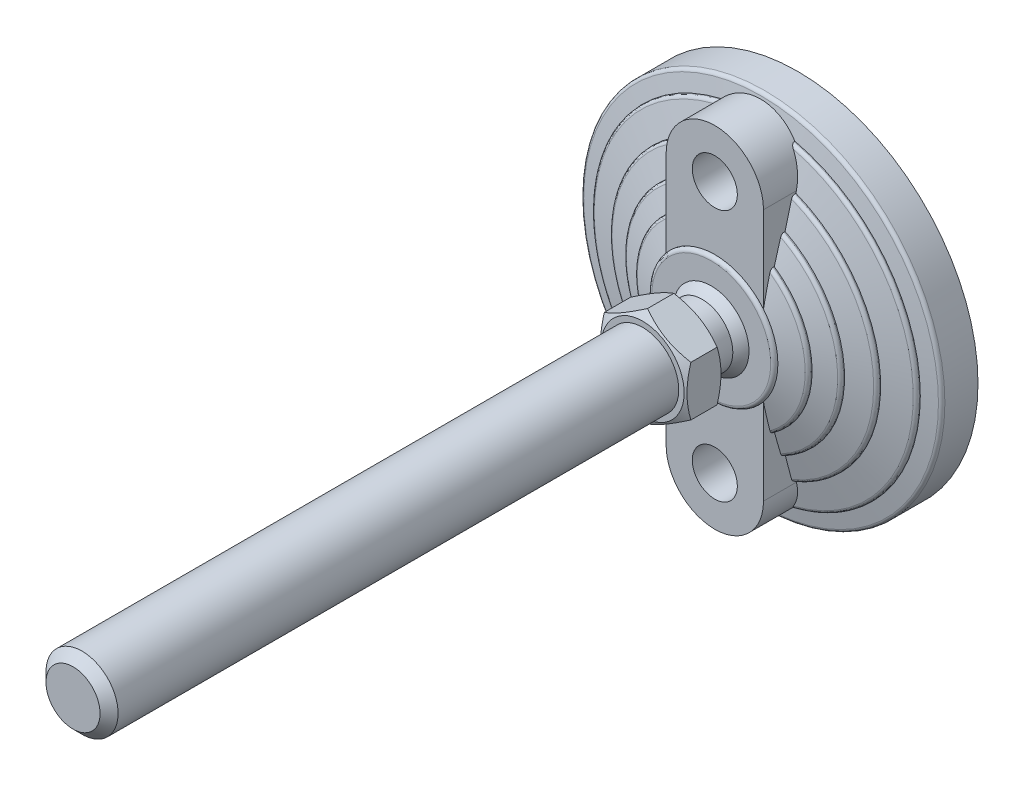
ISO-10303-21;
HEADER;
FILE_DESCRIPTION(('STEP AP214'),'2;1');
FILE_NAME('part.step','',(''),(''),'','','');
FILE_SCHEMA(('AUTOMOTIVE_DESIGN { 1 0 10303 214 1 1 1 1 }'));
ENDSEC;
DATA;
#1=APPLICATION_CONTEXT('core data for automotive mechanical design processes');
#2=APPLICATION_PROTOCOL_DEFINITION('international standard','automotive_design',2000,#1);
#3=PRODUCT_CONTEXT('',#1,'mechanical');
#4=PRODUCT('Part','Part','',(#3));
#5=PRODUCT_RELATED_PRODUCT_CATEGORY('part','',(#4));
#6=PRODUCT_DEFINITION_FORMATION('','',#4);
#7=PRODUCT_DEFINITION_CONTEXT('part definition',#1,'design');
#8=PRODUCT_DEFINITION('design','',#6,#7);
#9=PRODUCT_DEFINITION_SHAPE('','',#8);
#10=(LENGTH_UNIT() NAMED_UNIT(*) SI_UNIT(.MILLI.,.METRE.));
#11=(NAMED_UNIT(*) PLANE_ANGLE_UNIT() SI_UNIT($,.RADIAN.));
#12=(NAMED_UNIT(*) SI_UNIT($,.STERADIAN.) SOLID_ANGLE_UNIT());
#13=UNCERTAINTY_MEASURE_WITH_UNIT(LENGTH_MEASURE(1.E-05),#10,'distance_accuracy_value','');
#14=(GEOMETRIC_REPRESENTATION_CONTEXT(3) GLOBAL_UNCERTAINTY_ASSIGNED_CONTEXT((#13)) GLOBAL_UNIT_ASSIGNED_CONTEXT((#10,
#11,#12)) REPRESENTATION_CONTEXT('',''));
#15=CARTESIAN_POINT('',(0.,0.,0.));
#16=DIRECTION('',(0.,0.,1.));
#17=DIRECTION('',(1.,0.,0.));
#18=AXIS2_PLACEMENT_3D('',#15,#16,#17);
#19=CARTESIAN_POINT('',(-12.,14.022683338,33.));
#20=DIRECTION('',(0.,0.,1.));
#21=DIRECTION('',(0.,-1.,0.));
#22=AXIS2_PLACEMENT_3D('',#19,#20,#21);
#23=PLANE('',#22);
#24=CARTESIAN_POINT('',(0.,0.,33.));
#25=DIRECTION('',(0.,0.,-1.));
#26=DIRECTION('',(0.,1.,0.));
#27=AXIS2_PLACEMENT_3D('',#24,#25,#26);
#28=CIRCLE('',#27,11.5);
#29=CARTESIAN_POINT('',(0.,11.5,33.));
#30=VERTEX_POINT('',#29);
#31=EDGE_CURVE('E260',#30,#30,#28,.T.);
#32=ORIENTED_EDGE('',*,*,#31,.T.);
#33=EDGE_LOOP('',(#32));
#34=FACE_BOUND('',#33,.T.);
#35=CARTESIAN_POINT('',(0.,0.,33.));
#36=DIRECTION('',(0.,0.,-1.));
#37=DIRECTION('',(0.,1.,0.));
#38=AXIS2_PLACEMENT_3D('',#35,#36,#37);
#39=CIRCLE('',#38,8.5);
#40=CARTESIAN_POINT('',(0.,8.5,33.));
#41=VERTEX_POINT('',#40);
#42=EDGE_CURVE('E274',#41,#41,#39,.T.);
#43=ORIENTED_EDGE('',*,*,#42,.F.);
#44=EDGE_LOOP('',(#43));
#45=FACE_BOUND('',#44,.T.);
#46=ADVANCED_FACE('F14',(#34,#45),#23,.F.);
#47=CARTESIAN_POINT('',(0.,0.,33.));
#48=DIRECTION('',(0.,0.,-1.));
#49=DIRECTION('',(0.,1.,0.));
#50=AXIS2_PLACEMENT_3D('',#47,#48,#49);
#51=CYLINDRICAL_SURFACE('',#50,8.5);
#52=CARTESIAN_POINT('',(0.,0.,26.5));
#53=DIRECTION('',(0.,0.,-1.));
#54=DIRECTION('',(0.,1.,0.));
#55=AXIS2_PLACEMENT_3D('',#52,#53,#54);
#56=CIRCLE('',#55,8.5);
#57=CARTESIAN_POINT('',(0.,8.5,26.5));
#58=VERTEX_POINT('',#57);
#59=EDGE_CURVE('E1500',#58,#58,#56,.F.);
#60=ORIENTED_EDGE('',*,*,#59,.T.);
#61=EDGE_LOOP('',(#60));
#62=FACE_BOUND('',#61,.T.);
#63=ORIENTED_EDGE('',*,*,#42,.T.);
#64=EDGE_LOOP('',(#63));
#65=FACE_BOUND('',#64,.T.);
#66=ADVANCED_FACE('F944',(#62,#65),#51,.T.);
#67=CARTESIAN_POINT('',(-8.631599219,8.622532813,26.5));
#68=DIRECTION('',(0.,0.,1.));
#69=DIRECTION('',(0.,-1.,0.));
#70=AXIS2_PLACEMENT_3D('',#67,#68,#69);
#71=PLANE('',#70);
#72=CARTESIAN_POINT('',(0.,0.,26.5));
#73=DIRECTION('',(0.,0.,-1.));
#74=DIRECTION('',(0.,1.,0.));
#75=AXIS2_PLACEMENT_3D('',#72,#73,#74);
#76=CIRCLE('',#75,8.49107182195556);
#77=CARTESIAN_POINT('',(0.,8.49107182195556,26.5));
#78=VERTEX_POINT('',#77);
#79=EDGE_CURVE('E1498',#78,#78,#76,.T.);
#80=ORIENTED_EDGE('',*,*,#79,.F.);
#81=EDGE_LOOP('',(#80));
#82=FACE_BOUND('',#81,.T.);
#83=ORIENTED_EDGE('',*,*,#59,.F.);
#84=EDGE_LOOP('',(#83));
#85=FACE_BOUND('',#84,.T.);
#86=ADVANCED_FACE('F954',(#82,#85),#71,.F.);
#87=CARTESIAN_POINT('',(0.,0.,17.670266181));
#88=DIRECTION('',(0.,0.,-1.));
#89=DIRECTION('',(1.,0.,0.));
#90=AXIS2_PLACEMENT_3D('',#87,#88,#89);
#91=SPHERICAL_SURFACE('',#90,12.25);
#92=CARTESIAN_POINT('',(0.,0.,24.));
#93=DIRECTION('',(0.,0.,-1.));
#94=DIRECTION('',(0.,1.,0.));
#95=AXIS2_PLACEMENT_3D('',#92,#93,#94);
#96=CIRCLE('',#95,10.4879440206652);
#97=CARTESIAN_POINT('',(0.,10.4879440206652,24.));
#98=VERTEX_POINT('',#97);
#99=EDGE_CURVE('E1495',#98,#98,#96,.F.);
#100=ORIENTED_EDGE('',*,*,#99,.T.);
#101=EDGE_LOOP('',(#100));
#102=FACE_BOUND('',#101,.T.);
#103=ORIENTED_EDGE('',*,*,#79,.T.);
#104=EDGE_LOOP('',(#103));
#105=FACE_BOUND('',#104,.T.);
#106=ADVANCED_FACE('F964',(#102,#105),#91,.T.);
#107=CARTESIAN_POINT('',(0.,-35.,0.));
#108=DIRECTION('',(0.,0.,1.));
#109=DIRECTION('',(0.,-1.,0.));
#110=AXIS2_PLACEMENT_3D('',#107,#108,#109);
#111=CYLINDRICAL_SURFACE('',#110,6.25);
#112=CARTESIAN_POINT('',(0.,-35.,23.));
#113=DIRECTION('',(0.,0.,1.));
#114=DIRECTION('',(0.,-1.,0.));
#115=AXIS2_PLACEMENT_3D('',#112,#113,#114);
#116=CIRCLE('',#115,6.25);
#117=CARTESIAN_POINT('',(0.,-41.25,23.));
#118=VERTEX_POINT('',#117);
#119=EDGE_CURVE('E1169',#118,#118,#116,.F.);
#120=ORIENTED_EDGE('',*,*,#119,.F.);
#121=EDGE_LOOP('',(#120));
#122=FACE_BOUND('',#121,.T.);
#123=CARTESIAN_POINT('',(0.,-35.,0.));
#124=DIRECTION('',(0.,0.,1.));
#125=DIRECTION('',(0.,-1.,0.));
#126=AXIS2_PLACEMENT_3D('',#123,#124,#125);
#127=CIRCLE('',#126,6.25);
#128=CARTESIAN_POINT('',(0.,-41.25,0.));
#129=VERTEX_POINT('',#128);
#130=EDGE_CURVE('E1469',#129,#129,#127,.F.);
#131=ORIENTED_EDGE('',*,*,#130,.T.);
#132=EDGE_LOOP('',(#131));
#133=FACE_BOUND('',#132,.T.);
#134=ADVANCED_FACE('F978',(#122,#133),#111,.F.);
#135=CARTESIAN_POINT('',(-16.755457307,-16.698,24.));
#136=DIRECTION('',(0.,0.,-1.));
#137=DIRECTION('',(0.,1.,0.));
#138=AXIS2_PLACEMENT_3D('',#135,#136,#137);
#139=PLANE('',#138);
#140=ORIENTED_EDGE('',*,*,#99,.F.);
#141=EDGE_LOOP('',(#140));
#142=FACE_BOUND('',#141,.T.);
#143=CARTESIAN_POINT('',(0.,0.,24.));
#144=DIRECTION('',(0.,0.,-1.));
#145=DIRECTION('',(0.,1.,0.));
#146=AXIS2_PLACEMENT_3D('',#143,#144,#145);
#147=CIRCLE('',#146,16.5);
#148=CARTESIAN_POINT('',(0.,16.5,24.));
#149=VERTEX_POINT('',#148);
#150=EDGE_CURVE('E1166',#149,#149,#147,.T.);
#151=ORIENTED_EDGE('',*,*,#150,.F.);
#152=EDGE_LOOP('',(#151));
#153=FACE_BOUND('',#152,.T.);
#154=ADVANCED_FACE('F972',(#142,#153),#139,.F.);
#155=CARTESIAN_POINT('',(-50.774113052,50.6,0.));
#156=DIRECTION('',(0.,0.,1.));
#157=DIRECTION('',(0.,-1.,0.));
#158=AXIS2_PLACEMENT_3D('',#155,#156,#157);
#159=PLANE('',#158);
#160=CARTESIAN_POINT('',(0.,35.,0.));
#161=DIRECTION('',(0.,0.,1.));
#162=DIRECTION('',(0.,-1.,0.));
#163=AXIS2_PLACEMENT_3D('',#160,#161,#162);
#164=CIRCLE('',#163,6.25);
#165=CARTESIAN_POINT('',(0.,28.75,0.));
#166=VERTEX_POINT('',#165);
#167=EDGE_CURVE('E535',#166,#166,#164,.T.);
#168=ORIENTED_EDGE('',*,*,#167,.T.);
#169=EDGE_LOOP('',(#168));
#170=FACE_BOUND('',#169,.T.);
#171=ORIENTED_EDGE('',*,*,#130,.F.);
#172=EDGE_LOOP('',(#171));
#173=FACE_BOUND('',#172,.T.);
#174=CARTESIAN_POINT('',(0.,0.,0.));
#175=DIRECTION('',(0.,0.,-1.));
#176=DIRECTION('',(1.,0.,0.));
#177=AXIS2_PLACEMENT_3D('',#174,#175,#176);
#178=CIRCLE('',#177,50.);
#179=CARTESIAN_POINT('',(50.,0.,0.));
#180=VERTEX_POINT('',#179);
#181=EDGE_CURVE('E554',#180,#180,#178,.F.);
#182=ORIENTED_EDGE('',*,*,#181,.F.);
#183=EDGE_LOOP('',(#182));
#184=FACE_BOUND('',#183,.T.);
#185=ADVANCED_FACE('F977',(#170,#173,#184),#159,.F.);
#186=CARTESIAN_POINT('',(0.,0.,23.));
#187=DIRECTION('',(0.,0.,-1.));
#188=DIRECTION('',(0.,1.,0.));
#189=AXIS2_PLACEMENT_3D('',#186,#187,#188);
#190=CONICAL_SURFACE('',#189,17.5,1.27229739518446);
#191=CARTESIAN_POINT('',(0.,0.,23.));
#192=DIRECTION('',(0.,0.,1.));
#193=DIRECTION('',(0.,-1.,0.));
#194=AXIS2_PLACEMENT_3D('',#191,#192,#193);
#195=CIRCLE('',#194,17.5);
#196=CARTESIAN_POINT('',(13.5000000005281,-11.1355287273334,22.999999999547));
#197=VERTEX_POINT('',#196);
#198=CARTESIAN_POINT('',(13.5000000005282,11.1355287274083,22.9999999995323));
#199=VERTEX_POINT('',#198);
#200=EDGE_CURVE('E532',#197,#199,#195,.T.);
#201=ORIENTED_EDGE('',*,*,#200,.F.);
#202=CARTESIAN_POINT('',(13.5,-18.9832672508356,21.2172043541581));
#203=CARTESIAN_POINT('',(13.5,-18.6579649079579,21.2987714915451));
#204=CARTESIAN_POINT('',(13.5,-18.3324976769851,21.3796813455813));
#205=CARTESIAN_POINT('',(13.5,-17.6811977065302,21.5400241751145));
#206=CARTESIAN_POINT('',(13.5,-17.3553649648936,21.6194571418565));
#207=CARTESIAN_POINT('',(13.5,-16.3773825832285,21.8552688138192));
#208=CARTESIAN_POINT('',(13.5,-15.7246371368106,22.0091884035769));
#209=CARTESIAN_POINT('',(13.5,-14.4172126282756,22.3088363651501));
#210=CARTESIAN_POINT('',(13.5,-13.7625334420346,22.4545641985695));
#211=CARTESIAN_POINT('',(13.5,-12.7787974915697,22.6654071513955));
#212=CARTESIAN_POINT('',(13.5,-12.4505717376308,22.7344021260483));
#213=CARTESIAN_POINT('',(13.5,-11.7935144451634,22.8694734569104));
#214=CARTESIAN_POINT('',(13.5,-11.4646828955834,22.9355497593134));
#215=CARTESIAN_POINT('',(13.5,-11.1355287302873,22.999999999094));
#216=B_SPLINE_CURVE_WITH_KNOTS('',3,(#202,#203,#204,#205,#206,#207,#208,#209,#210,#211,#212,
#213,#214,#215),.UNSPECIFIED.,.F.,.F.,(4,2,2,2,2,2,4),(0.,1.00611699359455,2.01223994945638,
4.02414047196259,6.03617307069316,7.04235800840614,8.04856148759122),.UNSPECIFIED.);
#217=CARTESIAN_POINT('',(13.5,-18.9832672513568,21.2172043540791));
#218=VERTEX_POINT('',#217);
#219=EDGE_CURVE('E1217',#218,#197,#216,.T.);
#220=ORIENTED_EDGE('',*,*,#219,.F.);
#221=CARTESIAN_POINT('',(3.16437848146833E-10,0.,21.217204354));
#222=DIRECTION('',(0.,0.,-1.));
#223=DIRECTION('',(0.,1.,0.));
#224=AXIS2_PLACEMENT_3D('',#221,#222,#223);
#225=CIRCLE('',#224,23.2940858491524);
#226=CARTESIAN_POINT('',(13.5,18.983267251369,21.2172043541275));
#227=VERTEX_POINT('',#226);
#228=EDGE_CURVE('E565',#227,#218,#225,.T.);
#229=ORIENTED_EDGE('',*,*,#228,.F.);
#230=CARTESIAN_POINT('',(13.5,11.1355287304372,22.9999999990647));
#231=CARTESIAN_POINT('',(13.5,11.4646828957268,22.9355497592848));
#232=CARTESIAN_POINT('',(13.5,11.7935144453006,22.8694734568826));
#233=CARTESIAN_POINT('',(13.5,12.4505717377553,22.7344021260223));
#234=CARTESIAN_POINT('',(13.5,12.7787974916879,22.6654071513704));
#235=CARTESIAN_POINT('',(13.5,13.762533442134,22.4545641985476));
#236=CARTESIAN_POINT('',(13.5,14.4172126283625,22.3088363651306));
#237=CARTESIAN_POINT('',(13.5,15.7246371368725,22.0091884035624));
#238=CARTESIAN_POINT('',(13.5,16.377382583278,21.8552688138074));
#239=CARTESIAN_POINT('',(13.5,17.3553649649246,21.619457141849));
#240=CARTESIAN_POINT('',(13.5,17.681197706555,21.5400241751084));
#241=CARTESIAN_POINT('',(13.5,18.3324976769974,21.3796813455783));
#242=CARTESIAN_POINT('',(13.5,18.6579649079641,21.2987714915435));
#243=CARTESIAN_POINT('',(13.5,18.9832672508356,21.2172043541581));
#244=B_SPLINE_CURVE_WITH_KNOTS('',3,(#230,#231,#232,#233,#234,#235,#236,#237,#238,#239,#240,
#241,#242,#243),.UNSPECIFIED.,.F.,.F.,(4,2,2,2,2,2,4),(0.,1.00620347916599,2.01238841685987,
4.02442101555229,6.03632153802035,7.0424444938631,8.04856148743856),.UNSPECIFIED.);
#245=EDGE_CURVE('E1153',#199,#227,#244,.T.);
#246=ORIENTED_EDGE('',*,*,#245,.F.);
#247=EDGE_LOOP('',(#201,#220,#229,#246));
#248=FACE_BOUND('',#247,.T.);
#249=ADVANCED_FACE('F990',(#248),#190,.T.);
#250=CARTESIAN_POINT('',(13.267303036,19.999466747,20.261425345));
#251=CARTESIAN_POINT('',(29.097194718,9.49818825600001,20.261425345));
#252=CARTESIAN_POINT('',(29.097194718,-9.49818825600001,20.261425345));
#253=CARTESIAN_POINT('',(13.267303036,-19.999466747,20.261425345));
#254=CARTESIAN_POINT('',(13.267303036,19.999466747,20.716888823));
#255=CARTESIAN_POINT('',(29.097194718,9.498188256,20.716888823));
#256=CARTESIAN_POINT('',(29.097194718,-9.498188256,20.716888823));
#257=CARTESIAN_POINT('',(13.267303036,-19.999466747,20.716888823));
#258=CARTESIAN_POINT('',(13.117718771,19.773979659,21.083258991));
#259=CARTESIAN_POINT('',(28.769133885,9.39109946,21.083258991));
#260=CARTESIAN_POINT('',(28.769133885,-9.39109946,21.083258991));
#261=CARTESIAN_POINT('',(13.117718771,-19.773979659,21.083258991));
#262=CARTESIAN_POINT('',(12.877070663,19.411220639,21.217204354));
#263=CARTESIAN_POINT('',(28.241356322,9.218817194,21.217204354));
#264=CARTESIAN_POINT('',(28.241356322,-9.218817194,21.217204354));
#265=CARTESIAN_POINT('',(12.877070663,-19.411220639,21.217204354));
#266=(BOUNDED_SURFACE() B_SPLINE_SURFACE(3,3,((#250,#251,#252,#253),(#254,#255,#256,#257),(#258,
#259,#260,#261),(#262,#263,#264,#265)),.UNSPECIFIED.,.F.,.F.,
.F.) B_SPLINE_SURFACE_WITH_KNOTS((4,4),(4,4),(0.,1.),(0.,1.),
.UNSPECIFIED.) GEOMETRIC_REPRESENTATION_ITEM() RATIONAL_B_SPLINE_SURFACE(((1.,0.701869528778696,
0.701869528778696,1.),(0.869593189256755,0.610340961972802,0.610340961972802,0.869593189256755),
(0.869593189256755,0.610340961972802,0.610340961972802,0.869593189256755),(1.,0.701869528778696,
0.701869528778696,1.))) REPRESENTATION_ITEM('') SURFACE());
#267=CARTESIAN_POINT('',(13.5,-19.8431348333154,20.2614253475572));
#268=CARTESIAN_POINT('',(13.5,-19.8431370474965,20.2860556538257));
#269=CARTESIAN_POINT('',(13.5,-19.8420333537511,20.3106726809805));
#270=CARTESIAN_POINT('',(13.5,-19.8376465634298,20.3597018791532));
#271=CARTESIAN_POINT('',(13.5,-19.8343643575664,20.3841141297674));
#272=CARTESIAN_POINT('',(13.5,-19.8213486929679,20.4565201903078));
#273=CARTESIAN_POINT('',(13.5,-19.8084453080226,20.5039784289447));
#274=CARTESIAN_POINT('',(13.5,-19.7748969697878,20.5959548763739));
#275=CARTESIAN_POINT('',(13.5,-19.7542611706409,20.6404764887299));
#276=CARTESIAN_POINT('',(13.5,-19.7062220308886,20.7257350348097));
#277=CARTESIAN_POINT('',(13.5,-19.6788120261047,20.7664681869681));
#278=CARTESIAN_POINT('',(13.5,-19.6164784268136,20.8458096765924));
#279=CARTESIAN_POINT('',(13.5,-19.5811980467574,20.8841360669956));
#280=CARTESIAN_POINT('',(13.5,-19.5055204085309,20.9553392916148));
#281=CARTESIAN_POINT('',(13.5,-19.465120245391,20.9882130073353));
#282=CARTESIAN_POINT('',(13.5,-19.3733614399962,21.0532792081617));
#283=CARTESIAN_POINT('',(13.5,-19.321293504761,21.0844693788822));
#284=CARTESIAN_POINT('',(13.5,-19.2133323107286,21.139175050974));
#285=CARTESIAN_POINT('',(13.5,-19.1574401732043,21.1626927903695));
#286=CARTESIAN_POINT('',(13.5,-19.0617819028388,21.1957297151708));
#287=CARTESIAN_POINT('',(13.5,-19.022719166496,21.207311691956));
#288=CARTESIAN_POINT('',(13.5,-18.9832672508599,21.2172043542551));
#289=B_SPLINE_CURVE_WITH_KNOTS('',3,(#267,#268,#269,#270,#271,#272,#273,#274,#275,#276,#277,
#278,#279,#280,#281,#282,#283,#284,#285,#286,#287,#288),.UNSPECIFIED.,.F.,.F.,(4,2,2,2,2,2,2,2,
2,2,4),(0.,0.0738405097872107,0.147650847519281,0.29439860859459,0.440973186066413,
0.587692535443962,0.743377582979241,0.89915136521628,1.08055916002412,1.26191399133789,
1.38396481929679),.UNSPECIFIED.);
#290=CARTESIAN_POINT('',(13.5,-19.8431348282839,20.2614253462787));
#291=VERTEX_POINT('',#290);
#292=EDGE_CURVE('E1173',#291,#218,#289,.T.);
#293=CARTESIAN_POINT('',(0.,0.,20.261425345));
#294=DIRECTION('',(0.,0.,-1.));
#295=DIRECTION('',(0.,1.,0.));
#296=AXIS2_PLACEMENT_3D('',#293,#294,#295);
#297=CIRCLE('',#296,24.);
#298=CARTESIAN_POINT('',(13.5,19.8431348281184,20.2614253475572));
#299=VERTEX_POINT('',#298);
#300=EDGE_CURVE('E563',#299,#291,#297,.T.);
#301=CARTESIAN_POINT('',(13.5,18.9832672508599,21.2172043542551));
#302=CARTESIAN_POINT('',(13.5,19.0245269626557,21.2068474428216));
#303=CARTESIAN_POINT('',(13.5,19.0653049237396,21.1946763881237));
#304=CARTESIAN_POINT('',(13.5,19.1456358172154,21.1665827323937));
#305=CARTESIAN_POINT('',(13.5,19.1851861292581,21.1506526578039));
#306=CARTESIAN_POINT('',(13.5,19.3016874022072,21.0969581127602));
#307=CARTESIAN_POINT('',(13.5,19.3761277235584,21.0533765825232));
#308=CARTESIAN_POINT('',(13.5,19.4913457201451,20.9675664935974));
#309=CARTESIAN_POINT('',(13.5,19.5352290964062,20.9294496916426));
#310=CARTESIAN_POINT('',(13.5,19.6161219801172,20.8466003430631));
#311=CARTESIAN_POINT('',(13.5,19.6531483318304,20.801884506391));
#312=CARTESIAN_POINT('',(13.5,19.7189344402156,20.7060840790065));
#313=CARTESIAN_POINT('',(13.5,19.747615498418,20.6549449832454));
#314=CARTESIAN_POINT('',(13.5,19.7944064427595,20.5480322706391));
#315=CARTESIAN_POINT('',(13.5,19.8125331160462,20.4922661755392));
#316=CARTESIAN_POINT('',(13.5,19.8308153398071,20.4067306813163));
#317=CARTESIAN_POINT('',(13.5,19.8354249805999,20.3778585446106));
#318=CARTESIAN_POINT('',(13.5,19.8415861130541,20.3198066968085));
#319=CARTESIAN_POINT('',(13.5,19.8431393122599,20.2906271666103));
#320=CARTESIAN_POINT('',(13.5,19.8431348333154,20.2614253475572));
#321=B_SPLINE_CURVE_WITH_KNOTS('',3,(#301,#302,#303,#304,#305,#306,#307,#308,#309,#310,#311,
#312,#313,#314,#315,#316,#317,#318,#319,#320),.UNSPECIFIED.,.F.,.F.,(4,2,2,2,2,2,2,2,2,4),(0.,
0.12751650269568,0.255288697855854,0.511930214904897,0.685657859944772,0.858952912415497,
1.03383282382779,1.20843381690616,1.296004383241,1.38352601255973),.UNSPECIFIED.);
#322=EDGE_CURVE('E1156',#227,#299,#321,.T.);
#323=ORIENTED_EDGE('',*,*,#228,.T.);
#324=ORIENTED_EDGE('',*,*,#292,.F.);
#325=ORIENTED_EDGE('',*,*,#300,.F.);
#326=ORIENTED_EDGE('',*,*,#322,.F.);
#327=EDGE_LOOP('',(#323,#324,#325,#326));
#328=FACE_BOUND('',#327,.T.);
#329=ADVANCED_FACE('F1076',(#328),#266,.T.);
#330=CARTESIAN_POINT('',(0.,0.,20.261425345));
#331=DIRECTION('',(0.,0.,-1.));
#332=DIRECTION('',(0.,1.,0.));
#333=AXIS2_PLACEMENT_3D('',#330,#331,#332);
#334=CYLINDRICAL_SURFACE('',#333,24.);
#335=CARTESIAN_POINT('',(0.,0.,20.));
#336=DIRECTION('',(0.,0.,-1.));
#337=DIRECTION('',(0.,1.,0.));
#338=AXIS2_PLACEMENT_3D('',#335,#336,#337);
#339=CIRCLE('',#338,24.);
#340=CARTESIAN_POINT('',(13.5,19.8431348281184,20.));
#341=VERTEX_POINT('',#340);
#342=CARTESIAN_POINT('',(13.5,-19.8431348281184,20.0000000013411));
#343=VERTEX_POINT('',#342);
#344=EDGE_CURVE('E561',#341,#343,#339,.T.);
#345=ORIENTED_EDGE('',*,*,#344,.F.);
#346=DIRECTION('',(0.,0.,-1.));
#347=VECTOR('',#346,1.);
#348=CARTESIAN_POINT('',(13.5,19.8431348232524,18.4084486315));
#349=LINE('',#348,#347);
#350=EDGE_CURVE('E1275',#299,#341,#349,.T.);
#351=ORIENTED_EDGE('',*,*,#350,.F.);
#352=ORIENTED_EDGE('',*,*,#300,.T.);
#353=DIRECTION('',(0.,0.,1.));
#354=VECTOR('',#353,1.);
#355=CARTESIAN_POINT('',(13.5,-19.8431348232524,18.4084486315));
#356=LINE('',#355,#354);
#357=EDGE_CURVE('E1180',#343,#291,#356,.T.);
#358=ORIENTED_EDGE('',*,*,#357,.F.);
#359=EDGE_LOOP('',(#345,#351,#352,#358));
#360=FACE_BOUND('',#359,.T.);
#361=ADVANCED_FACE('F1040',(#360),#334,.T.);
#362=CARTESIAN_POINT('',(0.,0.,20.));
#363=DIRECTION('',(0.,0.,-1.));
#364=DIRECTION('',(1.,0.,0.));
#365=AXIS2_PLACEMENT_3D('',#362,#363,#364);
#366=CONICAL_SURFACE('',#365,24.,1.24904577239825);
#367=ORIENTED_EDGE('',*,*,#344,.T.);
#368=CARTESIAN_POINT('',(13.5,-26.022897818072,18.2279240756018));
#369=CARTESIAN_POINT('',(13.5,-25.5091656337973,18.3799212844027));
#370=CARTESIAN_POINT('',(13.5,-24.9951778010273,18.5310587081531));
#371=CARTESIAN_POINT('',(13.5,-23.9666187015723,18.8312926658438));
#372=CARTESIAN_POINT('',(13.5,-23.4520474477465,18.9803892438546));
#373=CARTESIAN_POINT('',(13.5,-22.4222240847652,19.2762276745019));
#374=CARTESIAN_POINT('',(13.5,-21.9069719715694,19.422969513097));
#375=CARTESIAN_POINT('',(13.5,-20.8756730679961,19.713675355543));
#376=CARTESIAN_POINT('',(13.5,-20.3596262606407,19.8576392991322));
#377=CARTESIAN_POINT('',(13.5,-19.8431348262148,20.0000000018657));
#378=B_SPLINE_CURVE_WITH_KNOTS('',3,(#368,#369,#370,#371,#372,#373,#374,#375,#376,#377),
.UNSPECIFIED.,.F.,.F.,(4,2,2,2,4),(0.,1.60723934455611,3.21444392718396,4.82165809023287,
6.42890708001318),.UNSPECIFIED.);
#379=CARTESIAN_POINT('',(13.5,-26.0228978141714,18.2279240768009));
#380=VERTEX_POINT('',#379);
#381=EDGE_CURVE('E1181',#380,#343,#378,.T.);
#382=ORIENTED_EDGE('',*,*,#381,.F.);
#383=CARTESIAN_POINT('',(-5.51340223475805E-10,0.,18.227924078));
#384=DIRECTION('',(0.,0.,-1.));
#385=DIRECTION('',(0.,1.,0.));
#386=AXIS2_PLACEMENT_3D('',#383,#384,#385);
#387=CIRCLE('',#386,29.3162277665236);
#388=CARTESIAN_POINT('',(13.5,26.0228978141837,18.2279240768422));
#389=VERTEX_POINT('',#388);
#390=EDGE_CURVE('E560',#389,#380,#387,.T.);
#391=ORIENTED_EDGE('',*,*,#390,.F.);
#392=CARTESIAN_POINT('',(13.5000000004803,19.8431348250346,20.0000000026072));
#393=CARTESIAN_POINT('',(13.5000000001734,20.3596262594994,19.8576392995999));
#394=CARTESIAN_POINT('',(13.5000000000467,20.8756730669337,19.7136753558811));
#395=CARTESIAN_POINT('',(13.4999999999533,21.9069719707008,19.4229695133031));
#396=CARTESIAN_POINT('',(13.4999999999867,22.4222240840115,19.2762276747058));
#397=CARTESIAN_POINT('',(13.5000000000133,23.4520474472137,18.9803892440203));
#398=CARTESIAN_POINT('',(13.5000000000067,23.9666187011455,18.8312926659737));
#399=CARTESIAN_POINT('',(13.4999999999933,24.9951778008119,18.5310587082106));
#400=CARTESIAN_POINT('',(13.4999999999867,25.5091656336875,18.3799212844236));
#401=CARTESIAN_POINT('',(13.5,26.022897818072,18.2279240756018));
#402=B_SPLINE_CURVE_WITH_KNOTS('',3,(#392,#393,#394,#395,#396,#397,#398,#399,#400,#401),
.UNSPECIFIED.,.F.,.F.,(4,2,2,2,4),(0.,1.60724899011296,3.2144631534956,4.82166773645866,
6.42890708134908),.UNSPECIFIED.);
#403=EDGE_CURVE('E1269',#341,#389,#402,.T.);
#404=ORIENTED_EDGE('',*,*,#403,.F.);
#405=EDGE_LOOP('',(#367,#382,#391,#404));
#406=FACE_BOUND('',#405,.T.);
#407=ADVANCED_FACE('F1034',(#406),#366,.T.);
#408=CARTESIAN_POINT('',(13.143890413,26.967353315,17.27924078));
#409=CARTESIAN_POINT('',(38.983891,14.372934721,17.27924078));
#410=CARTESIAN_POINT('',(38.983891,-14.372934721,17.27924078));
#411=CARTESIAN_POINT('',(13.143890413,-26.967353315,17.27924078));
#412=CARTESIAN_POINT('',(13.143890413,26.967353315,17.725161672));
#413=CARTESIAN_POINT('',(38.983891,14.372934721,17.725161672));
#414=CARTESIAN_POINT('',(38.983891,-14.372934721,17.725161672));
#415=CARTESIAN_POINT('',(13.143890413,-26.967353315,17.725161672));
#416=CARTESIAN_POINT('',(13.029654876,26.732975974,18.086911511));
#417=CARTESIAN_POINT('',(38.645076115,14.248017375,18.086911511));
#418=CARTESIAN_POINT('',(38.645076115,-14.248017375,18.086911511));
#419=CARTESIAN_POINT('',(13.029654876,-26.732975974,18.086911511));
#420=CARTESIAN_POINT('',(12.844309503,26.352702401,18.227924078));
#421=CARTESIAN_POINT('',(38.095354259,14.045340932,18.227924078));
#422=CARTESIAN_POINT('',(38.095354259,-14.045340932,18.227924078));
#423=CARTESIAN_POINT('',(12.844309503,-26.352702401,18.227924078));
#424=(BOUNDED_SURFACE() B_SPLINE_SURFACE(3,3,((#408,#409,#410,#411),(#412,#413,#414,#415),(#416,
#417,#418,#419),(#420,#421,#422,#423)),.UNSPECIFIED.,.F.,.F.,
.F.) B_SPLINE_SURFACE_WITH_KNOTS((4,4),(4,4),(0.,1.),(0.,1.),
.UNSPECIFIED.) GEOMETRIC_REPRESENTATION_ITEM() RATIONAL_B_SPLINE_SURFACE(((1.,0.625419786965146,
0.625419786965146,1.),(0.874161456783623,0.546717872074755,0.546717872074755,0.874161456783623),
(0.874161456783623,0.546717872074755,0.546717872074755,0.874161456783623),(1.,0.625419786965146,
0.625419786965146,1.))) REPRESENTATION_ITEM('') SURFACE());
#425=CARTESIAN_POINT('',(13.5,-26.7908566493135,17.2792407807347));
#426=CARTESIAN_POINT('',(13.5,-26.7908579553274,17.3051907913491));
#427=CARTESIAN_POINT('',(13.5,-26.7897247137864,17.3311275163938));
#428=CARTESIAN_POINT('',(13.5,-26.7852140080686,17.3827974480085));
#429=CARTESIAN_POINT('',(13.5,-26.781837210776,17.4085307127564));
#430=CARTESIAN_POINT('',(13.5,-26.7684139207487,17.4849772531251));
#431=CARTESIAN_POINT('',(13.5,-26.7550740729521,17.5351491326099));
#432=CARTESIAN_POINT('',(13.5,-26.7202107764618,17.632486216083));
#433=CARTESIAN_POINT('',(13.5,-26.6986916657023,17.6796529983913));
#434=CARTESIAN_POINT('',(13.5,-26.648348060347,17.7699105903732));
#435=CARTESIAN_POINT('',(13.5,-26.6195218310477,17.8130004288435));
#436=CARTESIAN_POINT('',(13.5,-26.5542840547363,17.8959059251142));
#437=CARTESIAN_POINT('',(13.5,-26.5176080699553,17.9355124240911));
#438=CARTESIAN_POINT('',(13.5,-26.4386436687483,18.0087234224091));
#439=CARTESIAN_POINT('',(13.5,-26.3963509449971,18.0423232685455));
#440=CARTESIAN_POINT('',(13.5,-26.3267001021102,18.0898793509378));
#441=CARTESIAN_POINT('',(13.5,-26.3008113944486,18.106038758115));
#442=CARTESIAN_POINT('',(13.5,-26.2478537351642,18.1362297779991));
#443=CARTESIAN_POINT('',(13.5,-26.2207861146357,18.1502637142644));
#444=CARTESIAN_POINT('',(13.5,-26.1657188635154,18.176151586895));
#445=CARTESIAN_POINT('',(13.5,-26.1377218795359,18.1880111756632));
#446=CARTESIAN_POINT('',(13.5,-26.0808891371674,18.2095853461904));
#447=CARTESIAN_POINT('',(13.5,-26.0520527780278,18.2192983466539));
#448=CARTESIAN_POINT('',(13.5,-26.0228978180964,18.2279240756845));
#449=B_SPLINE_CURVE_WITH_KNOTS('',3,(#425,#426,#427,#428,#429,#430,#431,#432,#433,#434,#435,
#436,#437,#438,#439,#440,#441,#442,#443,#444,#445,#446,#447,#448),.UNSPECIFIED.,.F.,.F.,(4,2,2,
2,2,2,2,2,2,2,2,4),(0.,0.0777993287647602,0.155575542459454,0.310500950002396,0.465344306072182,
0.620224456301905,0.781511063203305,0.942922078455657,1.03439248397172,1.12576216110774,
1.21689083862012,1.30808642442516),.UNSPECIFIED.);
#450=CARTESIAN_POINT('',(13.5,-26.7908566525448,17.27924078));
#451=VERTEX_POINT('',#450);
#452=EDGE_CURVE('E1198',#451,#380,#449,.T.);
#453=CARTESIAN_POINT('',(0.,0.,17.27924078));
#454=DIRECTION('',(0.,0.,-1.));
#455=DIRECTION('',(0.,1.,0.));
#456=AXIS2_PLACEMENT_3D('',#453,#454,#455);
#457=CIRCLE('',#456,30.);
#458=CARTESIAN_POINT('',(13.5,26.7908566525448,17.2792407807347));
#459=VERTEX_POINT('',#458);
#460=EDGE_CURVE('E558',#459,#451,#457,.T.);
#461=CARTESIAN_POINT('',(13.5,26.0228978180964,18.2279240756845));
#462=CARTESIAN_POINT('',(13.5,26.0845570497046,18.2097134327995));
#463=CARTESIAN_POINT('',(13.5,26.1448460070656,18.1865640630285));
#464=CARTESIAN_POINT('',(13.5,26.2611194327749,18.1305926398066));
#465=CARTESIAN_POINT('',(13.5,26.3170802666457,18.0977216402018));
#466=CARTESIAN_POINT('',(13.5,26.422621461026,18.022592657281));
#467=CARTESIAN_POINT('',(13.5,26.4721821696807,17.9803067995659));
#468=CARTESIAN_POINT('',(13.5,26.5625156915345,17.887307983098));
#469=CARTESIAN_POINT('',(13.5,26.6033065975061,17.8366127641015));
#470=CARTESIAN_POINT('',(13.5,26.6708532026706,17.7331354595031));
#471=CARTESIAN_POINT('',(13.5,26.6985518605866,17.68096918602));
#472=CARTESIAN_POINT('',(13.5,26.743619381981,17.5723560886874));
#473=CARTESIAN_POINT('',(13.5,26.7610021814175,17.5159151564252));
#474=CARTESIAN_POINT('',(13.5,26.7787549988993,17.4289072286));
#475=CARTESIAN_POINT('',(13.5,26.7832876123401,17.399138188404));
#476=CARTESIAN_POINT('',(13.5,26.78933789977,17.3393328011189));
#477=CARTESIAN_POINT('',(13.5,26.7908592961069,17.3092968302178));
#478=CARTESIAN_POINT('',(13.5,26.7908566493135,17.2792407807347));
#479=B_SPLINE_CURVE_WITH_KNOTS('',3,(#461,#462,#463,#464,#465,#466,#467,#468,#469,#470,#471,
#472,#473,#474,#475,#476,#477,#478),.UNSPECIFIED.,.F.,.F.,(4,2,2,2,2,2,2,2,4),(0.,
0.192810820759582,0.386609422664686,0.580989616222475,0.774964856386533,0.951184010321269,
1.12716456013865,1.21736691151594,1.30745768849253),.UNSPECIFIED.);
#480=EDGE_CURVE('E1264',#389,#459,#479,.T.);
#481=ORIENTED_EDGE('',*,*,#390,.T.);
#482=ORIENTED_EDGE('',*,*,#452,.F.);
#483=ORIENTED_EDGE('',*,*,#460,.F.);
#484=ORIENTED_EDGE('',*,*,#480,.F.);
#485=EDGE_LOOP('',(#481,#482,#483,#484));
#486=FACE_BOUND('',#485,.T.);
#487=ADVANCED_FACE('F1039',(#486),#424,.T.);
#488=CARTESIAN_POINT('',(0.,0.,17.27924078));
#489=DIRECTION('',(0.,0.,-1.));
#490=DIRECTION('',(0.,1.,0.));
#491=AXIS2_PLACEMENT_3D('',#488,#489,#490);
#492=CYLINDRICAL_SURFACE('',#491,30.);
#493=CARTESIAN_POINT('',(0.,0.,17.));
#494=DIRECTION('',(0.,0.,-1.));
#495=DIRECTION('',(0.,1.,0.));
#496=AXIS2_PLACEMENT_3D('',#493,#494,#495);
#497=CIRCLE('',#496,30.);
#498=CARTESIAN_POINT('',(13.5,26.7908566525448,17.));
#499=VERTEX_POINT('',#498);
#500=CARTESIAN_POINT('',(13.5,-26.7908566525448,16.9999999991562));
#501=VERTEX_POINT('',#500);
#502=EDGE_CURVE('E556',#499,#501,#497,.T.);
#503=ORIENTED_EDGE('',*,*,#502,.F.);
#504=DIRECTION('',(0.,0.,-1.));
#505=VECTOR('',#504,1.);
#506=CARTESIAN_POINT('',(13.5,26.7908566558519,18.4084486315));
#507=LINE('',#506,#505);
#508=EDGE_CURVE('E1290',#459,#499,#507,.T.);
#509=ORIENTED_EDGE('',*,*,#508,.F.);
#510=ORIENTED_EDGE('',*,*,#460,.T.);
#511=DIRECTION('',(0.,0.,1.));
#512=VECTOR('',#511,1.);
#513=CARTESIAN_POINT('',(13.5,-26.7908566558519,18.4084486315));
#514=LINE('',#513,#512);
#515=EDGE_CURVE('E1483',#501,#451,#514,.T.);
#516=ORIENTED_EDGE('',*,*,#515,.F.);
#517=EDGE_LOOP('',(#503,#509,#510,#516));
#518=FACE_BOUND('',#517,.T.);
#519=ADVANCED_FACE('F1052',(#518),#492,.T.);
#520=CARTESIAN_POINT('',(0.,0.,17.));
#521=DIRECTION('',(0.,0.,-1.));
#522=DIRECTION('',(0.,1.,0.));
#523=AXIS2_PLACEMENT_3D('',#520,#521,#522);
#524=CONICAL_SURFACE('',#523,30.,1.29249666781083);
#525=ORIENTED_EDGE('',*,*,#502,.T.);
#526=CARTESIAN_POINT('',(13.5000000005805,-33.6690568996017,15.2072225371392));
#527=CARTESIAN_POINT('',(13.5000000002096,-33.0965095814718,15.3590521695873));
#528=CARTESIAN_POINT('',(13.5000000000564,-32.5238313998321,15.5103895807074));
#529=CARTESIAN_POINT('',(13.4999999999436,-31.3781752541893,15.8119124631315));
#530=CARTESIAN_POINT('',(13.4999999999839,-30.8051972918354,15.9620979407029));
#531=CARTESIAN_POINT('',(13.5000000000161,-29.6588964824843,16.2611513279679));
#532=CARTESIAN_POINT('',(13.5000000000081,-29.0855736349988,16.4100192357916));
#533=CARTESIAN_POINT('',(13.4999999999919,-27.9385277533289,16.7062178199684));
#534=CARTESIAN_POINT('',(13.4999999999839,-27.3648047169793,16.8535484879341));
#535=CARTESIAN_POINT('',(13.5,-26.7908566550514,16.9999999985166));
#536=B_SPLINE_CURVE_WITH_KNOTS('',3,(#526,#527,#528,#529,#530,#531,#532,#533,#534,#535),
.UNSPECIFIED.,.F.,.F.,(4,2,2,2,4),(0.,1.7770100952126,3.55401051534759,5.33101345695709,
7.10802608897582),.UNSPECIFIED.);
#537=CARTESIAN_POINT('',(13.5,-33.6690569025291,15.2072225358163));
#538=VERTEX_POINT('',#537);
#539=EDGE_CURVE('E1204',#538,#501,#536,.T.);
#540=ORIENTED_EDGE('',*,*,#539,.F.);
#541=CARTESIAN_POINT('',(3.08438170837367E-10,0.,15.207222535));
#542=DIRECTION('',(0.,0.,-1.));
#543=DIRECTION('',(1.,0.,0.));
#544=AXIS2_PLACEMENT_3D('',#541,#542,#543);
#545=CIRCLE('',#544,36.2747211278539);
#546=CARTESIAN_POINT('',(13.5,33.6690569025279,15.2072225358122));
#547=VERTEX_POINT('',#546);
#548=EDGE_CURVE('E555',#547,#538,#545,.T.);
#549=ORIENTED_EDGE('',*,*,#548,.F.);
#550=CARTESIAN_POINT('',(13.5000000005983,26.790856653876,16.9999999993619));
#551=CARTESIAN_POINT('',(13.5000000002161,27.3648047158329,16.85354848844));
#552=CARTESIAN_POINT('',(13.5000000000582,27.9385277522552,16.7062178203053));
#553=CARTESIAN_POINT('',(13.4999999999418,29.0855736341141,16.4100192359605));
#554=CARTESIAN_POINT('',(13.4999999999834,29.6588964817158,16.2611513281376));
#555=CARTESIAN_POINT('',(13.5000000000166,30.8051972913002,15.9620979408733));
#556=CARTESIAN_POINT('',(13.5000000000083,31.378175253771,15.8119124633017));
#557=CARTESIAN_POINT('',(13.4999999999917,32.523831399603,15.5103895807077));
#558=CARTESIAN_POINT('',(13.4999999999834,33.0965095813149,15.359052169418));
#559=CARTESIAN_POINT('',(13.5,33.6690568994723,15.2072225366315));
#560=B_SPLINE_CURVE_WITH_KNOTS('',3,(#550,#551,#552,#553,#554,#555,#556,#557,#558,#559),
.UNSPECIFIED.,.F.,.F.,(4,2,2,2,4),(0.,1.77701263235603,3.55401557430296,5.3310159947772,
7.10802609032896),.UNSPECIFIED.);
#561=EDGE_CURVE('E1242',#499,#547,#560,.T.);
#562=ORIENTED_EDGE('',*,*,#561,.F.);
#563=EDGE_LOOP('',(#525,#540,#549,#562));
#564=FACE_BOUND('',#563,.T.);
#565=ADVANCED_FACE('F1018',(#564),#524,.T.);
#566=CARTESIAN_POINT('',(13.003667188,34.639639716,14.245698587));
#567=CARTESIAN_POINT('',(51.0914438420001,20.341547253,14.245698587));
#568=CARTESIAN_POINT('',(51.0914438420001,-20.341547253,14.245698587));
#569=CARTESIAN_POINT('',(13.003667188,-34.639639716,14.245698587));
#570=CARTESIAN_POINT('',(13.003667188,34.639639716,14.709515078));
#571=CARTESIAN_POINT('',(51.091443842,20.341547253,14.709515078));
#572=CARTESIAN_POINT('',(51.091443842,-20.341547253,14.709515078));
#573=CARTESIAN_POINT('',(13.003667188,-34.639639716,14.709515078));
#574=CARTESIAN_POINT('',(12.905504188,34.378149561,15.079802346));
#575=CARTESIAN_POINT('',(50.705761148,20.187991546,15.079802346));
#576=CARTESIAN_POINT('',(50.705761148,-20.187991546,15.079802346));
#577=CARTESIAN_POINT('',(12.905504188,-34.378149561,15.079802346));
#578=CARTESIAN_POINT('',(12.748767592,33.960628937,15.207222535));
#579=CARTESIAN_POINT('',(50.089942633,19.942809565,15.207222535));
#580=CARTESIAN_POINT('',(50.089942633,-19.942809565,15.207222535));
#581=CARTESIAN_POINT('',(12.748767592,-33.960628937,15.207222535));
#582=(BOUNDED_SURFACE() B_SPLINE_SURFACE(3,3,((#566,#567,#568,#569),(#570,#571,#572,#573),(#574,
#575,#576,#577),(#578,#579,#580,#581)),.UNSPECIFIED.,.F.,.F.,
.F.) B_SPLINE_SURFACE_WITH_KNOTS((4,4),(4,4),(0.,1.),(0.,1.),
.UNSPECIFIED.) GEOMETRIC_REPRESENTATION_ITEM() RATIONAL_B_SPLINE_SURFACE(((1.,0.56763364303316,
0.56763364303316,1.),(0.865565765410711,0.491324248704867,0.491324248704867,0.865565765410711),
(0.865565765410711,0.491324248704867,0.491324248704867,0.865565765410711),(1.,0.56763364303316,
0.56763364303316,1.))) REPRESENTATION_ITEM('') SURFACE());
#583=CARTESIAN_POINT('',(13.5,-34.4492380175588,14.2456985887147));
#584=CARTESIAN_POINT('',(13.5,-34.4492388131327,14.2724185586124));
#585=CARTESIAN_POINT('',(13.5,-34.4480869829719,14.2991252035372));
#586=CARTESIAN_POINT('',(13.5,-34.4434985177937,14.3523366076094));
#587=CARTESIAN_POINT('',(13.5,-34.4400623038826,14.3788414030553));
#588=CARTESIAN_POINT('',(13.5,-34.42638545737,14.457641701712));
#589=CARTESIAN_POINT('',(13.5,-34.4127763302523,14.5093910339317));
#590=CARTESIAN_POINT('',(13.5,-34.3771048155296,14.6098360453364));
#591=CARTESIAN_POINT('',(13.5,-34.3550440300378,14.6585323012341));
#592=CARTESIAN_POINT('',(13.5,-34.3032810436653,14.7516688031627));
#593=CARTESIAN_POINT('',(13.5,-34.2735788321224,14.7961090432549));
#594=CARTESIAN_POINT('',(13.5,-34.2066078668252,14.8808807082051));
#595=CARTESIAN_POINT('',(13.5,-34.1691521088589,14.9210639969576));
#596=CARTESIAN_POINT('',(13.5,-34.0883643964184,14.9950807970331));
#597=CARTESIAN_POINT('',(13.5,-34.045025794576,15.0289070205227));
#598=CARTESIAN_POINT('',(13.5,-33.9488589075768,15.0927883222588));
#599=CARTESIAN_POINT('',(13.5,-33.8955116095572,15.1220613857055));
#600=CARTESIAN_POINT('',(13.5,-33.7848588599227,15.1715344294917));
#601=CARTESIAN_POINT('',(13.5,-33.727559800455,15.1917486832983));
#602=CARTESIAN_POINT('',(13.5,-33.6690568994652,15.2072225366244));
#603=B_SPLINE_CURVE_WITH_KNOTS('',3,(#583,#584,#585,#586,#587,#588,#589,#590,#591,#592,#593,
#594,#595,#596,#597,#598,#599,#600,#601,#602),.UNSPECIFIED.,.F.,.F.,(4,2,2,2,2,2,2,2,2,4),(0.,
0.0801088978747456,0.160203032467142,0.319894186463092,0.479555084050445,0.639216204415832,
0.803305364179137,0.967581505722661,1.14930395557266,1.33073905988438),.UNSPECIFIED.);
#604=CARTESIAN_POINT('',(13.5,-34.4492380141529,14.2456985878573));
#605=VERTEX_POINT('',#604);
#606=EDGE_CURVE('E1210',#605,#538,#603,.T.);
#607=CARTESIAN_POINT('',(0.,0.,14.245698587));
#608=DIRECTION('',(0.,0.,-1.));
#609=DIRECTION('',(0.,1.,0.));
#610=AXIS2_PLACEMENT_3D('',#607,#608,#609);
#611=CIRCLE('',#610,37.);
#612=CARTESIAN_POINT('',(13.5,34.4492380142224,14.2456985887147));
#613=VERTEX_POINT('',#612);
#614=EDGE_CURVE('E552',#613,#605,#611,.T.);
#615=CARTESIAN_POINT('',(13.5,33.6690568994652,15.2072225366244));
#616=CARTESIAN_POINT('',(13.5,33.7285004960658,15.1914984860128));
#617=CARTESIAN_POINT('',(13.5,33.7866931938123,15.1708859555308));
#618=CARTESIAN_POINT('',(13.5,33.8990439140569,15.1203027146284));
#619=CARTESIAN_POINT('',(13.5,33.9531903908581,15.09030640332));
#620=CARTESIAN_POINT('',(13.5,34.0556677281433,15.0214004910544));
#621=CARTESIAN_POINT('',(13.5,34.1039872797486,14.9824739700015));
#622=CARTESIAN_POINT('',(13.5,34.192879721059,14.8966704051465));
#623=CARTESIAN_POINT('',(13.5,34.2334627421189,14.8498039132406));
#624=CARTESIAN_POINT('',(13.5,34.3033335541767,14.7520897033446));
#625=CARTESIAN_POINT('',(13.5,34.3331130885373,14.7015938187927));
#626=CARTESIAN_POINT('',(13.5,34.3830581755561,14.5960457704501));
#627=CARTESIAN_POINT('',(13.5,34.4032299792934,14.5409965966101));
#628=CARTESIAN_POINT('',(13.5,34.4284319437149,14.4456451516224));
#629=CARTESIAN_POINT('',(13.5,34.4362159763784,14.4060504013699));
#630=CARTESIAN_POINT('',(13.5,34.4466250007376,14.3262117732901));
#631=CARTESIAN_POINT('',(13.5,34.4492528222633,14.2859682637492));
#632=CARTESIAN_POINT('',(13.5,34.4492380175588,14.2456985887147));
#633=B_SPLINE_CURVE_WITH_KNOTS('',3,(#615,#616,#617,#618,#619,#620,#621,#622,#623,#624,#625,
#626,#627,#628,#629,#630,#631,#632),.UNSPECIFIED.,.F.,.F.,(4,2,2,2,2,2,2,2,4),(0.,
0.184329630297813,0.369166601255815,0.554356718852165,0.739302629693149,0.914257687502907,
1.08909875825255,1.2098399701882,1.33051489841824),.UNSPECIFIED.);
#634=EDGE_CURVE('E1234',#547,#613,#633,.T.);
#635=ORIENTED_EDGE('',*,*,#548,.T.);
#636=ORIENTED_EDGE('',*,*,#606,.F.);
#637=ORIENTED_EDGE('',*,*,#614,.F.);
#638=ORIENTED_EDGE('',*,*,#634,.F.);
#639=EDGE_LOOP('',(#635,#636,#637,#638));
#640=FACE_BOUND('',#639,.T.);
#641=ADVANCED_FACE('F1013',(#640),#582,.T.);
#642=CARTESIAN_POINT('',(0.,0.,14.245698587));
#643=DIRECTION('',(0.,0.,-1.));
#644=DIRECTION('',(1.,0.,0.));
#645=AXIS2_PLACEMENT_3D('',#642,#643,#644);
#646=CYLINDRICAL_SURFACE('',#645,37.);
#647=CARTESIAN_POINT('',(0.,0.,14.));
#648=DIRECTION('',(0.,0.,-1.));
#649=DIRECTION('',(0.,1.,0.));
#650=AXIS2_PLACEMENT_3D('',#647,#648,#649);
#651=CIRCLE('',#650,37.);
#652=CARTESIAN_POINT('',(13.5,34.4492380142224,14.000000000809));
#653=VERTEX_POINT('',#652);
#654=CARTESIAN_POINT('',(13.5,-34.4492380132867,14.0000000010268));
#655=VERTEX_POINT('',#654);
#656=EDGE_CURVE('E548',#653,#655,#651,.T.);
#657=ORIENTED_EDGE('',*,*,#656,.F.);
#658=DIRECTION('',(0.,0.,-1.));
#659=VECTOR('',#658,1.);
#660=CARTESIAN_POINT('',(13.5,34.4492380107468,18.4084486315));
#661=LINE('',#660,#659);
#662=EDGE_CURVE('E1241',#613,#653,#661,.T.);
#663=ORIENTED_EDGE('',*,*,#662,.F.);
#664=ORIENTED_EDGE('',*,*,#614,.T.);
#665=DIRECTION('',(0.,0.,1.));
#666=VECTOR('',#665,1.);
#667=CARTESIAN_POINT('',(13.5,-34.4492380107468,18.4084486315));
#668=LINE('',#667,#666);
#669=EDGE_CURVE('E1216',#655,#605,#668,.T.);
#670=ORIENTED_EDGE('',*,*,#669,.F.);
#671=EDGE_LOOP('',(#657,#663,#664,#670));
#672=FACE_BOUND('',#671,.T.);
#673=ADVANCED_FACE('F1017',(#672),#646,.T.);
#674=CARTESIAN_POINT('',(0.,0.,9.180196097));
#675=DIRECTION('',(0.,0.,-1.));
#676=DIRECTION('',(1.,0.,0.));
#677=AXIS2_PLACEMENT_3D('',#674,#675,#676);
#678=CYLINDRICAL_SURFACE('',#677,50.);
#679=CARTESIAN_POINT('',(0.,0.,9.180196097));
#680=DIRECTION('',(0.,0.,1.));
#681=DIRECTION('',(0.,-1.,0.));
#682=AXIS2_PLACEMENT_3D('',#679,#680,#681);
#683=CIRCLE('',#682,50.);
#684=CARTESIAN_POINT('',(0.,-50.,9.180196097));
#685=VERTEX_POINT('',#684);
#686=EDGE_CURVE('E371',#685,#685,#683,.T.);
#687=ORIENTED_EDGE('',*,*,#686,.F.);
#688=EDGE_LOOP('',(#687));
#689=FACE_BOUND('',#688,.T.);
#690=ORIENTED_EDGE('',*,*,#181,.T.);
#691=EDGE_LOOP('',(#690));
#692=FACE_BOUND('',#691,.T.);
#693=ADVANCED_FACE('F1004',(#689,#692),#678,.T.);
#694=CARTESIAN_POINT('',(13.5,-35.,13.816897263));
#695=DIRECTION('',(1.,0.,0.));
#696=DIRECTION('',(0.,1.,0.));
#697=AXIS2_PLACEMENT_3D('',#694,#695,#696);
#698=PLANE('',#697);
#699=ORIENTED_EDGE('',*,*,#357,.T.);
#700=ORIENTED_EDGE('',*,*,#292,.T.);
#701=ORIENTED_EDGE('',*,*,#219,.T.);
#702=DIRECTION('',(0.,1.,0.));
#703=VECTOR('',#702,1.);
#704=CARTESIAN_POINT('',(13.5,-29.840990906,23.));
#705=LINE('',#704,#703);
#706=CARTESIAN_POINT('',(13.5,-35.0000000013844,23.));
#707=VERTEX_POINT('',#706);
#708=EDGE_CURVE('E1172',#707,#197,#705,.T.);
#709=ORIENTED_EDGE('',*,*,#708,.F.);
#710=DIRECTION('',(0.,0.,1.));
#711=VECTOR('',#710,1.);
#712=CARTESIAN_POINT('',(13.5,-35.0000000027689,16.6119));
#713=LINE('',#712,#711);
#714=CARTESIAN_POINT('',(13.5,-34.9999999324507,13.8716672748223));
#715=VERTEX_POINT('',#714);
#716=EDGE_CURVE('E370',#715,#707,#713,.T.);
#717=ORIENTED_EDGE('',*,*,#716,.F.);
#718=CARTESIAN_POINT('',(13.4999999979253,-34.4492380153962,13.9999999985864));
#719=CARTESIAN_POINT('',(13.4999999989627,-34.5410365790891,13.9786323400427));
#720=CARTESIAN_POINT('',(13.4999999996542,-34.632832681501,13.9572541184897));
#721=CARTESIAN_POINT('',(13.5000000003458,-34.8164199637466,13.9144765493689));
#722=CARTESIAN_POINT('',(13.5000000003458,-34.9082111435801,13.8930772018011));
#723=CARTESIAN_POINT('',(13.5,-34.9999998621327,13.871667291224));
#724=B_SPLINE_CURVE_WITH_KNOTS('',3,(#718,#719,#720,#721,#722,#723),.UNSPECIFIED.,.F.,.F.,(4,2,
4),(0.,0.282757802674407,0.565515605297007),.UNSPECIFIED.);
#725=EDGE_CURVE('E353',#655,#715,#724,.T.);
#726=ORIENTED_EDGE('',*,*,#725,.F.);
#727=ORIENTED_EDGE('',*,*,#669,.T.);
#728=ORIENTED_EDGE('',*,*,#606,.T.);
#729=ORIENTED_EDGE('',*,*,#539,.T.);
#730=ORIENTED_EDGE('',*,*,#515,.T.);
#731=ORIENTED_EDGE('',*,*,#452,.T.);
#732=ORIENTED_EDGE('',*,*,#381,.T.);
#733=EDGE_LOOP('',(#699,#700,#701,#709,#717,#726,#727,#728,#729,#730,#731,#732));
#734=FACE_BOUND('',#733,.T.);
#735=ADVANCED_FACE('F998',(#734),#698,.T.);
#736=CARTESIAN_POINT('',(-13.5,-10.911063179,23.));
#737=DIRECTION('',(0.,0.,1.));
#738=DIRECTION('',(0.,-1.,0.));
#739=AXIS2_PLACEMENT_3D('',#736,#737,#738);
#740=PLANE('',#739);
#741=ORIENTED_EDGE('',*,*,#119,.T.);
#742=EDGE_LOOP('',(#741));
#743=FACE_BOUND('',#742,.T.);
#744=CARTESIAN_POINT('',(0.,-35.,23.));
#745=DIRECTION('',(0.,0.,-1.));
#746=DIRECTION('',(0.,1.,0.));
#747=AXIS2_PLACEMENT_3D('',#744,#745,#746);
#748=CIRCLE('',#747,13.5);
#749=CARTESIAN_POINT('',(-13.5,-35.,23.));
#750=VERTEX_POINT('',#749);
#751=EDGE_CURVE('E372',#707,#750,#748,.T.);
#752=ORIENTED_EDGE('',*,*,#751,.F.);
#753=ORIENTED_EDGE('',*,*,#708,.T.);
#754=CARTESIAN_POINT('',(0.,0.,23.));
#755=DIRECTION('',(0.,0.,-1.));
#756=DIRECTION('',(0.,1.,0.));
#757=AXIS2_PLACEMENT_3D('',#754,#755,#756);
#758=CIRCLE('',#757,17.5);
#759=CARTESIAN_POINT('',(-13.4999999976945,-11.1355287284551,23.));
#760=VERTEX_POINT('',#759);
#761=EDGE_CURVE('E536',#760,#197,#758,.F.);
#762=ORIENTED_EDGE('',*,*,#761,.F.);
#763=DIRECTION('',(0.,1.,0.));
#764=VECTOR('',#763,1.);
#765=CARTESIAN_POINT('',(-13.5,-22.996170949,23.));
#766=LINE('',#765,#764);
#767=EDGE_CURVE('E517',#750,#760,#766,.T.);
#768=ORIENTED_EDGE('',*,*,#767,.F.);
#769=EDGE_LOOP('',(#752,#753,#762,#768));
#770=FACE_BOUND('',#769,.T.);
#771=ADVANCED_FACE('F1003',(#743,#770),#740,.T.);
#772=CARTESIAN_POINT('',(0.,0.,23.));
#773=DIRECTION('',(0.,0.,-1.));
#774=DIRECTION('',(0.,1.,0.));
#775=AXIS2_PLACEMENT_3D('',#772,#773,#774);
#776=TOROIDAL_SURFACE('',#775,16.5,1.);
#777=CARTESIAN_POINT('',(0.,0.,23.));
#778=DIRECTION('',(0.,0.,-1.));
#779=DIRECTION('',(0.,1.,0.));
#780=AXIS2_PLACEMENT_3D('',#777,#778,#779);
#781=CIRCLE('',#780,17.5);
#782=CARTESIAN_POINT('',(-13.4999999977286,11.1355287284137,23.));
#783=VERTEX_POINT('',#782);
#784=EDGE_CURVE('E508',#760,#783,#781,.T.);
#785=ORIENTED_EDGE('',*,*,#784,.F.);
#786=ORIENTED_EDGE('',*,*,#761,.T.);
#787=ORIENTED_EDGE('',*,*,#200,.T.);
#788=CARTESIAN_POINT('',(0.,0.,23.));
#789=DIRECTION('',(0.,0.,-1.));
#790=DIRECTION('',(0.,1.,0.));
#791=AXIS2_PLACEMENT_3D('',#788,#789,#790);
#792=CIRCLE('',#791,17.5);
#793=EDGE_CURVE('E1423',#783,#199,#792,.T.);
#794=ORIENTED_EDGE('',*,*,#793,.F.);
#795=EDGE_LOOP('',(#785,#786,#787,#794));
#796=FACE_BOUND('',#795,.T.);
#797=ORIENTED_EDGE('',*,*,#150,.T.);
#798=EDGE_LOOP('',(#797));
#799=FACE_BOUND('',#798,.T.);
#800=ADVANCED_FACE('F1127',(#796,#799),#776,.T.);
#801=CARTESIAN_POINT('',(0.,35.,0.));
#802=DIRECTION('',(0.,0.,1.));
#803=DIRECTION('',(0.,-1.,0.));
#804=AXIS2_PLACEMENT_3D('',#801,#802,#803);
#805=CYLINDRICAL_SURFACE('',#804,6.25);
#806=CARTESIAN_POINT('',(0.,35.,23.));
#807=DIRECTION('',(0.,0.,1.));
#808=DIRECTION('',(0.,-1.,0.));
#809=AXIS2_PLACEMENT_3D('',#806,#807,#808);
#810=CIRCLE('',#809,6.25);
#811=CARTESIAN_POINT('',(0.,28.75,23.));
#812=VERTEX_POINT('',#811);
#813=EDGE_CURVE('E335',#812,#812,#810,.F.);
#814=ORIENTED_EDGE('',*,*,#813,.F.);
#815=EDGE_LOOP('',(#814));
#816=FACE_BOUND('',#815,.T.);
#817=ORIENTED_EDGE('',*,*,#167,.F.);
#818=EDGE_LOOP('',(#817));
#819=FACE_BOUND('',#818,.T.);
#820=ADVANCED_FACE('F344',(#816,#819),#805,.F.);
#821=CARTESIAN_POINT('',(13.5,10.992341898,13.816897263));
#822=DIRECTION('',(1.,0.,0.));
#823=DIRECTION('',(0.,1.,0.));
#824=AXIS2_PLACEMENT_3D('',#821,#822,#823);
#825=PLANE('',#824);
#826=DIRECTION('',(0.,0.,-1.));
#827=VECTOR('',#826,1.);
#828=CARTESIAN_POINT('',(13.5,34.9999999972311,16.6119));
#829=LINE('',#828,#827);
#830=CARTESIAN_POINT('',(13.5,34.9999999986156,23.));
#831=VERTEX_POINT('',#830);
#832=CARTESIAN_POINT('',(13.5,34.9999999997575,13.8716672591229));
#833=VERTEX_POINT('',#832);
#834=EDGE_CURVE('E334',#831,#833,#829,.T.);
#835=ORIENTED_EDGE('',*,*,#834,.F.);
#836=DIRECTION('',(0.,1.,0.));
#837=VECTOR('',#836,1.);
#838=CARTESIAN_POINT('',(13.5,29.817764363,23.));
#839=LINE('',#838,#837);
#840=EDGE_CURVE('E458',#199,#831,#839,.T.);
#841=ORIENTED_EDGE('',*,*,#840,.F.);
#842=ORIENTED_EDGE('',*,*,#245,.T.);
#843=ORIENTED_EDGE('',*,*,#322,.T.);
#844=ORIENTED_EDGE('',*,*,#350,.T.);
#845=ORIENTED_EDGE('',*,*,#403,.T.);
#846=ORIENTED_EDGE('',*,*,#480,.T.);
#847=ORIENTED_EDGE('',*,*,#508,.T.);
#848=ORIENTED_EDGE('',*,*,#561,.T.);
#849=ORIENTED_EDGE('',*,*,#634,.T.);
#850=ORIENTED_EDGE('',*,*,#662,.T.);
#851=CARTESIAN_POINT('',(13.5,34.9999999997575,13.8716672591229));
#852=CARTESIAN_POINT('',(13.5,34.9082112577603,13.8930771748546));
#853=CARTESIAN_POINT('',(13.5,34.8164200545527,13.9144765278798));
#854=CARTESIAN_POINT('',(13.5,34.6328327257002,13.9572541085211));
#855=CARTESIAN_POINT('',(13.5,34.5410366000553,13.9786323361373));
#856=CARTESIAN_POINT('',(13.5,34.4492380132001,14.0000000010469));
#857=B_SPLINE_CURVE_WITH_KNOTS('',3,(#851,#852,#853,#854,#855,#856),.UNSPECIFIED.,.F.,.F.,(4,2,
4),(0.,0.282757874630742,0.565515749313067),.UNSPECIFIED.);
#858=EDGE_CURVE('E551',#833,#653,#857,.T.);
#859=ORIENTED_EDGE('',*,*,#858,.F.);
#860=EDGE_LOOP('',(#835,#841,#842,#843,#844,#845,#846,#847,#848,#849,#850,#859));
#861=FACE_BOUND('',#860,.T.);
#862=ADVANCED_FACE('F342',(#861),#825,.T.);
#863=CARTESIAN_POINT('',(0.,0.,14.));
#864=DIRECTION('',(0.,0.,-1.));
#865=DIRECTION('',(1.,0.,0.));
#866=AXIS2_PLACEMENT_3D('',#863,#864,#865);
#867=CONICAL_SURFACE('',#866,37.,1.32581766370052);
#868=ORIENTED_EDGE('',*,*,#725,.T.);
#869=CARTESIAN_POINT('',(10.9763923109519,-42.859313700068,12.1893660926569));
#870=CARTESIAN_POINT('',(11.0902470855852,-42.7003026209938,12.2208143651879));
#871=CARTESIAN_POINT('',(11.2005742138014,-42.5389181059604,12.2528659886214));
#872=CARTESIAN_POINT('',(11.4140175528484,-42.2116832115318,12.3181517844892));
#873=CARTESIAN_POINT('',(11.5171338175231,-42.045832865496,12.3513859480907));
#874=CARTESIAN_POINT('',(11.815381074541,-41.5420926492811,12.452808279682));
#875=CARTESIAN_POINT('',(11.9994728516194,-41.1979264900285,12.5227334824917));
#876=CARTESIAN_POINT('',(12.3326507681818,-40.5045455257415,12.665083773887));
#877=CARTESIAN_POINT('',(12.4824970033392,-40.1556720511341,12.7374026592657));
#878=CARTESIAN_POINT('',(12.7520641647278,-39.4472922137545,12.8858534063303));
#879=CARTESIAN_POINT('',(12.8717896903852,-39.0877874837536,12.9619846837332));
#880=CARTESIAN_POINT('',(13.0622198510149,-38.4243028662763,13.1041347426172));
#881=CARTESIAN_POINT('',(13.1378349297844,-38.121600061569,13.1695954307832));
#882=CARTESIAN_POINT('',(13.26786214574,-37.5121519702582,13.3027279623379));
#883=CARTESIAN_POINT('',(13.3222748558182,-37.2054067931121,13.3703997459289));
#884=CARTESIAN_POINT('',(13.410651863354,-36.5828211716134,13.5092155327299));
#885=CARTESIAN_POINT('',(13.4441594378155,-36.2669255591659,13.5804026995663));
#886=CARTESIAN_POINT('',(13.4888437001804,-35.6339537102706,13.7246710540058));
#887=CARTESIAN_POINT('',(13.5000180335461,-35.3168773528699,13.7977524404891));
#888=CARTESIAN_POINT('',(13.5,-34.9999998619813,13.8716672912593));
#889=B_SPLINE_CURVE_WITH_KNOTS('',3,(#869,#870,#871,#872,#873,#874,#875,#876,#877,#878,#879,
#880,#881,#882,#883,#884,#885,#886,#887,#888),.UNSPECIFIED.,.F.,.F.,(4,2,2,2,2,2,2,2,2,4),(0.,
0.594146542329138,1.18828864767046,2.37624851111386,3.5345088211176,4.69259215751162,
5.6482731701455,6.6039283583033,7.57979141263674,8.5557573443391),.UNSPECIFIED.);
#890=CARTESIAN_POINT('',(10.9763923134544,-42.8593136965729,12.1893660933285));
#891=VERTEX_POINT('',#890);
#892=EDGE_CURVE('E362',#891,#715,#889,.T.);
#893=ORIENTED_EDGE('',*,*,#892,.F.);
#894=CARTESIAN_POINT('',(2.4252648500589E-10,0.,12.189366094));
#895=DIRECTION('',(0.,0.,-1.));
#896=DIRECTION('',(0.,1.,0.));
#897=AXIS2_PLACEMENT_3D('',#894,#895,#896);
#898=CIRCLE('',#897,44.2425356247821);
#899=CARTESIAN_POINT('',(10.9763923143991,42.8593136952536,12.1893660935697));
#900=VERTEX_POINT('',#899);
#901=EDGE_CURVE('E529',#900,#891,#898,.T.);
#902=ORIENTED_EDGE('',*,*,#901,.F.);
#903=CARTESIAN_POINT('',(13.5,34.9999999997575,13.8716672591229));
#904=CARTESIAN_POINT('',(13.5000427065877,35.3882039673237,13.781111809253));
#905=CARTESIAN_POINT('',(13.4832570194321,35.7767153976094,13.6918094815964));
#906=CARTESIAN_POINT('',(13.4161694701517,36.5515574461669,13.5160966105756));
#907=CARTESIAN_POINT('',(13.3658621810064,36.9378877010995,13.429686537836));
#908=CARTESIAN_POINT('',(13.2335638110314,37.6957533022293,13.2623134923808));
#909=CARTESIAN_POINT('',(13.1524048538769,38.0674159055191,13.1812680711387));
#910=CARTESIAN_POINT('',(12.9587932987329,38.8031976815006,13.0226641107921));
#911=CARTESIAN_POINT('',(12.8463473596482,39.1673184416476,12.9451048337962));
#912=CARTESIAN_POINT('',(12.614591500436,39.8185376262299,12.8078727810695));
#913=CARTESIAN_POINT('',(12.5004567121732,40.107355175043,12.7475582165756));
#914=CARTESIAN_POINT('',(12.2523231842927,40.6768873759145,12.6295958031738));
#915=CARTESIAN_POINT('',(12.1183253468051,40.9576023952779,12.5719478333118));
#916=CARTESIAN_POINT('',(11.827980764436,41.5153469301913,12.4582871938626));
#917=CARTESIAN_POINT('',(11.6712235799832,41.7921750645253,12.402334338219));
#918=CARTESIAN_POINT('',(11.3382342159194,42.3345673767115,12.2935032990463));
#919=CARTESIAN_POINT('',(11.1619981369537,42.6001292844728,12.240625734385));
#920=CARTESIAN_POINT('',(10.9763923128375,42.8593136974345,12.1893660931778));
#921=B_SPLINE_CURVE_WITH_KNOTS('',3,(#903,#904,#905,#906,#907,#908,#909,#910,#911,#912,#913,
#914,#915,#916,#917,#918,#919,#920),.UNSPECIFIED.,.F.,.F.,(4,2,2,2,2,2,2,2,4),(0.,
1.19554847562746,2.39129055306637,3.5568389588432,4.72213948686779,5.67049672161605,
6.61881089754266,7.58705133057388,8.55548594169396),.UNSPECIFIED.);
#922=EDGE_CURVE('E326',#833,#900,#921,.T.);
#923=ORIENTED_EDGE('',*,*,#922,.F.);
#924=ORIENTED_EDGE('',*,*,#858,.T.);
#925=ORIENTED_EDGE('',*,*,#656,.T.);
#926=EDGE_LOOP('',(#868,#893,#902,#923,#924,#925));
#927=FACE_BOUND('',#926,.T.);
#928=ADVANCED_FACE('F337',(#927),#867,.T.);
#929=CARTESIAN_POINT('',(9.509200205,43.983805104,11.219223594));
#930=CARTESIAN_POINT('',(69.947296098,30.917224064,11.219223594));
#931=CARTESIAN_POINT('',(69.947296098,-30.917224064,11.219223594));
#932=CARTESIAN_POINT('',(9.509200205,-43.983805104,11.219223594));
#933=CARTESIAN_POINT('',(9.509200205,43.983805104,11.696951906));
#934=CARTESIAN_POINT('',(69.947296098,30.917224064,11.696951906));
#935=CARTESIAN_POINT('',(69.947296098,-30.917224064,11.696951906));
#936=CARTESIAN_POINT('',(9.509200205,-43.983805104,11.696951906));
#937=CARTESIAN_POINT('',(9.447073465,43.696444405,12.073499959));
#938=CARTESIAN_POINT('',(69.490307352,30.715231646,12.073499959));
#939=CARTESIAN_POINT('',(69.490307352,-30.715231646,12.073499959));
#940=CARTESIAN_POINT('',(9.447073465,-43.696444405,12.073499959));
#941=CARTESIAN_POINT('',(9.349136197,43.243445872,12.189366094));
#942=CARTESIAN_POINT('',(68.769905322,30.396808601,12.189366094));
#943=CARTESIAN_POINT('',(68.769905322,-30.396808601,12.189366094));
#944=CARTESIAN_POINT('',(9.349136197,-43.243445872,12.189366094));
#945=(BOUNDED_SURFACE() B_SPLINE_SURFACE(3,3,((#929,#930,#931,#932),(#933,#934,#935,#936),(#937,
#938,#939,#940),(#941,#942,#943,#944)),.UNSPECIFIED.,.F.,.F.,
.F.) B_SPLINE_SURFACE_WITH_KNOTS((4,4),(4,4),(0.,1.),(0.,1.),
.UNSPECIFIED.) GEOMETRIC_REPRESENTATION_ITEM() RATIONAL_B_SPLINE_SURFACE(((1.,0.474210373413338,
0.474210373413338,1.),(0.858803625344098,0.407253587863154,0.407253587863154,0.858803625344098),
(0.858803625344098,0.407253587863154,0.407253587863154,0.858803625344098),(1.,0.474210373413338,
0.474210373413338,1.))) REPRESENTATION_ITEM('') SURFACE());
#946=CARTESIAN_POINT('',(10.2161330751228,-43.8249999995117,11.2192235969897));
#947=CARTESIAN_POINT('',(10.2161249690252,-43.8250086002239,11.2397973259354));
#948=CARTESIAN_POINT('',(10.2168379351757,-43.824184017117,11.2603638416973));
#949=CARTESIAN_POINT('',(10.2196429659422,-43.8209356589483,11.3012464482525));
#950=CARTESIAN_POINT('',(10.2217330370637,-43.8185141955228,11.321562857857));
#951=CARTESIAN_POINT('',(10.2271943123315,-43.8121797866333,11.3615120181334));
#952=CARTESIAN_POINT('',(10.2305487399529,-43.8082863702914,11.3811501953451));
#953=CARTESIAN_POINT('',(10.2384364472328,-43.7991167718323,11.4198571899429));
#954=CARTESIAN_POINT('',(10.242970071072,-43.7938401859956,11.4389258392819));
#955=CARTESIAN_POINT('',(10.2581066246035,-43.7761886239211,11.4948727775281));
#956=CARTESIAN_POINT('',(10.2702836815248,-43.7619475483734,11.5307547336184));
#957=CARTESIAN_POINT('',(10.2978960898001,-43.7294783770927,11.5993915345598));
#958=CARTESIAN_POINT('',(10.313342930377,-43.7112362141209,11.6321347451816));
#959=CARTESIAN_POINT('',(10.3565346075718,-43.6599003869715,11.7128958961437));
#960=CARTESIAN_POINT('',(10.3861274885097,-43.6244290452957,11.758407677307));
#961=CARTESIAN_POINT('',(10.4489566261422,-43.5482023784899,11.8418473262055));
#962=CARTESIAN_POINT('',(10.4822021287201,-43.5074335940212,11.879755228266));
#963=CARTESIAN_POINT('',(10.5436529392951,-43.4310889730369,11.9415576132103));
#964=CARTESIAN_POINT('',(10.5714611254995,-43.3962063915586,11.9667253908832));
#965=CARTESIAN_POINT('',(10.6279526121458,-43.3245847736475,12.0131545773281));
#966=CARTESIAN_POINT('',(10.6566364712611,-43.2878445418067,12.0344134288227));
#967=CARTESIAN_POINT('',(10.7434400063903,-43.1754150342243,12.092711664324));
#968=CARTESIAN_POINT('',(10.8023642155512,-43.097451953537,12.1243230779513));
#969=CARTESIAN_POINT('',(10.8805294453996,-42.9915669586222,12.1573317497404));
#970=CARTESIAN_POINT('',(10.8997568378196,-42.9653233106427,12.1647354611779));
#971=CARTESIAN_POINT('',(10.9381278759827,-42.9125478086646,12.178109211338));
#972=CARTESIAN_POINT('',(10.9572715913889,-42.8860171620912,12.1840838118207));
#973=CARTESIAN_POINT('',(10.9763923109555,-42.859313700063,12.1893660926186));
#974=B_SPLINE_CURVE_WITH_KNOTS('',3,(#946,#947,#948,#949,#950,#951,#952,#953,#954,#955,#956,
#957,#958,#959,#960,#961,#962,#963,#964,#965,#966,#967,#968,#969,#970,#971,#972,#973),
.UNSPECIFIED.,.F.,.F.,(4,2,2,2,2,2,2,2,2,2,2,2,2,4),(0.,0.0616807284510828,0.123272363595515,
0.184073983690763,0.244893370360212,0.365736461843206,0.487011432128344,0.680458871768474,
0.874407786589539,1.02785807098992,1.18140839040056,1.4882194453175,1.58829974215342,
1.68805618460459),.UNSPECIFIED.);
#975=CARTESIAN_POINT('',(10.216133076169,-43.8249999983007,11.2192235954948));
#976=VERTEX_POINT('',#975);
#977=EDGE_CURVE('E518',#976,#891,#974,.T.);
#978=CARTESIAN_POINT('',(0.,0.,11.219223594));
#979=DIRECTION('',(0.,0.,-1.));
#980=DIRECTION('',(0.,1.,0.));
#981=AXIS2_PLACEMENT_3D('',#978,#979,#980);
#982=CIRCLE('',#981,45.);
#983=CARTESIAN_POINT('',(10.2161330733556,43.8250000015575,11.2192235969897));
#984=VERTEX_POINT('',#983);
#985=EDGE_CURVE('E525',#984,#976,#982,.T.);
#986=CARTESIAN_POINT('',(10.9763923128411,42.8593136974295,12.1893660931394));
#987=CARTESIAN_POINT('',(10.9414184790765,42.9081655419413,12.1796813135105));
#988=CARTESIAN_POINT('',(10.906315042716,42.9564954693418,12.1677025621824));
#989=CARTESIAN_POINT('',(10.8360680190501,43.0519016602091,12.1389495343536));
#990=CARTESIAN_POINT('',(10.8009246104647,43.0989738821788,12.1221614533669));
#991=CARTESIAN_POINT('',(10.7305792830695,43.1919542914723,12.0833916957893));
#992=CARTESIAN_POINT('',(10.6953822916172,43.2378400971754,12.0613467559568));
#993=CARTESIAN_POINT('',(10.6259110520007,43.3272572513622,12.0118633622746));
#994=CARTESIAN_POINT('',(10.5916356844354,43.370791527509,11.9844318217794));
#995=CARTESIAN_POINT('',(10.5256394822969,43.4536161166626,11.9245405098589));
#996=CARTESIAN_POINT('',(10.4938728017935,43.4929947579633,11.8922570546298));
#997=CARTESIAN_POINT('',(10.4481189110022,43.5491166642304,11.8392517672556));
#998=CARTESIAN_POINT('',(10.4332041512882,43.5673083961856,11.8208503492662));
#999=CARTESIAN_POINT('',(10.4041301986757,43.6025925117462,11.78238705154));
#1000=CARTESIAN_POINT('',(10.3899723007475,43.6196830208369,11.7623224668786));
#1001=CARTESIAN_POINT('',(10.3542455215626,43.662608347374,11.7076181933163));
#1002=CARTESIAN_POINT('',(10.3334614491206,43.6873719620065,11.6715913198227));
#1003=CARTESIAN_POINT('',(10.2956896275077,43.7321035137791,11.5949209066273));
#1004=CARTESIAN_POINT('',(10.2786908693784,43.7520853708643,11.5542912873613));
#1005=CARTESIAN_POINT('',(10.2536278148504,43.7814230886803,11.4795639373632));
#1006=CARTESIAN_POINT('',(10.2443910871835,43.7921884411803,11.446417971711));
#1007=CARTESIAN_POINT('',(10.2295810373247,43.8094156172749,11.3782664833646));
#1008=CARTESIAN_POINT('',(10.2239986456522,43.8158880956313,11.3432657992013));
#1009=CARTESIAN_POINT('',(10.2190506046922,43.8216216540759,11.2931619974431));
#1010=CARTESIAN_POINT('',(10.2179590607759,43.8228858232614,11.2784273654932));
#1011=CARTESIAN_POINT('',(10.216499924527,43.8245753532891,11.2488722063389));
#1012=CARTESIAN_POINT('',(10.2161324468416,43.8250005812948,11.2340516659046));
#1013=CARTESIAN_POINT('',(10.2161330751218,43.8249999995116,11.21922359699));
#1014=B_SPLINE_CURVE_WITH_KNOTS('',3,(#986,#987,#988,#989,#990,#991,#992,#993,#994,#995,#996,
#997,#998,#999,#1000,#1001,#1002,#1003,#1004,#1005,#1006,#1007,#1008,#1009,#1010,#1011,#1012,
#1013),.UNSPECIFIED.,.F.,.F.,(4,2,2,2,2,2,2,2,2,2,2,2,2,4),(0.,0.182552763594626,
0.365634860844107,0.551042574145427,0.736213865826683,0.915808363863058,1.00534306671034,
1.09502635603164,1.23975433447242,1.38405573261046,1.49181113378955,1.59929807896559,
1.64375005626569,1.68820907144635),.UNSPECIFIED.);
#1015=EDGE_CURVE('E318',#900,#984,#1014,.T.);
#1016=ORIENTED_EDGE('',*,*,#901,.T.);
#1017=ORIENTED_EDGE('',*,*,#977,.F.);
#1018=ORIENTED_EDGE('',*,*,#985,.F.);
#1019=ORIENTED_EDGE('',*,*,#1015,.F.);
#1020=EDGE_LOOP('',(#1016,#1017,#1018,#1019));
#1021=FACE_BOUND('',#1020,.T.);
#1022=ADVANCED_FACE('F341',(#1021),#945,.T.);
#1023=CARTESIAN_POINT('',(0.,0.,11.219223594));
#1024=DIRECTION('',(0.,0.,-1.));
#1025=DIRECTION('',(0.,1.,0.));
#1026=AXIS2_PLACEMENT_3D('',#1023,#1024,#1025);
#1027=CYLINDRICAL_SURFACE('',#1026,45.);
#1028=ORIENTED_EDGE('',*,*,#985,.T.);
#1029=DIRECTION('',(0.,0.,1.));
#1030=VECTOR('',#1029,1.);
#1031=CARTESIAN_POINT('',(10.2161330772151,-43.8249999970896,16.6119));
#1032=LINE('',#1031,#1030);
#1033=CARTESIAN_POINT('',(10.2161330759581,-43.8249999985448,11.0000000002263));
#1034=VERTEX_POINT('',#1033);
#1035=EDGE_CURVE('E541',#1034,#976,#1032,.T.);
#1036=ORIENTED_EDGE('',*,*,#1035,.F.);
#1037=CARTESIAN_POINT('',(0.,0.,11.));
#1038=DIRECTION('',(0.,0.,-1.));
#1039=DIRECTION('',(0.,1.,0.));
#1040=AXIS2_PLACEMENT_3D('',#1037,#1038,#1039);
#1041=CIRCLE('',#1040,45.);
#1042=CARTESIAN_POINT('',(10.2161330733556,43.8250000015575,11.));
#1043=VERTEX_POINT('',#1042);
#1044=EDGE_CURVE('E522',#1043,#1034,#1041,.T.);
#1045=ORIENTED_EDGE('',*,*,#1044,.F.);
#1046=DIRECTION('',(0.,0.,-1.));
#1047=VECTOR('',#1046,1.);
#1048=CARTESIAN_POINT('',(10.2161330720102,43.825000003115,16.6119));
#1049=LINE('',#1048,#1047);
#1050=EDGE_CURVE('E408',#984,#1043,#1049,.T.);
#1051=ORIENTED_EDGE('',*,*,#1050,.F.);
#1052=EDGE_LOOP('',(#1028,#1036,#1045,#1051));
#1053=FACE_BOUND('',#1052,.T.);
#1054=ADVANCED_FACE('F381',(#1053),#1027,.T.);
#1055=CARTESIAN_POINT('',(0.,0.,9.180196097));
#1056=DIRECTION('',(0.,0.,-1.));
#1057=DIRECTION('',(0.,1.,0.));
#1058=AXIS2_PLACEMENT_3D('',#1055,#1056,#1057);
#1059=TOROIDAL_SURFACE('',#1058,48.9999999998,1.0000000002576);
#1060=CARTESIAN_POINT('',(0.,0.,10.1607767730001));
#1061=DIRECTION('',(0.,0.,-1.));
#1062=DIRECTION('',(0.,1.,0.));
#1063=AXIS2_PLACEMENT_3D('',#1060,#1061,#1062);
#1064=CIRCLE('',#1063,49.196116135);
#1065=CARTESIAN_POINT('',(0.,49.196116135,10.160776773));
#1066=VERTEX_POINT('',#1065);
#1067=EDGE_CURVE('E407',#1066,#1066,#1064,.F.);
#1068=ORIENTED_EDGE('',*,*,#1067,.F.);
#1069=EDGE_LOOP('',(#1068));
#1070=FACE_BOUND('',#1069,.T.);
#1071=ORIENTED_EDGE('',*,*,#686,.T.);
#1072=EDGE_LOOP('',(#1071));
#1073=FACE_BOUND('',#1072,.T.);
#1074=ADVANCED_FACE('F379',(#1070,#1073),#1059,.T.);
#1075=CARTESIAN_POINT('',(0.,-35.,23.));
#1076=DIRECTION('',(0.,0.,-1.));
#1077=DIRECTION('',(0.,1.,0.));
#1078=AXIS2_PLACEMENT_3D('',#1075,#1076,#1077);
#1079=CYLINDRICAL_SURFACE('',#1078,13.5);
#1080=ORIENTED_EDGE('',*,*,#1035,.T.);
#1081=ORIENTED_EDGE('',*,*,#977,.T.);
#1082=ORIENTED_EDGE('',*,*,#892,.T.);
#1083=ORIENTED_EDGE('',*,*,#716,.T.);
#1084=ORIENTED_EDGE('',*,*,#751,.T.);
#1085=DIRECTION('',(0.,0.,1.));
#1086=VECTOR('',#1085,1.);
#1087=CARTESIAN_POINT('',(-13.5,-35.,18.4084486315));
#1088=LINE('',#1087,#1086);
#1089=CARTESIAN_POINT('',(-13.5,-34.999999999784,13.8716672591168));
#1090=VERTEX_POINT('',#1089);
#1091=EDGE_CURVE('E515',#1090,#750,#1088,.T.);
#1092=ORIENTED_EDGE('',*,*,#1091,.F.);
#1093=CARTESIAN_POINT('',(-10.9763923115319,-42.8593136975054,12.1893660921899));
#1094=CARTESIAN_POINT('',(-11.0902470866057,-42.7003026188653,12.220814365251));
#1095=CARTESIAN_POINT('',(-11.2005742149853,-42.5389181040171,12.2528659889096));
#1096=CARTESIAN_POINT('',(-11.4140175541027,-42.2116832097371,12.3181517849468));
#1097=CARTESIAN_POINT('',(-11.5171338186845,-42.0458328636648,12.3513859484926));
#1098=CARTESIAN_POINT('',(-11.8153810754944,-41.5420926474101,12.4528082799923));
#1099=CARTESIAN_POINT('',(-11.9994728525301,-41.1979264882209,12.5227334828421));
#1100=CARTESIAN_POINT('',(-12.3326507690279,-40.5045455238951,12.6650837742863));
#1101=CARTESIAN_POINT('',(-12.4824970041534,-40.1556720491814,12.7374026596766));
#1102=CARTESIAN_POINT('',(-12.7520641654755,-39.4472922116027,12.8858534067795));
#1103=CARTESIAN_POINT('',(-12.8717896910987,-39.0877874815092,12.9619846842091));
#1104=CARTESIAN_POINT('',(-13.0622198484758,-38.4243028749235,13.1041347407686));
#1105=CARTESIAN_POINT('',(-13.1378349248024,-38.1216000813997,13.1695954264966));
#1106=CARTESIAN_POINT('',(-13.2678621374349,-37.5121520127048,13.3027279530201));
#1107=CARTESIAN_POINT('',(-13.322274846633,-37.2054068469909,13.3703997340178));
#1108=CARTESIAN_POINT('',(-13.4106518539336,-36.58282124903,13.5092155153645));
#1109=CARTESIAN_POINT('',(-13.444159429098,-36.2669256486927,13.5804026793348));
#1110=CARTESIAN_POINT('',(-13.4888436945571,-35.633953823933,13.7246710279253));
#1111=CARTESIAN_POINT('',(-13.5000180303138,-35.3168774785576,13.7977524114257));
#1112=CARTESIAN_POINT('',(-13.5,-34.9999999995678,13.8716672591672));
#1113=B_SPLINE_CURVE_WITH_KNOTS('',3,(#1093,#1094,#1095,#1096,#1097,#1098,#1099,#1100,#1101,
#1102,#1103,#1104,#1105,#1106,#1107,#1108,#1109,#1110,#1111,#1112),.UNSPECIFIED.,.F.,.F.,(4,2,2,
2,2,2,2,2,2,4),(0.,0.594146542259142,1.18828864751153,2.37624851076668,3.53450882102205,
4.69259215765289,5.6482731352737,6.60392828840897,7.57979130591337,8.55575720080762),.UNSPECIFIED.);
#1114=CARTESIAN_POINT('',(-10.9763923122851,-42.859313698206,12.1893660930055));
#1115=VERTEX_POINT('',#1114);
#1116=EDGE_CURVE('E390',#1115,#1090,#1113,.T.);
#1117=ORIENTED_EDGE('',*,*,#1116,.F.);
#1118=CARTESIAN_POINT('',(-10.2161330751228,-43.8249999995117,11.219223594));
#1119=CARTESIAN_POINT('',(-10.2161249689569,-43.825008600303,11.2397973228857));
#1120=CARTESIAN_POINT('',(-10.2168379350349,-43.82418401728,11.2603638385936));
#1121=CARTESIAN_POINT('',(-10.2196429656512,-43.8209356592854,11.3012464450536));
#1122=CARTESIAN_POINT('',(-10.221733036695,-43.8185141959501,11.3215628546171));
#1123=CARTESIAN_POINT('',(-10.2271943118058,-43.8121797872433,11.3615120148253));
#1124=CARTESIAN_POINT('',(-10.2305487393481,-43.8082863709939,11.3811501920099));
#1125=CARTESIAN_POINT('',(-10.2384364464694,-43.7991167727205,11.4198571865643));
#1126=CARTESIAN_POINT('',(-10.2429700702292,-43.7938401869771,11.4389258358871));
#1127=CARTESIAN_POINT('',(-10.2581066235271,-43.7761886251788,11.4948727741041));
#1128=CARTESIAN_POINT('',(-10.2702836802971,-43.7619475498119,11.5307547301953));
#1129=CARTESIAN_POINT('',(-10.2978960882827,-43.7294783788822,11.5993915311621));
#1130=CARTESIAN_POINT('',(-10.3133429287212,-43.7112362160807,11.6321347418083));
#1131=CARTESIAN_POINT('',(-10.3565346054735,-43.6599003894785,11.7128958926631));
#1132=CARTESIAN_POINT('',(-10.3861274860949,-43.6244290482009,11.7584076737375));
#1133=CARTESIAN_POINT('',(-10.4489566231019,-43.5482023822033,11.8418473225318));
#1134=CARTESIAN_POINT('',(-10.4822021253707,-43.5074335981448,11.8797552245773));
#1135=CARTESIAN_POINT('',(-10.5436529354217,-43.4310889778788,11.941557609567));
#1136=CARTESIAN_POINT('',(-10.5714611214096,-43.3962063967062,11.9667253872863));
#1137=CARTESIAN_POINT('',(-10.6279526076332,-43.3245847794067,12.0131545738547));
#1138=CARTESIAN_POINT('',(-10.6566364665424,-43.287844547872,12.0344134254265));
#1139=CARTESIAN_POINT('',(-10.7434400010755,-43.1754150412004,12.0927116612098));
#1140=CARTESIAN_POINT('',(-10.8023642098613,-43.0974519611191,12.1243230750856));
#1141=CARTESIAN_POINT('',(-10.8805294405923,-42.9915669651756,12.1573317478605));
#1142=CARTESIAN_POINT('',(-10.8997568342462,-42.965323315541,12.1647354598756));
#1143=CARTESIAN_POINT('',(-10.9381278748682,-42.9125478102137,12.1781092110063));
#1144=CARTESIAN_POINT('',(-10.9572715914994,-42.8860171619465,12.1840838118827));
#1145=CARTESIAN_POINT('',(-10.9763923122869,-42.8593136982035,12.1893660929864));
#1146=B_SPLINE_CURVE_WITH_KNOTS('',3,(#1118,#1119,#1120,#1121,#1122,#1123,#1124,#1125,#1126,
#1127,#1128,#1129,#1130,#1131,#1132,#1133,#1134,#1135,#1136,#1137,#1138,#1139,#1140,#1141,#1142,
#1143,#1144,#1145),.UNSPECIFIED.,.F.,.F.,(4,2,2,2,2,2,2,2,2,2,2,2,2,4),(0.,0.0616807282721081,
0.123272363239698,0.184073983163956,0.244893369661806,0.365736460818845,0.487011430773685,
0.680458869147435,0.874407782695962,1.02785806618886,1.18140838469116,1.48821943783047,
1.58829974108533,1.68805618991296),.UNSPECIFIED.);
#1147=CARTESIAN_POINT('',(-10.2161330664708,-43.8250000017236,11.219223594));
#1148=VERTEX_POINT('',#1147);
#1149=EDGE_CURVE('E397',#1148,#1115,#1146,.T.);
#1150=ORIENTED_EDGE('',*,*,#1149,.F.);
#1151=DIRECTION('',(0.,0.,1.));
#1152=VECTOR('',#1151,1.);
#1153=CARTESIAN_POINT('',(-10.2161330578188,-43.8250000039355,11.109611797));
#1154=LINE('',#1153,#1152);
#1155=CARTESIAN_POINT('',(-10.216133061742,-43.8250000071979,10.9999999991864));
#1156=VERTEX_POINT('',#1155);
#1157=EDGE_CURVE('E451',#1156,#1148,#1154,.T.);
#1158=ORIENTED_EDGE('',*,*,#1157,.F.);
#1159=CARTESIAN_POINT('',(10.2161330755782,-43.8249999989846,11.0000000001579));
#1160=CARTESIAN_POINT('',(9.9702084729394,-44.1097543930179,10.955706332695));
#1161=CARTESIAN_POINT('',(9.71217126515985,-44.3843445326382,10.9133179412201));
#1162=CARTESIAN_POINT('',(9.17374577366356,-44.9113062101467,10.8324868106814));
#1163=CARTESIAN_POINT('',(8.89335691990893,-45.1636771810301,10.7940441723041));
#1164=CARTESIAN_POINT('',(8.31182712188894,-45.6445337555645,10.7212058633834));
#1165=CARTESIAN_POINT('',(8.01066589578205,-45.8729954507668,10.6868142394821));
#1166=CARTESIAN_POINT('',(7.38995533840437,-46.3040391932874,10.6222415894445));
#1167=CARTESIAN_POINT('',(7.07040692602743,-46.506622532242,10.592060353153));
#1168=CARTESIAN_POINT('',(6.41484825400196,-46.8845701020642,10.5359848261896));
#1169=CARTESIAN_POINT('',(6.07882327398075,-47.0599093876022,10.510094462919));
#1170=CARTESIAN_POINT('',(5.39296621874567,-47.3818181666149,10.4627230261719));
#1171=CARTESIAN_POINT('',(5.04313419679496,-47.5283877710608,10.4412419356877));
#1172=CARTESIAN_POINT('',(4.33283427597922,-47.7913913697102,10.4027991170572));
#1173=CARTESIAN_POINT('',(3.97238786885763,-47.9078821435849,10.3858288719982));
#1174=CARTESIAN_POINT('',(3.24293849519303,-48.1101705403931,10.3564169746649));
#1175=CARTESIAN_POINT('',(2.87393835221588,-48.1959781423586,10.3439738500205));
#1176=CARTESIAN_POINT('',(2.08991768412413,-48.343836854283,10.3225586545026));
#1177=CARTESIAN_POINT('',(1.67421067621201,-48.4023470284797,10.314102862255));
#1178=CARTESIAN_POINT('',(0.838994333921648,-48.4804318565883,10.3028230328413));
#1179=CARTESIAN_POINT('',(0.419484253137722,-48.4999986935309,10.3000001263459));
#1180=CARTESIAN_POINT('',(-0.376171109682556,-48.5000011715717,10.2999998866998));
#1181=CARTESIAN_POINT('',(-0.752321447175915,-48.4842686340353,10.3022697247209));
#1182=CARTESIAN_POINT('',(-1.50207049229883,-48.4214504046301,10.3113426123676));
#1183=CARTESIAN_POINT('',(-1.87566835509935,-48.374354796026,10.3181470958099));
#1184=CARTESIAN_POINT('',(-2.6179837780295,-48.2490764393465,10.3362793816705));
#1185=CARTESIAN_POINT('',(-2.98669461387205,-48.1708546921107,10.3476128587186));
#1186=CARTESIAN_POINT('',(-3.71613465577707,-47.9839169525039,10.3747648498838));
#1187=CARTESIAN_POINT('',(-4.07686384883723,-47.8752009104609,10.3905833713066));
#1188=CARTESIAN_POINT('',(-4.78761683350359,-47.6281514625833,10.426643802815));
#1189=CARTESIAN_POINT('',(-5.13764551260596,-47.4898318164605,10.4468836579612));
#1190=CARTESIAN_POINT('',(-5.82473732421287,-47.184571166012,10.4917245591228));
#1191=CARTESIAN_POINT('',(-6.16179924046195,-47.0176274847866,10.5163260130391));
#1192=CARTESIAN_POINT('',(-6.82029215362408,-46.6565209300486,10.5697840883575));
#1193=CARTESIAN_POINT('',(-7.14173617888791,-46.4623812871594,10.5986370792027));
#1194=CARTESIAN_POINT('',(-7.76695354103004,-46.0483044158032,10.6605027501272));
#1195=CARTESIAN_POINT('',(-8.07073211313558,-45.8283748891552,10.6935141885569));
#1196=CARTESIAN_POINT('',(-8.70112684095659,-45.3307278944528,10.7686595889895));
#1197=CARTESIAN_POINT('',(-9.02472178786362,-45.0492503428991,10.8114226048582));
#1198=CARTESIAN_POINT('',(-9.48831755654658,-44.6056004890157,10.8793534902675));
#1199=CARTESIAN_POINT('',(-9.63911856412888,-44.4542585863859,10.9026105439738));
#1200=CARTESIAN_POINT('',(-9.93327475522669,-44.1447042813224,10.9503733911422));
#1201=CARTESIAN_POINT('',(-10.0766302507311,-43.9864921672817,10.9748791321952));
#1202=CARTESIAN_POINT('',(-10.2161330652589,-43.8250000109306,10.9999999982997));
#1203=B_SPLINE_CURVE_WITH_KNOTS('',3,(#1159,#1160,#1161,#1162,#1163,#1164,#1165,#1166,#1167,
#1168,#1169,#1170,#1171,#1172,#1173,#1174,#1175,#1176,#1177,#1178,#1179,#1180,#1181,#1182,#1183,
#1184,#1185,#1186,#1187,#1188,#1189,#1190,#1191,#1192,#1193,#1194,#1195,#1196,#1197,#1198,#1199,
#1200,#1201,#1202),.UNSPECIFIED.,.F.,.F.,(4,2,2,2,2,2,2,2,2,2,2,2,2,2,2,2,2,2,2,2,2,4),(0.,
1.13621447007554,2.27245792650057,3.40982694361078,4.54713917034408,5.68548668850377,
6.82382981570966,7.96000812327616,9.09581657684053,10.3536032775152,11.611642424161,
12.7397847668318,13.8682839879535,14.9982016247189,16.1281211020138,17.257516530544,
18.3870176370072,19.5155597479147,20.6437656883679,21.9346193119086,22.5791427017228,
23.2236390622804),.UNSPECIFIED.);
#1204=EDGE_CURVE('E402',#1034,#1156,#1203,.T.);
#1205=ORIENTED_EDGE('',*,*,#1204,.F.);
#1206=EDGE_LOOP('',(#1080,#1081,#1082,#1083,#1084,#1092,#1117,#1150,#1158,#1205));
#1207=FACE_BOUND('',#1206,.T.);
#1208=ADVANCED_FACE('F374',(#1207),#1079,.T.);
#1209=CARTESIAN_POINT('',(-13.5,-10.992341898,13.816897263));
#1210=DIRECTION('',(-1.,0.,0.));
#1211=DIRECTION('',(0.,-1.,0.));
#1212=AXIS2_PLACEMENT_3D('',#1209,#1210,#1211);
#1213=PLANE('',#1212);
#1214=ORIENTED_EDGE('',*,*,#1091,.T.);
#1215=ORIENTED_EDGE('',*,*,#767,.T.);
#1216=CARTESIAN_POINT('',(-13.5000000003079,-18.983267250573,21.2172043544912));
#1217=CARTESIAN_POINT('',(-13.5000000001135,-18.6579649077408,21.2987714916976));
#1218=CARTESIAN_POINT('',(-13.5000000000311,-18.3324976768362,21.3796813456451));
#1219=CARTESIAN_POINT('',(-13.4999999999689,-17.6811977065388,21.5400241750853));
#1220=CARTESIAN_POINT('',(-13.4999999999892,-17.3553649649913,21.6194571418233));
#1221=CARTESIAN_POINT('',(-13.5000000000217,-16.3773825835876,21.855268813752));
#1222=CARTESIAN_POINT('',(-13.5000000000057,-15.7246371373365,22.0091884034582));
#1223=CARTESIAN_POINT('',(-13.4999999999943,-14.4172126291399,22.3088363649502));
#1224=CARTESIAN_POINT('',(-13.4999999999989,-13.7625334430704,22.4545641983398));
#1225=CARTESIAN_POINT('',(-13.5000000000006,-12.7787974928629,22.6654071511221));
#1226=CARTESIAN_POINT('',(-13.5000000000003,-12.45057173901,22.7344021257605));
#1227=CARTESIAN_POINT('',(-13.4999999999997,-11.7935144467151,22.8694734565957));
#1228=CARTESIAN_POINT('',(-13.4999999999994,-11.4646828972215,22.9355497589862));
#1229=CARTESIAN_POINT('',(-13.5,-11.1355287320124,22.9999999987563));
#1230=B_SPLINE_CURVE_WITH_KNOTS('',3,(#1216,#1217,#1218,#1219,#1220,#1221,#1222,#1223,#1224,
#1225,#1226,#1227,#1228,#1229),.UNSPECIFIED.,.F.,.F.,(4,2,2,2,2,2,4),(0.,1.00611699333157,
2.01223994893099,4.02414047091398,6.03617306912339,7.04235800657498,8.04856148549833),.UNSPECIFIED.);
#1231=CARTESIAN_POINT('',(-13.5,-18.9832672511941,21.2172043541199));
#1232=VERTEX_POINT('',#1231);
#1233=EDGE_CURVE('E512',#1232,#760,#1230,.T.);
#1234=ORIENTED_EDGE('',*,*,#1233,.F.);
#1235=CARTESIAN_POINT('',(-13.5,-19.8431348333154,20.2614253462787));
#1236=CARTESIAN_POINT('',(-13.5,-19.8431370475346,20.2860556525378));
#1237=CARTESIAN_POINT('',(-13.5,-19.8420333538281,20.310672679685));
#1238=CARTESIAN_POINT('',(-13.5,-19.8376465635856,20.3597018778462));
#1239=CARTESIAN_POINT('',(-13.5,-19.8343643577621,20.3841141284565));
#1240=CARTESIAN_POINT('',(-13.5,-19.8213486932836,20.456520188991));
#1241=CARTESIAN_POINT('',(-13.5,-19.8084453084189,20.5039784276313));
#1242=CARTESIAN_POINT('',(-13.5,-19.7748969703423,20.5959548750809));
#1243=CARTESIAN_POINT('',(-13.5,-19.7542611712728,20.6404764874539));
#1244=CARTESIAN_POINT('',(-13.5,-19.7062220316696,20.7257350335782));
#1245=CARTESIAN_POINT('',(-13.5,-19.6788120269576,20.7664681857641));
#1246=CARTESIAN_POINT('',(-13.5,-19.6164784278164,20.8458096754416));
#1247=CARTESIAN_POINT('',(-13.5,-19.5811980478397,20.8841360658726));
#1248=CARTESIAN_POINT('',(-13.5,-19.5055204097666,20.955339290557));
#1249=CARTESIAN_POINT('',(-13.5,-19.4651202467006,20.988213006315));
#1250=CARTESIAN_POINT('',(-13.5,-19.3733614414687,21.0532792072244));
#1251=CARTESIAN_POINT('',(-13.5,-19.3212935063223,21.0844693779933));
#1252=CARTESIAN_POINT('',(-13.5,-19.2133323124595,21.1391750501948));
#1253=CARTESIAN_POINT('',(-13.5,-19.1574401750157,21.1626927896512));
#1254=CARTESIAN_POINT('',(-13.5,-19.0617819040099,21.1957297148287));
#1255=CARTESIAN_POINT('',(-13.5,-19.0227191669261,21.207311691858));
#1256=CARTESIAN_POINT('',(-13.5,-18.9832672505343,21.2172043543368));
#1257=B_SPLINE_CURVE_WITH_KNOTS('',3,(#1235,#1236,#1237,#1238,#1239,#1240,#1241,#1242,#1243,
#1244,#1245,#1246,#1247,#1248,#1249,#1250,#1251,#1252,#1253,#1254,#1255,#1256),.UNSPECIFIED.,
.F.,.F.,(4,2,2,2,2,2,2,2,2,2,4),(0.,0.0738405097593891,0.147650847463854,0.294398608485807,
0.440973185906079,0.587692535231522,0.743377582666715,0.899151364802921,1.08055915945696,
1.26191399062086,1.38396482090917),.UNSPECIFIED.);
#1258=CARTESIAN_POINT('',(-13.499999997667,-19.8431348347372,20.2614253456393));
#1259=VERTEX_POINT('',#1258);
#1260=EDGE_CURVE('E1305',#1259,#1232,#1257,.T.);
#1261=ORIENTED_EDGE('',*,*,#1260,.F.);
#1262=DIRECTION('',(0.,0.,1.));
#1263=VECTOR('',#1262,1.);
#1264=CARTESIAN_POINT('',(-13.499999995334,-19.8431348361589,20.1307126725));
#1265=LINE('',#1264,#1263);
#1266=CARTESIAN_POINT('',(-13.499999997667,-19.8431348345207,20.0000000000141));
#1267=VERTEX_POINT('',#1266);
#1268=EDGE_CURVE('E490',#1267,#1259,#1265,.T.);
#1269=ORIENTED_EDGE('',*,*,#1268,.F.);
#1270=CARTESIAN_POINT('',(-13.5000000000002,-26.0228978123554,18.2279240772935));
#1271=CARTESIAN_POINT('',(-13.5000000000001,-25.5091656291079,18.3799212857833));
#1272=CARTESIAN_POINT('',(-13.5,-24.9951777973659,18.5310587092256));
#1273=CARTESIAN_POINT('',(-13.5,-23.9666186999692,18.8312926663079));
#1274=CARTESIAN_POINT('',(-13.5,-23.4520474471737,18.9803892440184));
#1275=CARTESIAN_POINT('',(-13.5,-22.4222240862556,19.2762276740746));
#1276=CARTESIAN_POINT('',(-13.5,-21.9069719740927,19.4229695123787));
#1277=CARTESIAN_POINT('',(-13.5,-20.8756730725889,19.7136753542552));
#1278=CARTESIAN_POINT('',(-13.5,-20.35962626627,19.8576392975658));
#1279=CARTESIAN_POINT('',(-13.5,-19.8431348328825,20.0000000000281));
#1280=B_SPLINE_CURVE_WITH_KNOTS('',3,(#1270,#1271,#1272,#1273,#1274,#1275,#1276,#1277,#1278,
#1279),.UNSPECIFIED.,.F.,.F.,(4,2,2,2,4),(0.,1.60723934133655,3.21444392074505,4.82165808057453,
6.4289070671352),.UNSPECIFIED.);
#1281=CARTESIAN_POINT('',(-13.5,-26.0228978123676,18.2279240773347));
#1282=VERTEX_POINT('',#1281);
#1283=EDGE_CURVE('E491',#1282,#1267,#1280,.T.);
#1284=ORIENTED_EDGE('',*,*,#1283,.F.);
#1285=CARTESIAN_POINT('',(-13.5,-26.7908566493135,17.2792407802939));
#1286=CARTESIAN_POINT('',(-13.5,-26.7908579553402,17.3051907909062));
#1287=CARTESIAN_POINT('',(-13.5,-26.7897247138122,17.3311275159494));
#1288=CARTESIAN_POINT('',(-13.5,-26.7852140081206,17.3827974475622));
#1289=CARTESIAN_POINT('',(-13.5,-26.7818372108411,17.4085307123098));
#1290=CARTESIAN_POINT('',(-13.5,-26.7684139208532,17.4849772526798));
#1291=CARTESIAN_POINT('',(-13.5,-26.7550740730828,17.5351491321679));
#1292=CARTESIAN_POINT('',(-13.5,-26.7202107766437,17.6324862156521));
#1293=CARTESIAN_POINT('',(-13.5,-26.6986916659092,17.6796529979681));
#1294=CARTESIAN_POINT('',(-13.5,-26.648348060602,17.7699105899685));
#1295=CARTESIAN_POINT('',(-13.5,-26.6195218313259,17.8130004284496));
#1296=CARTESIAN_POINT('',(-13.5,-26.5542840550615,17.8959059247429));
#1297=CARTESIAN_POINT('',(-13.5,-26.5176080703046,17.935512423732));
#1298=CARTESIAN_POINT('',(-13.5,-26.438643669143,18.0087234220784));
#1299=CARTESIAN_POINT('',(-13.5,-26.3963509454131,18.0423232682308));
#1300=CARTESIAN_POINT('',(-13.5,-26.3267001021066,18.0898793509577));
#1301=CARTESIAN_POINT('',(-13.5,-26.3008113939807,18.1060387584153));
#1302=CARTESIAN_POINT('',(-13.5,-26.2478537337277,18.1362297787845));
#1303=CARTESIAN_POINT('',(-13.5,-26.2207861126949,18.1502637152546));
#1304=CARTESIAN_POINT('',(-13.5,-26.1657188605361,18.176151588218));
#1305=CARTESIAN_POINT('',(-13.5,-26.1377218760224,18.1880111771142));
#1306=CARTESIAN_POINT('',(-13.5,-26.0808891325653,18.2095853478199));
#1307=CARTESIAN_POINT('',(-13.5,-26.0520527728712,18.2192983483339));
#1308=CARTESIAN_POINT('',(-13.5,-26.0228978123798,18.227924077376));
#1309=B_SPLINE_CURVE_WITH_KNOTS('',3,(#1285,#1286,#1287,#1288,#1289,#1290,#1291,#1292,#1293,
#1294,#1295,#1296,#1297,#1298,#1299,#1300,#1301,#1302,#1303,#1304,#1305,#1306,#1307,#1308),
.UNSPECIFIED.,.F.,.F.,(4,2,2,2,2,2,2,2,2,2,2,4),(0.,0.0777993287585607,0.155575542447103,
0.310500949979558,0.465344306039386,0.62022445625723,0.781511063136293,0.942922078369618,
1.03439248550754,1.12576216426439,1.21689084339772,1.30808643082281),.UNSPECIFIED.);
#1310=CARTESIAN_POINT('',(-13.5000000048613,-26.7908566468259,17.2792407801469));
#1311=VERTEX_POINT('',#1310);
#1312=EDGE_CURVE('E495',#1311,#1282,#1309,.T.);
#1313=ORIENTED_EDGE('',*,*,#1312,.F.);
#1314=DIRECTION('',(0.,0.,1.));
#1315=VECTOR('',#1314,1.);
#1316=CARTESIAN_POINT('',(-13.5000000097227,-26.7908566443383,17.13962039));
#1317=LINE('',#1316,#1315);
#1318=CARTESIAN_POINT('',(-13.5000000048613,-26.7908566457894,17.0000000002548));
#1319=VERTEX_POINT('',#1318);
#1320=EDGE_CURVE('E499',#1319,#1311,#1317,.T.);
#1321=ORIENTED_EDGE('',*,*,#1320,.F.);
#1322=CARTESIAN_POINT('',(-13.5000000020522,-33.6690569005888,15.2072225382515));
#1323=CARTESIAN_POINT('',(-13.5000000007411,-33.0965095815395,15.3590521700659));
#1324=CARTESIAN_POINT('',(-13.5000000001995,-32.5238313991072,15.5103895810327));
#1325=CARTESIAN_POINT('',(-13.4999999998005,-31.3781752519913,15.8119124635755));
#1326=CARTESIAN_POINT('',(-13.499999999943,-30.8051972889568,15.9620979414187));
#1327=CARTESIAN_POINT('',(-13.500000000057,-29.6588964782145,16.261151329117));
#1328=CARTESIAN_POINT('',(-13.5000000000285,-29.0855736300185,16.4100192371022));
#1329=CARTESIAN_POINT('',(-13.4999999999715,-27.9385277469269,16.7062178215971));
#1330=CARTESIAN_POINT('',(-13.499999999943,-27.364804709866,16.8535484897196));
#1331=CARTESIAN_POINT('',(-13.5,-26.7908566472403,17.0000000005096));
#1332=B_SPLINE_CURVE_WITH_KNOTS('',3,(#1322,#1323,#1324,#1325,#1326,#1327,#1328,#1329,#1330,
#1331),.UNSPECIFIED.,.F.,.F.,(4,2,2,2,4),(0.,1.77701009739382,3.55401051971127,5.33101346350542,
7.10802609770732),.UNSPECIFIED.);
#1333=CARTESIAN_POINT('',(-13.5,-33.669056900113,15.2072225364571));
#1334=VERTEX_POINT('',#1333);
#1335=EDGE_CURVE('E500',#1334,#1319,#1332,.T.);
#1336=ORIENTED_EDGE('',*,*,#1335,.F.);
#1337=CARTESIAN_POINT('',(-13.5,-34.4492380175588,14.2456985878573));
#1338=CARTESIAN_POINT('',(-13.5,-34.4492388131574,14.2724185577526));
#1339=CARTESIAN_POINT('',(-13.5,-34.4480869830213,14.299125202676));
#1340=CARTESIAN_POINT('',(-13.5,-34.4434985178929,14.3523366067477));
#1341=CARTESIAN_POINT('',(-13.5,-34.4400623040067,14.3788414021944));
#1342=CARTESIAN_POINT('',(-13.5,-34.4263854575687,14.4576417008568));
#1343=CARTESIAN_POINT('',(-13.5,-34.4127763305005,14.5093910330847));
#1344=CARTESIAN_POINT('',(-13.5,-34.3771048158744,14.609836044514));
#1345=CARTESIAN_POINT('',(-13.5,-34.3550440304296,14.6585323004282));
#1346=CARTESIAN_POINT('',(-13.5,-34.3032810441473,14.7516688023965));
#1347=CARTESIAN_POINT('',(-13.5,-34.2735788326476,14.7961090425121));
#1348=CARTESIAN_POINT('',(-13.5,-34.2066078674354,14.8808807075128));
#1349=CARTESIAN_POINT('',(-13.5,-34.1691521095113,14.921063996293));
#1350=CARTESIAN_POINT('',(-13.5,-34.0883643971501,14.9950807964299));
#1351=CARTESIAN_POINT('',(-13.5,-34.0450257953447,15.0289070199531));
#1352=CARTESIAN_POINT('',(-13.5,-33.9488589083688,15.0927883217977));
#1353=CARTESIAN_POINT('',(-13.5,-33.8955116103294,15.1220613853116));
#1354=CARTESIAN_POINT('',(-13.5,-33.7848588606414,15.1715344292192));
#1355=CARTESIAN_POINT('',(-13.5,-33.72755980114,15.1917486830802));
#1356=CARTESIAN_POINT('',(-13.5,-33.6690569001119,15.2072225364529));
#1357=B_SPLINE_CURVE_WITH_KNOTS('',3,(#1337,#1338,#1339,#1340,#1341,#1342,#1343,#1344,#1345,
#1346,#1347,#1348,#1349,#1350,#1351,#1352,#1353,#1354,#1355,#1356),.UNSPECIFIED.,.F.,.F.,(4,2,2,
2,2,2,2,2,2,4),(0.,0.0801088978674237,0.160203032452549,0.319894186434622,0.479555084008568,
0.639216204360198,0.803305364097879,0.967581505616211,1.14930395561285,1.33073906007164),.UNSPECIFIED.);
#1358=CARTESIAN_POINT('',(-13.4999999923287,-34.4492380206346,14.2456985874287));
#1359=VERTEX_POINT('',#1358);
#1360=EDGE_CURVE('E504',#1359,#1334,#1357,.T.);
#1361=ORIENTED_EDGE('',*,*,#1360,.F.);
#1362=DIRECTION('',(0.,0.,1.));
#1363=VECTOR('',#1362,1.);
#1364=CARTESIAN_POINT('',(-13.4999999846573,-34.4492380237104,14.1228492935));
#1365=LINE('',#1364,#1363);
#1366=CARTESIAN_POINT('',(-13.4999999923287,-34.4492380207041,14.));
#1367=VERTEX_POINT('',#1366);
#1368=EDGE_CURVE('E511',#1367,#1359,#1365,.T.);
#1369=ORIENTED_EDGE('',*,*,#1368,.F.);
#1370=CARTESIAN_POINT('',(-13.5,-34.9999999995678,13.8716672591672));
#1371=CARTESIAN_POINT('',(-13.5,-34.9082112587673,13.8930771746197));
#1372=CARTESIAN_POINT('',(-13.5,-34.8164200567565,13.914476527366));
#1373=CARTESIAN_POINT('',(-13.5,-34.6328327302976,13.9572541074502));
#1374=CARTESIAN_POINT('',(-13.5,-34.5410366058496,13.978632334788));
#1375=CARTESIAN_POINT('',(-13.5,-34.4492380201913,13.9999999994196));
#1376=B_SPLINE_CURVE_WITH_KNOTS('',3,(#1370,#1371,#1372,#1373,#1374,#1375),.UNSPECIFIED.,.F.,
.F.,(4,2,4),(0.,0.282757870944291,0.56551574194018),.UNSPECIFIED.);
#1377=EDGE_CURVE('E507',#1090,#1367,#1376,.T.);
#1378=ORIENTED_EDGE('',*,*,#1377,.F.);
#1379=EDGE_LOOP('',(#1214,#1215,#1234,#1261,#1269,#1284,#1313,#1321,#1336,#1361,#1369,#1378));
#1380=FACE_BOUND('',#1379,.T.);
#1381=ADVANCED_FACE('F378',(#1380),#1213,.T.);
#1382=CARTESIAN_POINT('',(0.,0.,23.));
#1383=DIRECTION('',(0.,0.,-1.));
#1384=DIRECTION('',(0.,1.,0.));
#1385=AXIS2_PLACEMENT_3D('',#1382,#1383,#1384);
#1386=CONICAL_SURFACE('',#1385,17.5,1.27229739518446);
#1387=ORIENTED_EDGE('',*,*,#784,.T.);
#1388=CARTESIAN_POINT('',(-13.5,18.9832672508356,21.2172043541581));
#1389=CARTESIAN_POINT('',(-13.5,18.6579649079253,21.2987714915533));
#1390=CARTESIAN_POINT('',(-13.5,18.3324976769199,21.3796813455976));
#1391=CARTESIAN_POINT('',(-13.5,17.6811977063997,21.5400241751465));
#1392=CARTESIAN_POINT('',(-13.5,17.3553649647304,21.6194571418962));
#1393=CARTESIAN_POINT('',(-13.5,16.3773825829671,21.8552688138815));
#1394=CARTESIAN_POINT('',(-13.5,15.7246371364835,22.0091884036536));
#1395=CARTESIAN_POINT('',(-13.5,14.4172126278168,22.3088363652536));
#1396=CARTESIAN_POINT('',(-13.5,13.7625334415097,22.4545641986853));
#1397=CARTESIAN_POINT('',(-13.5,12.7787974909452,22.6654071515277));
#1398=CARTESIAN_POINT('',(-13.5,12.450571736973,22.7344021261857));
#1399=CARTESIAN_POINT('',(-13.5,11.793514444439,22.8694734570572));
#1400=CARTESIAN_POINT('',(-13.5,11.4646828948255,22.9355497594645));
#1401=CARTESIAN_POINT('',(-13.5,11.135528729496,22.9999999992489));
#1402=B_SPLINE_CURVE_WITH_KNOTS('',3,(#1388,#1389,#1390,#1391,#1392,#1393,#1394,#1395,#1396,
#1397,#1398,#1399,#1400,#1401),.UNSPECIFIED.,.F.,.F.,(4,2,2,2,2,2,4),(0.,1.00611699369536,
2.01223994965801,4.02414047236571,6.03617307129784,7.04235800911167,8.04856148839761),.UNSPECIFIED.);
#1403=CARTESIAN_POINT('',(-13.5,18.9832672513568,21.2172043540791));
#1404=VERTEX_POINT('',#1403);
#1405=EDGE_CURVE('E478',#1404,#783,#1402,.T.);
#1406=ORIENTED_EDGE('',*,*,#1405,.F.);
#1407=CARTESIAN_POINT('',(-3.16437848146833E-10,0.,21.217204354));
#1408=DIRECTION('',(0.,0.,-1.));
#1409=DIRECTION('',(0.,1.,0.));
#1410=AXIS2_PLACEMENT_3D('',#1407,#1408,#1409);
#1411=CIRCLE('',#1410,23.2940858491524);
#1412=EDGE_CURVE('E538',#1232,#1404,#1411,.T.);
#1413=ORIENTED_EDGE('',*,*,#1412,.F.);
#1414=ORIENTED_EDGE('',*,*,#1233,.T.);
#1415=EDGE_LOOP('',(#1387,#1406,#1413,#1414));
#1416=FACE_BOUND('',#1415,.T.);
#1417=ADVANCED_FACE('F382',(#1416),#1386,.T.);
#1418=CARTESIAN_POINT('',(0.,0.,14.245698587));
#1419=DIRECTION('',(0.,0.,-1.));
#1420=DIRECTION('',(1.,0.,0.));
#1421=AXIS2_PLACEMENT_3D('',#1418,#1419,#1420);
#1422=CYLINDRICAL_SURFACE('',#1421,37.);
#1423=CARTESIAN_POINT('',(0.,0.,14.));
#1424=DIRECTION('',(0.,0.,-1.));
#1425=DIRECTION('',(0.,1.,0.));
#1426=AXIS2_PLACEMENT_3D('',#1423,#1424,#1425);
#1427=CIRCLE('',#1426,37.);
#1428=CARTESIAN_POINT('',(-13.5,34.4492380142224,14.000000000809));
#1429=VERTEX_POINT('',#1428);
#1430=EDGE_CURVE('E505',#1367,#1429,#1427,.T.);
#1431=ORIENTED_EDGE('',*,*,#1430,.F.);
#1432=ORIENTED_EDGE('',*,*,#1368,.T.);
#1433=CARTESIAN_POINT('',(1.28203871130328E-10,0.,14.245698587));
#1434=DIRECTION('',(0.,0.,1.));
#1435=DIRECTION('',(0.,-1.,0.));
#1436=AXIS2_PLACEMENT_3D('',#1433,#1434,#1435);
#1437=CIRCLE('',#1436,36.9999999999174);
#1438=CARTESIAN_POINT('',(-13.5,34.4492380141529,14.2456985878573));
#1439=VERTEX_POINT('',#1438);
#1440=EDGE_CURVE('E514',#1439,#1359,#1437,.T.);
#1441=ORIENTED_EDGE('',*,*,#1440,.F.);
#1442=DIRECTION('',(0.,0.,1.));
#1443=VECTOR('',#1442,1.);
#1444=CARTESIAN_POINT('',(-13.5,34.4492380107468,18.4084486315));
#1445=LINE('',#1444,#1443);
#1446=EDGE_CURVE('E470',#1429,#1439,#1445,.T.);
#1447=ORIENTED_EDGE('',*,*,#1446,.F.);
#1448=EDGE_LOOP('',(#1431,#1432,#1441,#1447));
#1449=FACE_BOUND('',#1448,.T.);
#1450=ADVANCED_FACE('F854',(#1449),#1422,.T.);
#1451=CARTESIAN_POINT('',(-13.003667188,-34.639639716,14.245698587));
#1452=CARTESIAN_POINT('',(-51.0914438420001,-20.341547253,14.245698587));
#1453=CARTESIAN_POINT('',(-51.0914438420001,20.341547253,14.245698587));
#1454=CARTESIAN_POINT('',(-13.003667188,34.639639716,14.245698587));
#1455=CARTESIAN_POINT('',(-13.003667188,-34.639639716,14.709515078));
#1456=CARTESIAN_POINT('',(-51.091443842,-20.341547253,14.709515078));
#1457=CARTESIAN_POINT('',(-51.091443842,20.341547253,14.709515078));
#1458=CARTESIAN_POINT('',(-13.003667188,34.639639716,14.709515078));
#1459=CARTESIAN_POINT('',(-12.905504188,-34.378149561,15.079802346));
#1460=CARTESIAN_POINT('',(-50.705761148,-20.187991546,15.079802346));
#1461=CARTESIAN_POINT('',(-50.705761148,20.187991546,15.079802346));
#1462=CARTESIAN_POINT('',(-12.905504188,34.378149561,15.079802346));
#1463=CARTESIAN_POINT('',(-12.748767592,-33.960628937,15.207222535));
#1464=CARTESIAN_POINT('',(-50.089942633,-19.942809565,15.207222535));
#1465=CARTESIAN_POINT('',(-50.089942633,19.942809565,15.207222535));
#1466=CARTESIAN_POINT('',(-12.748767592,33.960628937,15.207222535));
#1467=(BOUNDED_SURFACE() B_SPLINE_SURFACE(3,3,((#1451,#1452,#1453,#1454),(#1455,#1456,#1457,
#1458),(#1459,#1460,#1461,#1462),(#1463,#1464,#1465,#1466)),.UNSPECIFIED.,.F.,.F.,
.F.) B_SPLINE_SURFACE_WITH_KNOTS((4,4),(4,4),(0.,1.),(0.,1.),
.UNSPECIFIED.) GEOMETRIC_REPRESENTATION_ITEM() RATIONAL_B_SPLINE_SURFACE(((1.,0.56763364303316,
0.56763364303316,1.),(0.865565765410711,0.491324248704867,0.491324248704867,0.865565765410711),
(0.865565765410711,0.491324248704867,0.491324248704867,0.865565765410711),(1.,0.56763364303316,
0.56763364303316,1.))) REPRESENTATION_ITEM('') SURFACE());
#1468=CARTESIAN_POINT('',(0.,0.,15.2072225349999));
#1469=DIRECTION('',(0.,0.,-1.));
#1470=DIRECTION('',(0.,1.,0.));
#1471=AXIS2_PLACEMENT_3D('',#1468,#1469,#1470);
#1472=CIRCLE('',#1471,36.274721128);
#1473=CARTESIAN_POINT('',(-13.5,33.6690569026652,15.2072225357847));
#1474=VERTEX_POINT('',#1473);
#1475=EDGE_CURVE('E501',#1474,#1334,#1472,.F.);
#1476=CARTESIAN_POINT('',(-13.5,34.4492380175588,14.2456985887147));
#1477=CARTESIAN_POINT('',(-13.5,34.4492388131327,14.2724185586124));
#1478=CARTESIAN_POINT('',(-13.5,34.4480869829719,14.2991252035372));
#1479=CARTESIAN_POINT('',(-13.5,34.4434985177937,14.3523366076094));
#1480=CARTESIAN_POINT('',(-13.5,34.4400623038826,14.3788414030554));
#1481=CARTESIAN_POINT('',(-13.5,34.42638545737,14.457641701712));
#1482=CARTESIAN_POINT('',(-13.5,34.4127763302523,14.5093910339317));
#1483=CARTESIAN_POINT('',(-13.5,34.3771048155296,14.6098360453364));
#1484=CARTESIAN_POINT('',(-13.5,34.3550440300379,14.6585323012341));
#1485=CARTESIAN_POINT('',(-13.5,34.3032810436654,14.7516688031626));
#1486=CARTESIAN_POINT('',(-13.5,34.2735788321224,14.7961090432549));
#1487=CARTESIAN_POINT('',(-13.5,34.2066078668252,14.8808807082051));
#1488=CARTESIAN_POINT('',(-13.5,34.1691521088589,14.9210639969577));
#1489=CARTESIAN_POINT('',(-13.5,34.0883643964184,14.9950807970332));
#1490=CARTESIAN_POINT('',(-13.5,34.045025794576,15.0289070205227));
#1491=CARTESIAN_POINT('',(-13.5,33.948858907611,15.092788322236));
#1492=CARTESIAN_POINT('',(-13.5,33.8955116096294,15.1220613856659));
#1493=CARTESIAN_POINT('',(-13.5,33.7848588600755,15.1715344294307));
#1494=CARTESIAN_POINT('',(-13.5,33.7275598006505,15.1917486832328));
#1495=CARTESIAN_POINT('',(-13.5,33.6690568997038,15.2072225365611));
#1496=B_SPLINE_CURVE_WITH_KNOTS('',3,(#1476,#1477,#1478,#1479,#1480,#1481,#1482,#1483,#1484,
#1485,#1486,#1487,#1488,#1489,#1490,#1491,#1492,#1493,#1494,#1495),.UNSPECIFIED.,.F.,.F.,(4,2,2,
2,2,2,2,2,2,4),(0.,0.0801088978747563,0.16020303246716,0.319894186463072,0.479555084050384,
0.639216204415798,0.803305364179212,0.967581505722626,1.14930395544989,1.33073905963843),.UNSPECIFIED.);
#1497=EDGE_CURVE('E473',#1439,#1474,#1496,.T.);
#1498=ORIENTED_EDGE('',*,*,#1440,.T.);
#1499=ORIENTED_EDGE('',*,*,#1360,.T.);
#1500=ORIENTED_EDGE('',*,*,#1475,.F.);
#1501=ORIENTED_EDGE('',*,*,#1497,.F.);
#1502=EDGE_LOOP('',(#1498,#1499,#1500,#1501));
#1503=FACE_BOUND('',#1502,.T.);
#1504=ADVANCED_FACE('F863',(#1503),#1467,.T.);
#1505=CARTESIAN_POINT('',(0.,0.,17.));
#1506=DIRECTION('',(0.,0.,-1.));
#1507=DIRECTION('',(0.,1.,0.));
#1508=AXIS2_PLACEMENT_3D('',#1505,#1506,#1507);
#1509=CONICAL_SURFACE('',#1508,30.,1.29249666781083);
#1510=CARTESIAN_POINT('',(0.,0.,17.));
#1511=DIRECTION('',(0.,0.,-1.));
#1512=DIRECTION('',(0.,1.,0.));
#1513=AXIS2_PLACEMENT_3D('',#1510,#1511,#1512);
#1514=CIRCLE('',#1513,30.);
#1515=CARTESIAN_POINT('',(-13.5,26.7908566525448,16.9999999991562));
#1516=VERTEX_POINT('',#1515);
#1517=EDGE_CURVE('E496',#1516,#1319,#1514,.F.);
#1518=ORIENTED_EDGE('',*,*,#1517,.F.);
#1519=CARTESIAN_POINT('',(-13.5000000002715,33.6690568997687,15.2072225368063));
#1520=CARTESIAN_POINT('',(-13.500000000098,33.0965095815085,15.3590521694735));
#1521=CARTESIAN_POINT('',(-13.5000000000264,32.5238313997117,15.5103895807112));
#1522=CARTESIAN_POINT('',(-13.4999999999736,31.3781752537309,15.81191246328));
#1523=CARTESIAN_POINT('',(-13.4999999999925,30.8051972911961,15.9620979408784));
#1524=CARTESIAN_POINT('',(-13.5000000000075,29.6588964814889,16.2611513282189));
#1525=CARTESIAN_POINT('',(-13.5000000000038,29.0855736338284,16.4100192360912));
#1526=CARTESIAN_POINT('',(-13.4999999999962,27.9385277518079,16.7062178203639));
#1527=CARTESIAN_POINT('',(-13.4999999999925,27.3648047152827,16.853548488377));
#1528=CARTESIAN_POINT('',(-13.5,26.7908566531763,16.9999999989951));
#1529=B_SPLINE_CURVE_WITH_KNOTS('',3,(#1519,#1520,#1521,#1522,#1523,#1524,#1525,#1526,#1527,
#1528),.UNSPECIFIED.,.F.,.F.,(4,2,2,2,4),(0.,1.77701009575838,3.55401051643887,5.33101345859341,
7.10802609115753),.UNSPECIFIED.);
#1530=EDGE_CURVE('E469',#1474,#1516,#1529,.T.);
#1531=ORIENTED_EDGE('',*,*,#1530,.F.);
#1532=ORIENTED_EDGE('',*,*,#1475,.T.);
#1533=ORIENTED_EDGE('',*,*,#1335,.T.);
#1534=EDGE_LOOP('',(#1518,#1531,#1532,#1533));
#1535=FACE_BOUND('',#1534,.T.);
#1536=ADVANCED_FACE('F872',(#1535),#1509,.T.);
#1537=CARTESIAN_POINT('',(0.,0.,17.27924078));
#1538=DIRECTION('',(0.,0.,-1.));
#1539=DIRECTION('',(0.,1.,0.));
#1540=AXIS2_PLACEMENT_3D('',#1537,#1538,#1539);
#1541=CYLINDRICAL_SURFACE('',#1540,30.);
#1542=ORIENTED_EDGE('',*,*,#1517,.T.);
#1543=ORIENTED_EDGE('',*,*,#1320,.T.);
#1544=CARTESIAN_POINT('',(0.,0.,17.27924078));
#1545=DIRECTION('',(0.,0.,-1.));
#1546=DIRECTION('',(0.,1.,0.));
#1547=AXIS2_PLACEMENT_3D('',#1544,#1545,#1546);
#1548=CIRCLE('',#1547,30.);
#1549=CARTESIAN_POINT('',(-13.5,26.7908566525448,17.27924078));
#1550=VERTEX_POINT('',#1549);
#1551=EDGE_CURVE('E540',#1550,#1311,#1548,.F.);
#1552=ORIENTED_EDGE('',*,*,#1551,.F.);
#1553=DIRECTION('',(0.,0.,1.));
#1554=VECTOR('',#1553,1.);
#1555=CARTESIAN_POINT('',(-13.5,26.7908566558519,18.4084486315));
#1556=LINE('',#1555,#1554);
#1557=EDGE_CURVE('E465',#1516,#1550,#1556,.T.);
#1558=ORIENTED_EDGE('',*,*,#1557,.F.);
#1559=EDGE_LOOP('',(#1542,#1543,#1552,#1558));
#1560=FACE_BOUND('',#1559,.T.);
#1561=ADVANCED_FACE('F882',(#1560),#1541,.T.);
#1562=CARTESIAN_POINT('',(-13.143890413,-26.967353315,17.27924078));
#1563=CARTESIAN_POINT('',(-38.983891,-14.372934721,17.27924078));
#1564=CARTESIAN_POINT('',(-38.983891,14.372934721,17.27924078));
#1565=CARTESIAN_POINT('',(-13.143890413,26.967353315,17.27924078));
#1566=CARTESIAN_POINT('',(-13.143890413,-26.967353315,17.725161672));
#1567=CARTESIAN_POINT('',(-38.983891,-14.372934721,17.725161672));
#1568=CARTESIAN_POINT('',(-38.983891,14.372934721,17.725161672));
#1569=CARTESIAN_POINT('',(-13.143890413,26.967353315,17.725161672));
#1570=CARTESIAN_POINT('',(-13.029654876,-26.732975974,18.086911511));
#1571=CARTESIAN_POINT('',(-38.645076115,-14.248017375,18.086911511));
#1572=CARTESIAN_POINT('',(-38.645076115,14.248017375,18.086911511));
#1573=CARTESIAN_POINT('',(-13.029654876,26.732975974,18.086911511));
#1574=CARTESIAN_POINT('',(-12.844309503,-26.352702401,18.227924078));
#1575=CARTESIAN_POINT('',(-38.095354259,-14.045340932,18.227924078));
#1576=CARTESIAN_POINT('',(-38.095354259,14.045340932,18.227924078));
#1577=CARTESIAN_POINT('',(-12.844309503,26.352702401,18.227924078));
#1578=(BOUNDED_SURFACE() B_SPLINE_SURFACE(3,3,((#1562,#1563,#1564,#1565),(#1566,#1567,#1568,
#1569),(#1570,#1571,#1572,#1573),(#1574,#1575,#1576,#1577)),.UNSPECIFIED.,.F.,.F.,
.F.) B_SPLINE_SURFACE_WITH_KNOTS((4,4),(4,4),(0.,1.),(0.,1.),
.UNSPECIFIED.) GEOMETRIC_REPRESENTATION_ITEM() RATIONAL_B_SPLINE_SURFACE(((1.,0.625419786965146,
0.625419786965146,1.),(0.874161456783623,0.546717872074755,0.546717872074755,0.874161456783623),
(0.874161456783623,0.546717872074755,0.546717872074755,0.874161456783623),(1.,0.625419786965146,
0.625419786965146,1.))) REPRESENTATION_ITEM('') SURFACE());
#1579=CARTESIAN_POINT('',(0.,0.,18.2279240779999));
#1580=DIRECTION('',(0.,0.,-1.));
#1581=DIRECTION('',(0.,1.,0.));
#1582=AXIS2_PLACEMENT_3D('',#1579,#1580,#1581);
#1583=CIRCLE('',#1582,29.316227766);
#1584=CARTESIAN_POINT('',(-13.5,26.0228978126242,18.2279240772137));
#1585=VERTEX_POINT('',#1584);
#1586=EDGE_CURVE('E492',#1585,#1282,#1583,.F.);
#1587=CARTESIAN_POINT('',(-13.5,26.7908566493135,17.2792407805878));
#1588=CARTESIAN_POINT('',(-13.5,26.7908579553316,17.3051907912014));
#1589=CARTESIAN_POINT('',(-13.5,26.789724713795,17.3311275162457));
#1590=CARTESIAN_POINT('',(-13.5,26.785214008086,17.3827974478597));
#1591=CARTESIAN_POINT('',(-13.5,26.7818372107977,17.4085307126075));
#1592=CARTESIAN_POINT('',(-13.5,26.7684139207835,17.4849772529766));
#1593=CARTESIAN_POINT('',(-13.5,26.7550740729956,17.5351491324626));
#1594=CARTESIAN_POINT('',(-13.5,26.7202107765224,17.6324862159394));
#1595=CARTESIAN_POINT('',(-13.5,26.6986916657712,17.6796529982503));
#1596=CARTESIAN_POINT('',(-13.5,26.648348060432,17.7699105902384));
#1597=CARTESIAN_POINT('',(-13.5,26.6195218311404,17.8130004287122));
#1598=CARTESIAN_POINT('',(-13.5,26.5542840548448,17.8959059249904));
#1599=CARTESIAN_POINT('',(-13.5,26.5176080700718,17.9355124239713));
#1600=CARTESIAN_POINT('',(-13.5,26.43864366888,18.0087234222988));
#1601=CARTESIAN_POINT('',(-13.5,26.3963509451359,18.0423232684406));
#1602=CARTESIAN_POINT('',(-13.5,26.3267001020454,18.0898793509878));
#1603=CARTESIAN_POINT('',(-13.5,26.3008113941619,18.1060387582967));
#1604=CARTESIAN_POINT('',(-13.5,26.247853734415,18.136229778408));
#1605=CARTESIAN_POINT('',(-13.5,26.2207861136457,18.1502637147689));
#1606=CARTESIAN_POINT('',(-13.5,26.1657188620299,18.1761515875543));
#1607=CARTESIAN_POINT('',(-13.5,26.1377218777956,18.1880111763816));
#1608=CARTESIAN_POINT('',(-13.5,26.080889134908,18.2095853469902));
#1609=CARTESIAN_POINT('',(-13.5,26.0520527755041,18.2192983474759));
#1610=CARTESIAN_POINT('',(-13.5,26.0228978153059,18.2279240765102));
#1611=B_SPLINE_CURVE_WITH_KNOTS('',3,(#1587,#1588,#1589,#1590,#1591,#1592,#1593,#1594,#1595,
#1596,#1597,#1598,#1599,#1600,#1601,#1602,#1603,#1604,#1605,#1606,#1607,#1608,#1609,#1610),
.UNSPECIFIED.,.F.,.F.,(4,2,2,2,2,2,2,2,2,2,2,4),(0.,0.0777993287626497,0.155575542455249,
0.3105009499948,0.465344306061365,0.620224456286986,0.781511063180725,0.942922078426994,
1.03439248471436,1.1257621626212,1.21689084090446,1.30808642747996),.UNSPECIFIED.);
#1612=EDGE_CURVE('E468',#1550,#1585,#1611,.T.);
#1613=ORIENTED_EDGE('',*,*,#1551,.T.);
#1614=ORIENTED_EDGE('',*,*,#1312,.T.);
#1615=ORIENTED_EDGE('',*,*,#1586,.F.);
#1616=ORIENTED_EDGE('',*,*,#1612,.F.);
#1617=EDGE_LOOP('',(#1613,#1614,#1615,#1616));
#1618=FACE_BOUND('',#1617,.T.);
#1619=ADVANCED_FACE('F892',(#1618),#1578,.T.);
#1620=CARTESIAN_POINT('',(0.,0.,20.));
#1621=DIRECTION('',(0.,0.,-1.));
#1622=DIRECTION('',(1.,0.,0.));
#1623=AXIS2_PLACEMENT_3D('',#1620,#1621,#1622);
#1624=CONICAL_SURFACE('',#1623,24.,1.24904577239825);
#1625=CARTESIAN_POINT('',(0.,0.,20.));
#1626=DIRECTION('',(0.,0.,-1.));
#1627=DIRECTION('',(0.,1.,0.));
#1628=AXIS2_PLACEMENT_3D('',#1625,#1626,#1627);
#1629=CIRCLE('',#1628,24.);
#1630=CARTESIAN_POINT('',(-13.5,19.8431348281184,20.000000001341));
#1631=VERTEX_POINT('',#1630);
#1632=EDGE_CURVE('E487',#1631,#1267,#1629,.F.);
#1633=ORIENTED_EDGE('',*,*,#1632,.F.);
#1634=CARTESIAN_POINT('',(-13.5,26.0228978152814,18.2279240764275));
#1635=CARTESIAN_POINT('',(-13.5,25.5091656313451,18.3799212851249));
#1636=CARTESIAN_POINT('',(-13.5,24.9951777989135,18.5310587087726));
#1637=CARTESIAN_POINT('',(-13.5,23.9666187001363,18.8312926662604));
#1638=CARTESIAN_POINT('',(-13.5,23.4520474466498,18.9803892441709));
#1639=CARTESIAN_POINT('',(-13.5,22.4222240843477,19.2762276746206));
#1640=CARTESIAN_POINT('',(-13.5,21.9069719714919,19.4229695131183));
#1641=CARTESIAN_POINT('',(-13.5,20.8756730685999,19.7136753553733));
#1642=CARTESIAN_POINT('',(-13.5,20.3596262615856,19.8576392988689));
#1643=CARTESIAN_POINT('',(-13.5,19.8431348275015,20.0000000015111));
#1644=B_SPLINE_CURVE_WITH_KNOTS('',3,(#1634,#1635,#1636,#1637,#1638,#1639,#1640,#1641,#1642,
#1643),.UNSPECIFIED.,.F.,.F.,(4,2,2,2,4),(0.,1.60723934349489,3.21444392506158,4.82165808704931,
6.42890707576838),.UNSPECIFIED.);
#1645=EDGE_CURVE('E464',#1585,#1631,#1644,.T.);
#1646=ORIENTED_EDGE('',*,*,#1645,.F.);
#1647=ORIENTED_EDGE('',*,*,#1586,.T.);
#1648=ORIENTED_EDGE('',*,*,#1283,.T.);
#1649=EDGE_LOOP('',(#1633,#1646,#1647,#1648));
#1650=FACE_BOUND('',#1649,.T.);
#1651=ADVANCED_FACE('F902',(#1650),#1624,.T.);
#1652=CARTESIAN_POINT('',(0.,0.,20.261425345));
#1653=DIRECTION('',(0.,0.,-1.));
#1654=DIRECTION('',(0.,1.,0.));
#1655=AXIS2_PLACEMENT_3D('',#1652,#1653,#1654);
#1656=CYLINDRICAL_SURFACE('',#1655,24.);
#1657=ORIENTED_EDGE('',*,*,#1632,.T.);
#1658=ORIENTED_EDGE('',*,*,#1268,.T.);
#1659=CARTESIAN_POINT('',(6.05875592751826E-10,0.,20.261425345));
#1660=DIRECTION('',(0.,0.,1.));
#1661=DIRECTION('',(-1.,0.,0.));
#1662=AXIS2_PLACEMENT_3D('',#1659,#1660,#1661);
#1663=CIRCLE('',#1662,24.0000000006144);
#1664=CARTESIAN_POINT('',(-13.5,19.8431348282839,20.2614253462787));
#1665=VERTEX_POINT('',#1664);
#1666=EDGE_CURVE('E1303',#1665,#1259,#1663,.T.);
#1667=ORIENTED_EDGE('',*,*,#1666,.F.);
#1668=DIRECTION('',(0.,0.,1.));
#1669=VECTOR('',#1668,1.);
#1670=CARTESIAN_POINT('',(-13.5,19.8431348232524,18.4084486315));
#1671=LINE('',#1670,#1669);
#1672=EDGE_CURVE('E460',#1631,#1665,#1671,.T.);
#1673=ORIENTED_EDGE('',*,*,#1672,.F.);
#1674=EDGE_LOOP('',(#1657,#1658,#1667,#1673));
#1675=FACE_BOUND('',#1674,.T.);
#1676=ADVANCED_FACE('F912',(#1675),#1656,.T.);
#1677=CARTESIAN_POINT('',(-13.267303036,-19.999466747,20.261425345));
#1678=CARTESIAN_POINT('',(-29.097194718,-9.49818825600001,20.261425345));
#1679=CARTESIAN_POINT('',(-29.097194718,9.49818825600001,20.261425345));
#1680=CARTESIAN_POINT('',(-13.267303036,19.999466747,20.261425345));
#1681=CARTESIAN_POINT('',(-13.267303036,-19.999466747,20.716888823));
#1682=CARTESIAN_POINT('',(-29.097194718,-9.498188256,20.716888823));
#1683=CARTESIAN_POINT('',(-29.097194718,9.498188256,20.716888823));
#1684=CARTESIAN_POINT('',(-13.267303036,19.999466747,20.716888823));
#1685=CARTESIAN_POINT('',(-13.117718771,-19.773979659,21.083258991));
#1686=CARTESIAN_POINT('',(-28.769133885,-9.39109946,21.083258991));
#1687=CARTESIAN_POINT('',(-28.769133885,9.39109946,21.083258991));
#1688=CARTESIAN_POINT('',(-13.117718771,19.773979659,21.083258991));
#1689=CARTESIAN_POINT('',(-12.877070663,-19.411220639,21.217204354));
#1690=CARTESIAN_POINT('',(-28.241356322,-9.218817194,21.217204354));
#1691=CARTESIAN_POINT('',(-28.241356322,9.218817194,21.217204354));
#1692=CARTESIAN_POINT('',(-12.877070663,19.411220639,21.217204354));
#1693=(BOUNDED_SURFACE() B_SPLINE_SURFACE(3,3,((#1677,#1678,#1679,#1680),(#1681,#1682,#1683,
#1684),(#1685,#1686,#1687,#1688),(#1689,#1690,#1691,#1692)),.UNSPECIFIED.,.F.,.F.,
.F.) B_SPLINE_SURFACE_WITH_KNOTS((4,4),(4,4),(0.,1.),(0.,1.),
.UNSPECIFIED.) GEOMETRIC_REPRESENTATION_ITEM() RATIONAL_B_SPLINE_SURFACE(((1.,0.701869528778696,
0.701869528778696,1.),(0.869593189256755,0.610340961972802,0.610340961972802,0.869593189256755),
(0.869593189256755,0.610340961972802,0.610340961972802,0.869593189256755),(1.,0.701869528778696,
0.701869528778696,1.))) REPRESENTATION_ITEM('') SURFACE());
#1694=CARTESIAN_POINT('',(-13.5,19.8431348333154,20.2614253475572));
#1695=CARTESIAN_POINT('',(-13.5,19.8431370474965,20.2860556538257));
#1696=CARTESIAN_POINT('',(-13.5,19.8420333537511,20.3106726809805));
#1697=CARTESIAN_POINT('',(-13.5,19.8376465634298,20.3597018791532));
#1698=CARTESIAN_POINT('',(-13.5,19.8343643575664,20.3841141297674));
#1699=CARTESIAN_POINT('',(-13.5,19.8213486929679,20.4565201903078));
#1700=CARTESIAN_POINT('',(-13.5,19.8084453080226,20.5039784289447));
#1701=CARTESIAN_POINT('',(-13.5,19.7748969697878,20.5959548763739));
#1702=CARTESIAN_POINT('',(-13.5,19.7542611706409,20.6404764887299));
#1703=CARTESIAN_POINT('',(-13.5,19.7062220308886,20.7257350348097));
#1704=CARTESIAN_POINT('',(-13.5,19.6788120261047,20.7664681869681));
#1705=CARTESIAN_POINT('',(-13.5,19.6164784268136,20.8458096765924));
#1706=CARTESIAN_POINT('',(-13.5,19.5811980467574,20.8841360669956));
#1707=CARTESIAN_POINT('',(-13.5,19.5055204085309,20.9553392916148));
#1708=CARTESIAN_POINT('',(-13.5,19.465120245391,20.9882130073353));
#1709=CARTESIAN_POINT('',(-13.5,19.3733614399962,21.0532792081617));
#1710=CARTESIAN_POINT('',(-13.5,19.321293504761,21.0844693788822));
#1711=CARTESIAN_POINT('',(-13.5,19.2133323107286,21.139175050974));
#1712=CARTESIAN_POINT('',(-13.5,19.1574401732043,21.1626927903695));
#1713=CARTESIAN_POINT('',(-13.5,19.0617819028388,21.1957297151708));
#1714=CARTESIAN_POINT('',(-13.5,19.022719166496,21.207311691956));
#1715=CARTESIAN_POINT('',(-13.5,18.9832672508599,21.2172043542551));
#1716=B_SPLINE_CURVE_WITH_KNOTS('',3,(#1694,#1695,#1696,#1697,#1698,#1699,#1700,#1701,#1702,
#1703,#1704,#1705,#1706,#1707,#1708,#1709,#1710,#1711,#1712,#1713,#1714,#1715),.UNSPECIFIED.,
.F.,.F.,(4,2,2,2,2,2,2,2,2,2,4),(0.,0.0738405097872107,0.147650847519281,0.29439860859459,
0.440973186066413,0.587692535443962,0.743377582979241,0.89915136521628,1.08055916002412,
1.26191399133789,1.38396481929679),.UNSPECIFIED.);
#1717=EDGE_CURVE('E463',#1665,#1404,#1716,.T.);
#1718=ORIENTED_EDGE('',*,*,#1666,.T.);
#1719=ORIENTED_EDGE('',*,*,#1260,.T.);
#1720=ORIENTED_EDGE('',*,*,#1412,.T.);
#1721=ORIENTED_EDGE('',*,*,#1717,.F.);
#1722=EDGE_LOOP('',(#1718,#1719,#1720,#1721));
#1723=FACE_BOUND('',#1722,.T.);
#1724=ADVANCED_FACE('F417',(#1723),#1693,.T.);
#1725=CARTESIAN_POINT('',(-13.5,48.724186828,23.));
#1726=DIRECTION('',(0.,0.,1.));
#1727=DIRECTION('',(0.,-1.,0.));
#1728=AXIS2_PLACEMENT_3D('',#1725,#1726,#1727);
#1729=PLANE('',#1728);
#1730=ORIENTED_EDGE('',*,*,#813,.T.);
#1731=EDGE_LOOP('',(#1730));
#1732=FACE_BOUND('',#1731,.T.);
#1733=CARTESIAN_POINT('',(0.,35.,23.));
#1734=DIRECTION('',(0.,0.,-1.));
#1735=DIRECTION('',(0.,1.,0.));
#1736=AXIS2_PLACEMENT_3D('',#1733,#1734,#1735);
#1737=CIRCLE('',#1736,13.5);
#1738=CARTESIAN_POINT('',(-13.5,34.9999999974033,23.));
#1739=VERTEX_POINT('',#1738);
#1740=EDGE_CURVE('E1316',#1739,#831,#1737,.T.);
#1741=ORIENTED_EDGE('',*,*,#1740,.F.);
#1742=DIRECTION('',(0.,1.,0.));
#1743=VECTOR('',#1742,1.);
#1744=CARTESIAN_POINT('',(-13.5,22.996170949,23.));
#1745=LINE('',#1744,#1743);
#1746=EDGE_CURVE('E475',#783,#1739,#1745,.T.);
#1747=ORIENTED_EDGE('',*,*,#1746,.F.);
#1748=ORIENTED_EDGE('',*,*,#793,.T.);
#1749=ORIENTED_EDGE('',*,*,#840,.T.);
#1750=EDGE_LOOP('',(#1741,#1747,#1748,#1749));
#1751=FACE_BOUND('',#1750,.T.);
#1752=ADVANCED_FACE('F415',(#1732,#1751),#1729,.T.);
#1753=CARTESIAN_POINT('',(0.,0.,11.));
#1754=DIRECTION('',(0.,0.,-1.));
#1755=DIRECTION('',(0.,1.,0.));
#1756=AXIS2_PLACEMENT_3D('',#1753,#1754,#1755);
#1757=CONICAL_SURFACE('',#1756,45.,1.37340076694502);
#1758=ORIENTED_EDGE('',*,*,#1044,.T.);
#1759=ORIENTED_EDGE('',*,*,#1204,.T.);
#1760=CARTESIAN_POINT('',(0.,0.,11.));
#1761=DIRECTION('',(0.,0.,-1.));
#1762=DIRECTION('',(0.,1.,0.));
#1763=AXIS2_PLACEMENT_3D('',#1760,#1761,#1762);
#1764=CIRCLE('',#1763,45.);
#1765=CARTESIAN_POINT('',(-10.216133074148,43.8250000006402,10.9999999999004));
#1766=VERTEX_POINT('',#1765);
#1767=EDGE_CURVE('E454',#1766,#1156,#1764,.F.);
#1768=ORIENTED_EDGE('',*,*,#1767,.F.);
#1769=CARTESIAN_POINT('',(10.2161330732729,43.8250000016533,10.9999999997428));
#1770=CARTESIAN_POINT('',(9.9702084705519,44.1097543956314,10.9557063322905));
#1771=CARTESIAN_POINT('',(9.71217126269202,44.3843445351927,10.9133179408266));
#1772=CARTESIAN_POINT('',(9.17374577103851,44.911306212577,10.8324868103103));
#1773=CARTESIAN_POINT('',(8.89335691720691,45.1636771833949,10.7940441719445));
#1774=CARTESIAN_POINT('',(8.31182711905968,45.6445337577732,10.7212058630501));
#1775=CARTESIAN_POINT('',(8.01066589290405,45.8729954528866,10.6868142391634));
#1776=CARTESIAN_POINT('',(7.38995533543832,46.3040391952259,10.6222415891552));
#1777=CARTESIAN_POINT('',(7.07040692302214,46.5066225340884,10.5920603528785));
#1778=CARTESIAN_POINT('',(6.41484825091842,46.8845701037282,10.5359848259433));
#1779=CARTESIAN_POINT('',(6.07882327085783,47.0599093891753,10.5100944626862));
#1780=CARTESIAN_POINT('',(5.39296621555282,47.3818181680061,10.4627230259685));
#1781=CARTESIAN_POINT('',(5.04313419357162,47.5283877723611,10.4412419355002));
#1782=CARTESIAN_POINT('',(4.33283427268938,47.7913913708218,10.4027991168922));
#1783=CARTESIAN_POINT('',(3.97238786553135,47.9078821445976,10.38582887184));
#1784=CARTESIAN_POINT('',(3.24293849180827,48.1101705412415,10.3564169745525));
#1785=CARTESIAN_POINT('',(2.87393834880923,48.195978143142,10.3439738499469));
#1786=CARTESIAN_POINT('',(2.08991768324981,48.3438368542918,10.3225586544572));
#1787=CARTESIAN_POINT('',(1.67421067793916,48.4023470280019,10.3141028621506));
#1788=CARTESIAN_POINT('',(0.838994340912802,48.4804318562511,10.3028230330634));
#1789=CARTESIAN_POINT('',(0.419484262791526,48.4999986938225,10.3000001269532));
#1790=CARTESIAN_POINT('',(-0.376171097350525,48.5000011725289,10.2999998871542));
#1791=CARTESIAN_POINT('',(-0.752321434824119,48.4842686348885,10.3022697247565));
#1792=CARTESIAN_POINT('',(-1.50207047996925,48.4214504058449,10.3113426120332));
#1793=CARTESIAN_POINT('',(-1.87566834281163,48.3743547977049,10.3181470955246));
#1794=CARTESIAN_POINT('',(-2.61798376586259,48.2490764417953,10.3362793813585));
#1795=CARTESIAN_POINT('',(-2.98669460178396,48.170854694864,10.3476128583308));
#1796=CARTESIAN_POINT('',(-3.7161346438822,47.9839169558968,10.374764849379));
#1797=CARTESIAN_POINT('',(-4.07686383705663,47.8752009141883,10.3905833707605));
#1798=CARTESIAN_POINT('',(-4.78761682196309,47.6281514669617,10.4266438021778));
#1799=CARTESIAN_POINT('',(-5.13764550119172,47.4898318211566,10.4468836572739));
#1800=CARTESIAN_POINT('',(-5.8247373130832,47.1845711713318,10.4917245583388));
#1801=CARTESIAN_POINT('',(-6.16179922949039,47.0176274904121,10.5163260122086));
#1802=CARTESIAN_POINT('',(-6.82029214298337,46.6565209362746,10.5697840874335));
#1803=CARTESIAN_POINT('',(-7.14173616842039,46.4623812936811,10.5986370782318));
#1804=CARTESIAN_POINT('',(-7.76695353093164,46.0483044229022,10.6605027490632));
#1805=CARTESIAN_POINT('',(-8.07073210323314,45.8283748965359,10.6935141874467));
#1806=CARTESIAN_POINT('',(-8.70112683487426,45.3307278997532,10.7686595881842));
#1807=CARTESIAN_POINT('',(-9.02472178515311,45.0492503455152,10.8114226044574));
#1808=CARTESIAN_POINT('',(-9.48831755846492,44.6056004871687,10.8793534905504));
#1809=CARTESIAN_POINT('',(-9.63911856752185,44.4542585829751,10.902610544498));
#1810=CARTESIAN_POINT('',(-9.9332747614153,44.1447042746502,10.9503733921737));
#1811=CARTESIAN_POINT('',(-10.0766302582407,43.9864921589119,10.9748791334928));
#1812=CARTESIAN_POINT('',(-10.2161330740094,43.8250000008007,10.9999999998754));
#1813=B_SPLINE_CURVE_WITH_KNOTS('',3,(#1769,#1770,#1771,#1772,#1773,#1774,#1775,#1776,#1777,
#1778,#1779,#1780,#1781,#1782,#1783,#1784,#1785,#1786,#1787,#1788,#1789,#1790,#1791,#1792,#1793,
#1794,#1795,#1796,#1797,#1798,#1799,#1800,#1801,#1802,#1803,#1804,#1805,#1806,#1807,#1808,#1809,
#1810,#1811,#1812),.UNSPECIFIED.,.F.,.F.,(4,2,2,2,2,2,2,2,2,2,2,2,2,2,2,2,2,2,2,2,2,4),(0.,
1.13621447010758,2.27245792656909,3.40982694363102,4.54713917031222,5.68548668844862,
6.8238298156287,7.96000812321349,9.09581657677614,10.3536032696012,11.6116424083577,
12.7397847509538,13.8682839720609,14.9982016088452,16.1281210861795,17.2575165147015,
18.3870176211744,19.5155597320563,20.6437656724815,21.9346193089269,22.5791427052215,
23.2236390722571),.UNSPECIFIED.);
#1814=EDGE_CURVE('E308',#1043,#1766,#1813,.T.);
#1815=ORIENTED_EDGE('',*,*,#1814,.F.);
#1816=EDGE_LOOP('',(#1758,#1759,#1768,#1815));
#1817=FACE_BOUND('',#1816,.T.);
#1818=ORIENTED_EDGE('',*,*,#1067,.T.);
#1819=EDGE_LOOP('',(#1818));
#1820=FACE_BOUND('',#1819,.T.);
#1821=ADVANCED_FACE('F409',(#1817,#1820),#1757,.T.);
#1822=CARTESIAN_POINT('',(0.,0.,11.219223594));
#1823=DIRECTION('',(0.,0.,-1.));
#1824=DIRECTION('',(0.,1.,0.));
#1825=AXIS2_PLACEMENT_3D('',#1822,#1823,#1824);
#1826=CYLINDRICAL_SURFACE('',#1825,45.);
#1827=ORIENTED_EDGE('',*,*,#1767,.T.);
#1828=ORIENTED_EDGE('',*,*,#1157,.T.);
#1829=CARTESIAN_POINT('',(-2.73740231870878E-10,0.,11.219223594));
#1830=DIRECTION('',(0.,0.,1.));
#1831=DIRECTION('',(0.,-1.,0.));
#1832=AXIS2_PLACEMENT_3D('',#1829,#1830,#1831);
#1833=CIRCLE('',#1832,44.999999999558);
#1834=CARTESIAN_POINT('',(-10.2161330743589,43.825000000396,11.2192235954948));
#1835=VERTEX_POINT('',#1834);
#1836=EDGE_CURVE('E445',#1835,#1148,#1833,.T.);
#1837=ORIENTED_EDGE('',*,*,#1836,.F.);
#1838=DIRECTION('',(0.,0.,1.));
#1839=VECTOR('',#1838,1.);
#1840=CARTESIAN_POINT('',(-10.216133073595,43.8250000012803,16.6119));
#1841=LINE('',#1840,#1839);
#1842=EDGE_CURVE('E483',#1766,#1835,#1841,.T.);
#1843=ORIENTED_EDGE('',*,*,#1842,.F.);
#1844=EDGE_LOOP('',(#1827,#1828,#1837,#1843));
#1845=FACE_BOUND('',#1844,.T.);
#1846=ADVANCED_FACE('F414',(#1845),#1826,.T.);
#1847=CARTESIAN_POINT('',(-9.509200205,-43.983805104,11.219223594));
#1848=CARTESIAN_POINT('',(-69.947296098,-30.917224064,11.219223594));
#1849=CARTESIAN_POINT('',(-69.947296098,30.917224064,11.219223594));
#1850=CARTESIAN_POINT('',(-9.509200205,43.983805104,11.219223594));
#1851=CARTESIAN_POINT('',(-9.509200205,-43.983805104,11.696951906));
#1852=CARTESIAN_POINT('',(-69.947296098,-30.917224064,11.696951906));
#1853=CARTESIAN_POINT('',(-69.947296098,30.917224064,11.696951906));
#1854=CARTESIAN_POINT('',(-9.509200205,43.983805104,11.696951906));
#1855=CARTESIAN_POINT('',(-9.447073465,-43.696444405,12.073499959));
#1856=CARTESIAN_POINT('',(-69.490307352,-30.715231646,12.073499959));
#1857=CARTESIAN_POINT('',(-69.490307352,30.715231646,12.073499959));
#1858=CARTESIAN_POINT('',(-9.447073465,43.696444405,12.073499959));
#1859=CARTESIAN_POINT('',(-9.349136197,-43.243445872,12.189366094));
#1860=CARTESIAN_POINT('',(-68.769905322,-30.396808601,12.189366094));
#1861=CARTESIAN_POINT('',(-68.769905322,30.396808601,12.189366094));
#1862=CARTESIAN_POINT('',(-9.349136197,43.243445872,12.189366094));
#1863=(BOUNDED_SURFACE() B_SPLINE_SURFACE(3,3,((#1847,#1848,#1849,#1850),(#1851,#1852,#1853,
#1854),(#1855,#1856,#1857,#1858),(#1859,#1860,#1861,#1862)),.UNSPECIFIED.,.F.,.F.,
.F.) B_SPLINE_SURFACE_WITH_KNOTS((4,4),(4,4),(0.,1.),(0.,1.),
.UNSPECIFIED.) GEOMETRIC_REPRESENTATION_ITEM() RATIONAL_B_SPLINE_SURFACE(((1.,0.474210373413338,
0.474210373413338,1.),(0.858803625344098,0.407253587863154,0.407253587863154,0.858803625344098),
(0.858803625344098,0.407253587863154,0.407253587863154,0.858803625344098),(1.,0.474210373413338,
0.474210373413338,1.))) REPRESENTATION_ITEM('') SURFACE());
#1864=CARTESIAN_POINT('',(0.,0.,12.189366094));
#1865=DIRECTION('',(0.,0.,-1.));
#1866=DIRECTION('',(0.,1.,0.));
#1867=AXIS2_PLACEMENT_3D('',#1864,#1865,#1866);
#1868=CIRCLE('',#1867,44.242535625);
#1869=CARTESIAN_POINT('',(-10.9763923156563,42.8593136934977,12.1893660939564));
#1870=VERTEX_POINT('',#1869);
#1871=EDGE_CURVE('E453',#1870,#1115,#1868,.F.);
#1872=CARTESIAN_POINT('',(-10.2161330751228,43.8249999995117,11.2192235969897));
#1873=CARTESIAN_POINT('',(-10.2161249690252,43.8250086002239,11.2397973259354));
#1874=CARTESIAN_POINT('',(-10.2168379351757,43.824184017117,11.2603638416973));
#1875=CARTESIAN_POINT('',(-10.2196429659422,43.8209356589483,11.3012464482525));
#1876=CARTESIAN_POINT('',(-10.2217330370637,43.8185141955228,11.321562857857));
#1877=CARTESIAN_POINT('',(-10.2271943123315,43.8121797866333,11.3615120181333));
#1878=CARTESIAN_POINT('',(-10.2305487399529,43.8082863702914,11.3811501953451));
#1879=CARTESIAN_POINT('',(-10.2384364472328,43.7991167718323,11.4198571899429));
#1880=CARTESIAN_POINT('',(-10.242970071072,43.7938401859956,11.4389258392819));
#1881=CARTESIAN_POINT('',(-10.2581066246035,43.7761886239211,11.4948727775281));
#1882=CARTESIAN_POINT('',(-10.2702836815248,43.7619475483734,11.5307547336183));
#1883=CARTESIAN_POINT('',(-10.2978960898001,43.7294783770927,11.5993915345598));
#1884=CARTESIAN_POINT('',(-10.313342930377,43.711236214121,11.6321347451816));
#1885=CARTESIAN_POINT('',(-10.3565346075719,43.6599003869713,11.7128958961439));
#1886=CARTESIAN_POINT('',(-10.3861274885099,43.6244290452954,11.7584076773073));
#1887=CARTESIAN_POINT('',(-10.4489566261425,43.5482023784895,11.8418473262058));
#1888=CARTESIAN_POINT('',(-10.4822021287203,43.507433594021,11.8797552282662));
#1889=CARTESIAN_POINT('',(-10.5436529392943,43.4310889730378,11.9415576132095));
#1890=CARTESIAN_POINT('',(-10.571461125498,43.3962063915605,11.9667253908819));
#1891=CARTESIAN_POINT('',(-10.6279526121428,43.3245847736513,12.0131545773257));
#1892=CARTESIAN_POINT('',(-10.6566364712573,43.2878445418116,12.0344134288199));
#1893=CARTESIAN_POINT('',(-10.743440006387,43.1754150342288,12.0927116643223));
#1894=CARTESIAN_POINT('',(-10.8023642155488,43.0974519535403,12.1243230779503));
#1895=CARTESIAN_POINT('',(-10.8805294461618,42.9915669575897,12.1573317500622));
#1896=CARTESIAN_POINT('',(-10.8997568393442,42.9653233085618,12.1647354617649));
#1897=CARTESIAN_POINT('',(-10.9381278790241,42.9125478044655,12.1781092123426));
#1898=CARTESIAN_POINT('',(-10.9572715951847,42.8860171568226,12.184083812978));
#1899=CARTESIAN_POINT('',(-10.9763923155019,42.8593136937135,12.1893660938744));
#1900=B_SPLINE_CURVE_WITH_KNOTS('',3,(#1872,#1873,#1874,#1875,#1876,#1877,#1878,#1879,#1880,
#1881,#1882,#1883,#1884,#1885,#1886,#1887,#1888,#1889,#1890,#1891,#1892,#1893,#1894,#1895,#1896,
#1897,#1898,#1899),.UNSPECIFIED.,.F.,.F.,(4,2,2,2,2,2,2,2,2,2,2,2,2,4),(0.,0.0616807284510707,
0.123272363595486,0.184073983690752,0.24489337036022,0.365736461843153,0.487011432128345,
0.680458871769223,0.874407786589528,1.02785807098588,1.18140839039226,1.48821944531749,
1.58829974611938,1.68805619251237),.UNSPECIFIED.);
#1901=EDGE_CURVE('E290',#1835,#1870,#1900,.T.);
#1902=ORIENTED_EDGE('',*,*,#1836,.T.);
#1903=ORIENTED_EDGE('',*,*,#1149,.T.);
#1904=ORIENTED_EDGE('',*,*,#1871,.F.);
#1905=ORIENTED_EDGE('',*,*,#1901,.F.);
#1906=EDGE_LOOP('',(#1902,#1903,#1904,#1905));
#1907=FACE_BOUND('',#1906,.T.);
#1908=ADVANCED_FACE('F424',(#1907),#1863,.T.);
#1909=CARTESIAN_POINT('',(0.,0.,14.));
#1910=DIRECTION('',(0.,0.,-1.));
#1911=DIRECTION('',(1.,0.,0.));
#1912=AXIS2_PLACEMENT_3D('',#1909,#1910,#1911);
#1913=CONICAL_SURFACE('',#1912,37.,1.32581766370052);
#1914=ORIENTED_EDGE('',*,*,#1377,.T.);
#1915=ORIENTED_EDGE('',*,*,#1430,.T.);
#1916=CARTESIAN_POINT('',(-13.5,34.9999998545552,13.8716672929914));
#1917=CARTESIAN_POINT('',(-13.5,34.9082111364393,13.8930772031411));
#1918=CARTESIAN_POINT('',(-13.5,34.8164199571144,13.9144765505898));
#1919=CARTESIAN_POINT('',(-13.5,34.6328326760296,13.957254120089));
#1920=CARTESIAN_POINT('',(-13.5,34.5410365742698,13.9786323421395));
#1921=CARTESIAN_POINT('',(-13.5,34.449238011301,14.000000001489));
#1922=B_SPLINE_CURVE_WITH_KNOTS('',3,(#1916,#1917,#1918,#1919,#1920,#1921),.UNSPECIFIED.,.F.,
.F.,(4,2,4),(0.,0.282757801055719,0.565515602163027),.UNSPECIFIED.);
#1923=CARTESIAN_POINT('',(-13.5,34.999999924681,13.8716672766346));
#1924=VERTEX_POINT('',#1923);
#1925=EDGE_CURVE('E474',#1924,#1429,#1922,.T.);
#1926=ORIENTED_EDGE('',*,*,#1925,.F.);
#1927=CARTESIAN_POINT('',(-10.9763923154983,42.8593136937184,12.1893660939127));
#1928=CARTESIAN_POINT('',(-11.0902470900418,42.7003026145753,12.2208143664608));
#1929=CARTESIAN_POINT('',(-11.2005742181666,42.5389180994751,12.2528659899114));
#1930=CARTESIAN_POINT('',(-11.4140175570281,42.2116832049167,12.3181517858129));
#1931=CARTESIAN_POINT('',(-11.5171338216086,42.045832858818,12.351385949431));
#1932=CARTESIAN_POINT('',(-11.8153810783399,41.5420926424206,12.4528082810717));
#1933=CARTESIAN_POINT('',(-11.9994728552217,41.1979264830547,12.5227334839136));
#1934=CARTESIAN_POINT('',(-12.3326507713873,40.5045455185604,12.6650837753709));
#1935=CARTESIAN_POINT('',(-12.4824970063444,40.1556720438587,12.7374026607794));
#1936=CARTESIAN_POINT('',(-12.7520641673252,39.4472922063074,12.8858534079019));
#1937=CARTESIAN_POINT('',(-12.871789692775,39.0877874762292,12.9619846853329));
#1938=CARTESIAN_POINT('',(-13.0622198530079,38.4243028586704,13.104134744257));
#1939=CARTESIAN_POINT('',(-13.1378349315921,38.121600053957,13.1695954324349));
#1940=CARTESIAN_POINT('',(-13.2678621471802,37.512151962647,13.3027279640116));
#1941=CARTESIAN_POINT('',(-13.3222748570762,37.2054067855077,13.3703997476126));
#1942=CARTESIAN_POINT('',(-13.4106518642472,36.5828211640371,13.5092155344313));
#1943=CARTESIAN_POINT('',(-13.4441594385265,36.266925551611,13.5804027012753));
#1944=CARTESIAN_POINT('',(-13.4888437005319,35.633953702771,13.724671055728));
#1945=CARTESIAN_POINT('',(-13.5000180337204,35.3168773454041,13.7977524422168));
#1946=CARTESIAN_POINT('',(-13.5,34.9999998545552,13.8716672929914));
#1947=B_SPLINE_CURVE_WITH_KNOTS('',3,(#1927,#1928,#1929,#1930,#1931,#1932,#1933,#1934,#1935,
#1936,#1937,#1938,#1939,#1940,#1941,#1942,#1943,#1944,#1945,#1946),.UNSPECIFIED.,.F.,.F.,(4,2,2,
2,2,2,2,2,2,4),(0.,0.594146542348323,1.18828864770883,2.37624851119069,3.53450882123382,
4.69259215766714,5.64827317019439,6.60392835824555,7.57979141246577,8.55575734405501),.UNSPECIFIED.);
#1948=EDGE_CURVE('E281',#1870,#1924,#1947,.T.);
#1949=ORIENTED_EDGE('',*,*,#1948,.F.);
#1950=ORIENTED_EDGE('',*,*,#1871,.T.);
#1951=ORIENTED_EDGE('',*,*,#1116,.T.);
#1952=EDGE_LOOP('',(#1914,#1915,#1926,#1949,#1950,#1951));
#1953=FACE_BOUND('',#1952,.T.);
#1954=ADVANCED_FACE('F297',(#1953),#1913,.T.);
#1955=CARTESIAN_POINT('',(-13.5,35.,13.816897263));
#1956=DIRECTION('',(-1.,0.,0.));
#1957=DIRECTION('',(0.,-1.,0.));
#1958=AXIS2_PLACEMENT_3D('',#1955,#1956,#1957);
#1959=PLANE('',#1958);
#1960=ORIENTED_EDGE('',*,*,#1672,.T.);
#1961=ORIENTED_EDGE('',*,*,#1717,.T.);
#1962=ORIENTED_EDGE('',*,*,#1405,.T.);
#1963=ORIENTED_EDGE('',*,*,#1746,.T.);
#1964=DIRECTION('',(0.,0.,1.));
#1965=VECTOR('',#1964,1.);
#1966=CARTESIAN_POINT('',(-13.5,34.9999999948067,16.6119));
#1967=LINE('',#1966,#1965);
#1968=EDGE_CURVE('E29',#1924,#1739,#1967,.T.);
#1969=ORIENTED_EDGE('',*,*,#1968,.F.);
#1970=ORIENTED_EDGE('',*,*,#1925,.T.);
#1971=ORIENTED_EDGE('',*,*,#1446,.T.);
#1972=ORIENTED_EDGE('',*,*,#1497,.T.);
#1973=ORIENTED_EDGE('',*,*,#1530,.T.);
#1974=ORIENTED_EDGE('',*,*,#1557,.T.);
#1975=ORIENTED_EDGE('',*,*,#1612,.T.);
#1976=ORIENTED_EDGE('',*,*,#1645,.T.);
#1977=EDGE_LOOP('',(#1960,#1961,#1962,#1963,#1969,#1970,#1971,#1972,#1973,#1974,#1975,#1976));
#1978=FACE_BOUND('',#1977,.T.);
#1979=ADVANCED_FACE('F16',(#1978),#1959,.T.);
#1980=CARTESIAN_POINT('',(0.,35.,23.));
#1981=DIRECTION('',(0.,0.,-1.));
#1982=DIRECTION('',(0.,1.,0.));
#1983=AXIS2_PLACEMENT_3D('',#1980,#1981,#1982);
#1984=CYLINDRICAL_SURFACE('',#1983,13.5);
#1985=ORIENTED_EDGE('',*,*,#1948,.T.);
#1986=ORIENTED_EDGE('',*,*,#1968,.T.);
#1987=ORIENTED_EDGE('',*,*,#1740,.T.);
#1988=ORIENTED_EDGE('',*,*,#834,.T.);
#1989=ORIENTED_EDGE('',*,*,#922,.T.);
#1990=ORIENTED_EDGE('',*,*,#1015,.T.);
#1991=ORIENTED_EDGE('',*,*,#1050,.T.);
#1992=ORIENTED_EDGE('',*,*,#1814,.T.);
#1993=ORIENTED_EDGE('',*,*,#1842,.T.);
#1994=ORIENTED_EDGE('',*,*,#1901,.T.);
#1995=EDGE_LOOP('',(#1985,#1986,#1987,#1988,#1989,#1990,#1991,#1992,#1993,#1994));
#1996=FACE_BOUND('',#1995,.T.);
#1997=ADVANCED_FACE('F299',(#1996),#1984,.T.);
#1998=CARTESIAN_POINT('',(0.,0.,35.9104939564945));
#1999=DIRECTION('',(0.,0.,1.));
#2000=DIRECTION('',(0.,-1.,0.));
#2001=AXIS2_PLACEMENT_3D('',#1998,#1999,#2000);
#2002=CONICAL_SURFACE('',#2001,16.5411234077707,1.0471975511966);
#2003=CARTESIAN_POINT('',(12.0002,-6.92808775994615,34.3605385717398));
#2004=CARTESIAN_POINT('',(11.7364142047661,-7.08038455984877,34.2726247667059));
#2005=CARTESIAN_POINT('',(11.4716448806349,-7.23324920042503,34.1887011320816));
#2006=CARTESIAN_POINT('',(10.939982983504,-7.54020433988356,34.0299413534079));
#2007=CARTESIAN_POINT('',(10.6730897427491,-7.69429522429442,33.9551081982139));
#2008=CARTESIAN_POINT('',(9.86810959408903,-8.15905072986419,33.7456926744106));
#2009=CARTESIAN_POINT('',(9.32684492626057,-8.47155003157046,33.6265783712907));
#2010=CARTESIAN_POINT('',(8.51686717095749,-8.93919090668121,33.4869061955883));
#2011=CARTESIAN_POINT('',(8.25057389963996,-9.09293539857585,33.4471189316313));
#2012=CARTESIAN_POINT('',(7.71675440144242,-9.4011362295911,33.3803985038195));
#2013=CARTESIAN_POINT('',(7.44922815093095,-9.55559258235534,33.3534655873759));
#2014=CARTESIAN_POINT('',(6.91372963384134,-9.86476279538,33.3131437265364));
#2015=CARTESIAN_POINT('',(6.64575827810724,-10.0194761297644,33.2997386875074));
#2016=CARTESIAN_POINT('',(6.10956726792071,-10.329046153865,33.2867582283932));
#2017=CARTESIAN_POINT('',(5.84134762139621,-10.4839028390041,33.2871823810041));
#2018=CARTESIAN_POINT('',(5.33991062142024,-10.7734076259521,33.3008951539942));
#2019=CARTESIAN_POINT('',(5.10665750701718,-10.9080763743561,33.3125111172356));
#2020=CARTESIAN_POINT('',(4.64068775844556,-11.1771041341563,33.3459831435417));
#2021=CARTESIAN_POINT('',(4.40797116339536,-11.3114631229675,33.3678399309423));
#2022=CARTESIAN_POINT('',(3.943200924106,-11.5797983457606,33.4214125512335));
#2023=CARTESIAN_POINT('',(3.71114798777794,-11.7137741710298,33.4531365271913));
#2024=CARTESIAN_POINT('',(3.24813003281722,-11.981097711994,33.5258869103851));
#2025=CARTESIAN_POINT('',(3.01716508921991,-12.1144453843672,33.5669139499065));
#2026=CARTESIAN_POINT('',(2.31605804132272,-12.5192297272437,33.7049867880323));
#2027=CARTESIAN_POINT('',(1.84794625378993,-12.7894941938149,33.8158000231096));
#2028=CARTESIAN_POINT('',(0.918702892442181,-13.3259930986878,34.0673009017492));
#2029=CARTESIAN_POINT('',(0.457559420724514,-13.5922344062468,34.207929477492));
#2030=CARTESIAN_POINT('',(-0.000200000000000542,-13.8565219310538,34.3605385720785));
#2031=B_SPLINE_CURVE_WITH_KNOTS('',3,(#2003,#2004,#2005,#2006,#2007,#2008,#2009,#2010,#2011,
#2012,#2013,#2014,#2015,#2016,#2017,#2018,#2019,#2020,#2021,#2022,#2023,#2024,#2025,#2026,#2027,
#2028,#2029,#2030),.UNSPECIFIED.,.F.,.F.,(4,2,2,2,2,2,2,2,2,2,2,2,2,4),(0.,0.951004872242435,
1.90232158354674,3.80900466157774,4.73894551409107,5.66890426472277,6.59775529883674,
7.52657763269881,8.33514643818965,9.14377244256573,9.95306755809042,10.7624176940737,
12.4167102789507,14.0677556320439),.UNSPECIFIED.);
#2032=CARTESIAN_POINT('',(12.,-6.92820323,34.3604719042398));
#2033=VERTEX_POINT('',#2032);
#2034=CARTESIAN_POINT('',(0.,-13.856406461,34.3604719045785));
#2035=VERTEX_POINT('',#2034);
#2036=EDGE_CURVE('E36',#2033,#2035,#2031,.T.);
#2037=ORIENTED_EDGE('',*,*,#2036,.T.);
#2038=CARTESIAN_POINT('',(0.0002,-13.8565219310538,34.3605385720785));
#2039=CARTESIAN_POINT('',(-0.263585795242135,-13.7042251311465,34.2726247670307));
#2040=CARTESIAN_POINT('',(-0.528355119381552,-13.5513604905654,34.1887011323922));
#2041=CARTESIAN_POINT('',(-1.06001701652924,-13.2444053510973,34.0299413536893));
#2042=CARTESIAN_POINT('',(-1.32691025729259,-13.0903144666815,33.9551081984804));
#2043=CARTESIAN_POINT('',(-2.13189040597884,-12.6255589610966,33.7456926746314));
#2044=CARTESIAN_POINT('',(-2.67315507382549,-12.3130596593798,33.6265783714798));
#2045=CARTESIAN_POINT('',(-3.48313282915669,-11.8454187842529,33.4869061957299));
#2046=CARTESIAN_POINT('',(-3.7494261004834,-11.6916742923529,33.4471189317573));
#2047=CARTESIAN_POINT('',(-4.28324559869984,-11.3834734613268,33.3803985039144));
#2048=CARTESIAN_POINT('',(-4.55077184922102,-11.2290171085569,33.3534655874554));
#2049=CARTESIAN_POINT('',(-5.08627036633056,-10.9198468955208,33.3131437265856));
#2050=CARTESIAN_POINT('',(-5.35424172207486,-10.7651335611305,33.2997386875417));
#2051=CARTESIAN_POINT('',(-5.89043273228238,-10.4555635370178,33.2867582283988));
#2052=CARTESIAN_POINT('',(-6.15865237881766,-10.3007068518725,33.2871823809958));
#2053=CARTESIAN_POINT('',(-6.66008937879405,-10.0112020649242,33.3008951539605));
#2054=CARTESIAN_POINT('',(-6.89334249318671,-9.87653331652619,33.3125111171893));
#2055=CARTESIAN_POINT('',(-7.35931224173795,-9.60750555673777,33.3459831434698));
#2056=CARTESIAN_POINT('',(-7.59202883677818,-9.47314656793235,33.3678399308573));
#2057=CARTESIAN_POINT('',(-8.05679907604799,-9.20481134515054,33.421412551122));
#2058=CARTESIAN_POINT('',(-8.28885201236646,-9.07083551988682,33.4531365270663));
#2059=CARTESIAN_POINT('',(-8.75186996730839,-8.80351197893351,33.5258869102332));
#2060=CARTESIAN_POINT('',(-8.9828349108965,-8.67016430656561,33.566913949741));
#2061=CARTESIAN_POINT('',(-9.68394195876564,-8.26537996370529,33.7049867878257));
#2062=CARTESIAN_POINT('',(-10.1520537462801,-7.99511549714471,33.8158000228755));
#2063=CARTESIAN_POINT('',(-11.0812971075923,-7.45861659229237,34.0673009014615));
#2064=CARTESIAN_POINT('',(-11.5424405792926,-7.19237528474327,34.2079294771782));
#2065=CARTESIAN_POINT('',(-12.0002,-6.92808775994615,34.3605385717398));
#2066=B_SPLINE_CURVE_WITH_KNOTS('',3,(#2038,#2039,#2040,#2041,#2042,#2043,#2044,#2045,#2046,
#2047,#2048,#2049,#2050,#2051,#2052,#2053,#2054,#2055,#2056,#2057,#2058,#2059,#2060,#2061,#2062,
#2063,#2064,#2065),.UNSPECIFIED.,.F.,.F.,(4,2,2,2,2,2,2,2,2,2,2,2,2,4),(0.,0.951004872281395,
1.90232158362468,3.80900466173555,4.73894551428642,5.66890426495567,6.59775529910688,
7.52657763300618,8.33514643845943,9.1437724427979,9.95306755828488,10.7624176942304,
12.4167102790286,14.0677556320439),.UNSPECIFIED.);
#2067=CARTESIAN_POINT('',(-12.,-6.92820323,34.3604719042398));
#2068=VERTEX_POINT('',#2067);
#2069=EDGE_CURVE('E251',#2035,#2068,#2066,.T.);
#2070=ORIENTED_EDGE('',*,*,#2069,.T.);
#2071=CARTESIAN_POINT('',(-12.,18.5501450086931,39.1159658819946));
#2072=CARTESIAN_POINT('',(-12.,18.2883425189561,38.9890564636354));
#2073=CARTESIAN_POINT('',(-12.,18.0262311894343,38.8627844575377));
#2074=CARTESIAN_POINT('',(-12.,17.5013263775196,38.6116597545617));
#2075=CARTESIAN_POINT('',(-12.,17.2385328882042,38.4868070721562));
#2076=CARTESIAN_POINT('',(-12.,16.4489616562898,38.1145614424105));
#2077=CARTESIAN_POINT('',(-12.,15.9210715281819,37.8695190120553));
#2078=CARTESIAN_POINT('',(-12.,14.8588369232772,37.385863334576));
#2079=CARTESIAN_POINT('',(-12.,14.3244729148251,37.1472928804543));
#2080=CARTESIAN_POINT('',(-12.,13.251474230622,36.6799916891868));
#2081=CARTESIAN_POINT('',(-12.,12.712839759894,36.4512604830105));
#2082=CARTESIAN_POINT('',(-12.,11.613297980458,35.9991944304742));
#2083=CARTESIAN_POINT('',(-12.,11.0522253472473,35.7762595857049));
#2084=CARTESIAN_POINT('',(-12.,9.92348984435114,35.3474070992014));
#2085=CARTESIAN_POINT('',(-12.,9.35582624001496,35.1414913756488));
#2086=CARTESIAN_POINT('',(-12.,8.21410633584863,34.7521296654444));
#2087=CARTESIAN_POINT('',(-12.,7.64006585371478,34.5686376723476));
#2088=CARTESIAN_POINT('',(-12.,6.48369639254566,34.2300408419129));
#2089=CARTESIAN_POINT('',(-12.,5.9013701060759,34.0749270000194));
#2090=CARTESIAN_POINT('',(-12.,5.02317426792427,33.8696045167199));
#2091=CARTESIAN_POINT('',(-12.,4.73045056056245,33.8058566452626));
#2092=CARTESIAN_POINT('',(-12.,4.14301429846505,33.6882427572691));
#2093=CARTESIAN_POINT('',(-12.,3.84830178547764,33.6343765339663));
#2094=CARTESIAN_POINT('',(-12.,3.25709517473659,33.5374803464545));
#2095=CARTESIAN_POINT('',(-12.,2.96060109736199,33.4944502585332));
#2096=CARTESIAN_POINT('',(-12.,2.36615085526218,33.4200870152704));
#2097=CARTESIAN_POINT('',(-12.,2.06819474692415,33.3887534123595));
#2098=CARTESIAN_POINT('',(-12.,1.47510094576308,33.3387951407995));
#2099=CARTESIAN_POINT('',(-12.,1.17997676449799,33.3200110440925));
#2100=CARTESIAN_POINT('',(-12.,0.589199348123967,33.2949360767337));
#2101=CARTESIAN_POINT('',(-12.,0.293546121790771,33.2886450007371));
#2102=CARTESIAN_POINT('',(-12.,-0.297762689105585,33.2887054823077));
#2103=CARTESIAN_POINT('',(-12.,-0.593418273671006,33.2950571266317));
#2104=CARTESIAN_POINT('',(-12.,-1.18420045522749,33.3202491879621));
#2105=CARTESIAN_POINT('',(-12.,-1.47932702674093,33.339090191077));
#2106=CARTESIAN_POINT('',(-12.,-2.19042222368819,33.3991361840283));
#2107=CARTESIAN_POINT('',(-12.,-2.60589077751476,33.4463675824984));
#2108=CARTESIAN_POINT('',(-12.,-3.43370736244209,33.5629951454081));
#2109=CARTESIAN_POINT('',(-12.,-3.84605495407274,33.6323943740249));
#2110=CARTESIAN_POINT('',(-12.,-4.66724892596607,33.7908887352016));
#2111=CARTESIAN_POINT('',(-12.,-5.07609228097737,33.8799993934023));
#2112=CARTESIAN_POINT('',(-12.,-5.88965977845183,34.0752009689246));
#2113=CARTESIAN_POINT('',(-12.,-6.2943839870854,34.1812916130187));
#2114=CARTESIAN_POINT('',(-12.,-7.10859441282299,34.4103775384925));
#2115=CARTESIAN_POINT('',(-12.,-7.51798992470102,34.5336929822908));
#2116=CARTESIAN_POINT('',(-12.,-8.33274717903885,34.7929312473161));
#2117=CARTESIAN_POINT('',(-12.,-8.73810889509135,34.928854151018));
#2118=CARTESIAN_POINT('',(-12.,-9.54500141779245,35.2111608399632));
#2119=CARTESIAN_POINT('',(-12.,-9.94653347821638,35.3575410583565));
#2120=CARTESIAN_POINT('',(-12.,-10.746279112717,35.659053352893));
#2121=CARTESIAN_POINT('',(-12.,-11.1444927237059,35.8141853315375));
#2122=CARTESIAN_POINT('',(-12.,-12.0763518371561,36.1871247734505));
#2123=CARTESIAN_POINT('',(-12.,-12.6087985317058,36.4079229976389));
#2124=CARTESIAN_POINT('',(-12.,-13.6692367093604,36.8600006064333));
#2125=CARTESIAN_POINT('',(-12.,-14.1972279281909,37.0912806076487));
#2126=CARTESIAN_POINT('',(-12.,-15.2495753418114,37.5622434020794));
#2127=CARTESIAN_POINT('',(-12.,-15.7739307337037,37.8019279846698));
#2128=CARTESIAN_POINT('',(-12.,-16.8194944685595,38.2880221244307));
#2129=CARTESIAN_POINT('',(-12.,-17.340702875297,38.5344315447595));
#2130=CARTESIAN_POINT('',(-12.,-18.3810406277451,39.0329939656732));
#2131=CARTESIAN_POINT('',(-12.,-18.9001671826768,39.285152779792));
#2132=CARTESIAN_POINT('',(-12.,-19.9362014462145,39.7939872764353));
#2133=CARTESIAN_POINT('',(-12.,-20.453109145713,40.0506629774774));
#2134=CARTESIAN_POINT('',(-12.,-21.4849799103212,40.5677318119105));
#2135=CARTESIAN_POINT('',(-12.,-21.9999432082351,40.8281244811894));
#2136=CARTESIAN_POINT('',(-12.,-23.0282679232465,41.3520555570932));
#2137=CARTESIAN_POINT('',(-12.,-23.5416293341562,41.6155939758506));
#2138=CARTESIAN_POINT('',(-12.,-24.9949736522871,42.3664267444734));
#2139=CARTESIAN_POINT('',(-12.,-25.9333386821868,42.8568527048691));
#2140=CARTESIAN_POINT('',(-12.,-27.8065840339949,43.8443760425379));
#2141=CARTESIAN_POINT('',(-12.,-28.7414642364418,44.3414736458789));
#2142=CARTESIAN_POINT('',(-12.,-30.6062272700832,45.3395769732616));
#2143=CARTESIAN_POINT('',(-12.,-31.5361167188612,45.8405703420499));
#2144=CARTESIAN_POINT('',(-12.,-32.9293034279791,46.5950399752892));
#2145=CARTESIAN_POINT('',(-12.,-33.3934122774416,46.8470198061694));
#2146=CARTESIAN_POINT('',(-12.,-34.3211424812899,47.3518736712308));
#2147=CARTESIAN_POINT('',(-12.,-34.7847638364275,47.6047477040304));
#2148=CARTESIAN_POINT('',(-12.,-35.248168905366,47.8580175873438));
#2149=B_SPLINE_CURVE_WITH_KNOTS('',3,(#2071,#2072,#2073,#2074,#2075,#2076,#2077,#2078,#2079,
#2080,#2081,#2082,#2083,#2084,#2085,#2086,#2087,#2088,#2089,#2090,#2091,#2092,#2093,#2094,#2095,
#2096,#2097,#2098,#2099,#2100,#2101,#2102,#2103,#2104,#2105,#2106,#2107,#2108,#2109,#2110,#2111,
#2112,#2113,#2114,#2115,#2116,#2117,#2118,#2119,#2120,#2121,#2122,#2123,#2124,#2125,#2126,#2127,
#2128,#2129,#2130,#2131,#2132,#2133,#2134,#2135,#2136,#2137,#2138,#2139,#2140,#2141,#2142,#2143,
#2144,#2145,#2146,#2147,#2148),.UNSPECIFIED.,.F.,.F.,(4,2,2,2,2,2,2,2,2,2,2,2,2,2,2,2,2,2,2,2,2,
2,2,2,2,2,2,2,2,2,2,2,2,2,2,2,2,2,4),(0.,0.872820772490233,1.74565043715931,3.49157119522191,
5.24709833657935,7.00254170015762,8.8135520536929,10.6247662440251,12.432199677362,
14.2390586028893,15.1376727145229,16.0362680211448,16.9348530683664,17.8334037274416,
18.7203104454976,19.6072025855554,20.494100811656,21.3810406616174,22.6347794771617,
23.8886916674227,25.1435950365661,26.3984782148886,27.6809286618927,28.9633874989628,
30.2454109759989,31.5274201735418,33.2565060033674,34.9856936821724,36.7152517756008,
38.4447747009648,40.1761316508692,41.9074957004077,43.6386454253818,45.369801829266,
48.5461458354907,51.7225977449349,54.891369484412,56.4756723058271,58.0599726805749),.UNSPECIFIED.);
#2150=CARTESIAN_POINT('',(-12.,6.92820323,34.3604719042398));
#2151=VERTEX_POINT('',#2150);
#2152=EDGE_CURVE('E255',#2068,#2151,#2149,.F.);
#2153=ORIENTED_EDGE('',*,*,#2152,.T.);
#2154=CARTESIAN_POINT('',(-12.0002,6.92808775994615,34.3605385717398));
#2155=CARTESIAN_POINT('',(-11.7364142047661,7.08038455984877,34.2726247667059));
#2156=CARTESIAN_POINT('',(-11.4716448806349,7.23324920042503,34.1887011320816));
#2157=CARTESIAN_POINT('',(-10.939982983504,7.54020433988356,34.0299413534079));
#2158=CARTESIAN_POINT('',(-10.6730897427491,7.69429522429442,33.9551081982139));
#2159=CARTESIAN_POINT('',(-9.86810959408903,8.15905072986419,33.7456926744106));
#2160=CARTESIAN_POINT('',(-9.32684492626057,8.47155003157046,33.6265783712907));
#2161=CARTESIAN_POINT('',(-8.51686717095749,8.93919090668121,33.4869061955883));
#2162=CARTESIAN_POINT('',(-8.25057389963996,9.09293539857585,33.4471189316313));
#2163=CARTESIAN_POINT('',(-7.71675440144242,9.4011362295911,33.3803985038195));
#2164=CARTESIAN_POINT('',(-7.44922815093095,9.55559258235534,33.3534655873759));
#2165=CARTESIAN_POINT('',(-6.91372963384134,9.86476279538,33.3131437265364));
#2166=CARTESIAN_POINT('',(-6.64575827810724,10.0194761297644,33.2997386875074));
#2167=CARTESIAN_POINT('',(-6.10956726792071,10.329046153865,33.2867582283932));
#2168=CARTESIAN_POINT('',(-5.84134762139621,10.4839028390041,33.2871823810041));
#2169=CARTESIAN_POINT('',(-5.33991062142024,10.7734076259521,33.3008951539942));
#2170=CARTESIAN_POINT('',(-5.10665750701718,10.9080763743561,33.3125111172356));
#2171=CARTESIAN_POINT('',(-4.64068775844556,11.1771041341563,33.3459831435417));
#2172=CARTESIAN_POINT('',(-4.40797116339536,11.3114631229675,33.3678399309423));
#2173=CARTESIAN_POINT('',(-3.943200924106,11.5797983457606,33.4214125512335));
#2174=CARTESIAN_POINT('',(-3.71114798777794,11.7137741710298,33.4531365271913));
#2175=CARTESIAN_POINT('',(-3.24813003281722,11.981097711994,33.5258869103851));
#2176=CARTESIAN_POINT('',(-3.01716508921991,12.1144453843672,33.5669139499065));
#2177=CARTESIAN_POINT('',(-2.31605804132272,12.5192297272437,33.7049867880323));
#2178=CARTESIAN_POINT('',(-1.84794625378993,12.7894941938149,33.8158000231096));
#2179=CARTESIAN_POINT('',(-0.918702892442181,13.3259930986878,34.0673009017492));
#2180=CARTESIAN_POINT('',(-0.457559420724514,13.5922344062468,34.207929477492));
#2181=CARTESIAN_POINT('',(0.000200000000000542,13.8565219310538,34.3605385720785));
#2182=B_SPLINE_CURVE_WITH_KNOTS('',3,(#2154,#2155,#2156,#2157,#2158,#2159,#2160,#2161,#2162,
#2163,#2164,#2165,#2166,#2167,#2168,#2169,#2170,#2171,#2172,#2173,#2174,#2175,#2176,#2177,#2178,
#2179,#2180,#2181),.UNSPECIFIED.,.F.,.F.,(4,2,2,2,2,2,2,2,2,2,2,2,2,4),(0.,0.951004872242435,
1.90232158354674,3.80900466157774,4.73894551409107,5.66890426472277,6.59775529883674,
7.52657763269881,8.33514643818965,9.14377244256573,9.95306755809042,10.7624176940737,
12.4167102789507,14.0677556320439),.UNSPECIFIED.);
#2183=CARTESIAN_POINT('',(0.,13.856406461,34.3604719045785));
#2184=VERTEX_POINT('',#2183);
#2185=EDGE_CURVE('E269',#2151,#2184,#2182,.T.);
#2186=ORIENTED_EDGE('',*,*,#2185,.T.);
#2187=CARTESIAN_POINT('',(-0.0002,13.8565219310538,34.3605385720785));
#2188=CARTESIAN_POINT('',(0.263585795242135,13.7042251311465,34.2726247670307));
#2189=CARTESIAN_POINT('',(0.528355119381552,13.5513604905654,34.1887011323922));
#2190=CARTESIAN_POINT('',(1.06001701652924,13.2444053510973,34.0299413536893));
#2191=CARTESIAN_POINT('',(1.32691025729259,13.0903144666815,33.9551081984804));
#2192=CARTESIAN_POINT('',(2.13189040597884,12.6255589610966,33.7456926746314));
#2193=CARTESIAN_POINT('',(2.67315507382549,12.3130596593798,33.6265783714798));
#2194=CARTESIAN_POINT('',(3.48313282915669,11.8454187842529,33.4869061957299));
#2195=CARTESIAN_POINT('',(3.7494261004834,11.6916742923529,33.4471189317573));
#2196=CARTESIAN_POINT('',(4.28324559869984,11.3834734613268,33.3803985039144));
#2197=CARTESIAN_POINT('',(4.55077184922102,11.2290171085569,33.3534655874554));
#2198=CARTESIAN_POINT('',(5.08627036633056,10.9198468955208,33.3131437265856));
#2199=CARTESIAN_POINT('',(5.35424172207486,10.7651335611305,33.2997386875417));
#2200=CARTESIAN_POINT('',(5.89043273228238,10.4555635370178,33.2867582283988));
#2201=CARTESIAN_POINT('',(6.15865237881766,10.3007068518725,33.2871823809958));
#2202=CARTESIAN_POINT('',(6.66008937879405,10.0112020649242,33.3008951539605));
#2203=CARTESIAN_POINT('',(6.89334249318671,9.87653331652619,33.3125111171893));
#2204=CARTESIAN_POINT('',(7.35931224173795,9.60750555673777,33.3459831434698));
#2205=CARTESIAN_POINT('',(7.59202883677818,9.47314656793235,33.3678399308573));
#2206=CARTESIAN_POINT('',(8.05679907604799,9.20481134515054,33.421412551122));
#2207=CARTESIAN_POINT('',(8.28885201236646,9.07083551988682,33.4531365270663));
#2208=CARTESIAN_POINT('',(8.75186996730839,8.80351197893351,33.5258869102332));
#2209=CARTESIAN_POINT('',(8.9828349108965,8.67016430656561,33.566913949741));
#2210=CARTESIAN_POINT('',(9.68394195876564,8.26537996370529,33.7049867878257));
#2211=CARTESIAN_POINT('',(10.1520537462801,7.99511549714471,33.8158000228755));
#2212=CARTESIAN_POINT('',(11.0812971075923,7.45861659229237,34.0673009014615));
#2213=CARTESIAN_POINT('',(11.5424405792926,7.19237528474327,34.2079294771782));
#2214=CARTESIAN_POINT('',(12.0002,6.92808775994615,34.3605385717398));
#2215=B_SPLINE_CURVE_WITH_KNOTS('',3,(#2187,#2188,#2189,#2190,#2191,#2192,#2193,#2194,#2195,
#2196,#2197,#2198,#2199,#2200,#2201,#2202,#2203,#2204,#2205,#2206,#2207,#2208,#2209,#2210,#2211,
#2212,#2213,#2214),.UNSPECIFIED.,.F.,.F.,(4,2,2,2,2,2,2,2,2,2,2,2,2,4),(0.,0.951004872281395,
1.90232158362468,3.80900466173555,4.73894551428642,5.66890426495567,6.59775529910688,
7.52657763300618,8.33514643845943,9.1437724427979,9.95306755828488,10.7624176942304,
12.4167102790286,14.0677556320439),.UNSPECIFIED.);
#2216=CARTESIAN_POINT('',(12.,6.92820323,34.3604719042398));
#2217=VERTEX_POINT('',#2216);
#2218=EDGE_CURVE('E657',#2184,#2217,#2215,.T.);
#2219=ORIENTED_EDGE('',*,*,#2218,.T.);
#2220=CARTESIAN_POINT('',(12.,18.5501450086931,39.1159658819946));
#2221=CARTESIAN_POINT('',(12.,18.2883425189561,38.9890564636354));
#2222=CARTESIAN_POINT('',(12.,18.0262311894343,38.8627844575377));
#2223=CARTESIAN_POINT('',(12.,17.5013263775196,38.6116597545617));
#2224=CARTESIAN_POINT('',(12.,17.2385328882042,38.4868070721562));
#2225=CARTESIAN_POINT('',(12.,16.4489616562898,38.1145614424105));
#2226=CARTESIAN_POINT('',(12.,15.9210715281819,37.8695190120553));
#2227=CARTESIAN_POINT('',(12.,14.8588369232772,37.385863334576));
#2228=CARTESIAN_POINT('',(12.,14.3244729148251,37.1472928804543));
#2229=CARTESIAN_POINT('',(12.,13.251474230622,36.6799916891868));
#2230=CARTESIAN_POINT('',(12.,12.712839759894,36.4512604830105));
#2231=CARTESIAN_POINT('',(12.,11.613297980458,35.9991944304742));
#2232=CARTESIAN_POINT('',(12.,11.0522253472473,35.7762595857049));
#2233=CARTESIAN_POINT('',(12.,9.92348984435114,35.3474070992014));
#2234=CARTESIAN_POINT('',(12.,9.35582624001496,35.1414913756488));
#2235=CARTESIAN_POINT('',(12.,8.21410633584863,34.7521296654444));
#2236=CARTESIAN_POINT('',(12.,7.64006585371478,34.5686376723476));
#2237=CARTESIAN_POINT('',(12.,6.48369639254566,34.2300408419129));
#2238=CARTESIAN_POINT('',(12.,5.9013701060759,34.0749270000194));
#2239=CARTESIAN_POINT('',(12.,5.02317426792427,33.8696045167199));
#2240=CARTESIAN_POINT('',(12.,4.73045056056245,33.8058566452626));
#2241=CARTESIAN_POINT('',(12.,4.14301429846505,33.6882427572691));
#2242=CARTESIAN_POINT('',(12.,3.84830178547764,33.6343765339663));
#2243=CARTESIAN_POINT('',(12.,3.25709517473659,33.5374803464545));
#2244=CARTESIAN_POINT('',(12.,2.96060109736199,33.4944502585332));
#2245=CARTESIAN_POINT('',(12.,2.36615085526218,33.4200870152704));
#2246=CARTESIAN_POINT('',(12.,2.06819474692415,33.3887534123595));
#2247=CARTESIAN_POINT('',(12.,1.47510094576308,33.3387951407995));
#2248=CARTESIAN_POINT('',(12.,1.17997676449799,33.3200110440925));
#2249=CARTESIAN_POINT('',(12.,0.589199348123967,33.2949360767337));
#2250=CARTESIAN_POINT('',(12.,0.293546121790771,33.2886450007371));
#2251=CARTESIAN_POINT('',(12.,-0.297762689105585,33.2887054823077));
#2252=CARTESIAN_POINT('',(12.,-0.593418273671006,33.2950571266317));
#2253=CARTESIAN_POINT('',(12.,-1.18420045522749,33.3202491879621));
#2254=CARTESIAN_POINT('',(12.,-1.47932702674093,33.339090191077));
#2255=CARTESIAN_POINT('',(12.,-2.19042222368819,33.3991361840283));
#2256=CARTESIAN_POINT('',(12.,-2.60589077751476,33.4463675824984));
#2257=CARTESIAN_POINT('',(12.,-3.43370736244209,33.5629951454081));
#2258=CARTESIAN_POINT('',(12.,-3.84605495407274,33.6323943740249));
#2259=CARTESIAN_POINT('',(12.,-4.66724892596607,33.7908887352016));
#2260=CARTESIAN_POINT('',(12.,-5.07609228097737,33.8799993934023));
#2261=CARTESIAN_POINT('',(12.,-5.88965977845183,34.0752009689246));
#2262=CARTESIAN_POINT('',(12.,-6.2943839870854,34.1812916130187));
#2263=CARTESIAN_POINT('',(12.,-7.10859441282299,34.4103775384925));
#2264=CARTESIAN_POINT('',(12.,-7.51798992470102,34.5336929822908));
#2265=CARTESIAN_POINT('',(12.,-8.33274717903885,34.7929312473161));
#2266=CARTESIAN_POINT('',(12.,-8.73810889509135,34.928854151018));
#2267=CARTESIAN_POINT('',(12.,-9.54500141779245,35.2111608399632));
#2268=CARTESIAN_POINT('',(12.,-9.94653347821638,35.3575410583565));
#2269=CARTESIAN_POINT('',(12.,-10.746279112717,35.659053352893));
#2270=CARTESIAN_POINT('',(12.,-11.1444927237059,35.8141853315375));
#2271=CARTESIAN_POINT('',(12.,-12.0763518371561,36.1871247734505));
#2272=CARTESIAN_POINT('',(12.,-12.6087985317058,36.4079229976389));
#2273=CARTESIAN_POINT('',(12.,-13.6692367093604,36.8600006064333));
#2274=CARTESIAN_POINT('',(12.,-14.1972279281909,37.0912806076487));
#2275=CARTESIAN_POINT('',(12.,-15.2495753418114,37.5622434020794));
#2276=CARTESIAN_POINT('',(12.,-15.7739307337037,37.8019279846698));
#2277=CARTESIAN_POINT('',(12.,-16.8194944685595,38.2880221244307));
#2278=CARTESIAN_POINT('',(12.,-17.340702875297,38.5344315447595));
#2279=CARTESIAN_POINT('',(12.,-18.3810406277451,39.0329939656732));
#2280=CARTESIAN_POINT('',(12.,-18.9001671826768,39.285152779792));
#2281=CARTESIAN_POINT('',(12.,-19.9362014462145,39.7939872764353));
#2282=CARTESIAN_POINT('',(12.,-20.453109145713,40.0506629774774));
#2283=CARTESIAN_POINT('',(12.,-21.4849799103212,40.5677318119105));
#2284=CARTESIAN_POINT('',(12.,-21.9999432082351,40.8281244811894));
#2285=CARTESIAN_POINT('',(12.,-23.0282679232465,41.3520555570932));
#2286=CARTESIAN_POINT('',(12.,-23.5416293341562,41.6155939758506));
#2287=CARTESIAN_POINT('',(12.,-24.9949736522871,42.3664267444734));
#2288=CARTESIAN_POINT('',(12.,-25.9333386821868,42.8568527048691));
#2289=CARTESIAN_POINT('',(12.,-27.8065840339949,43.8443760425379));
#2290=CARTESIAN_POINT('',(12.,-28.7414642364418,44.3414736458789));
#2291=CARTESIAN_POINT('',(12.,-30.6062272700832,45.3395769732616));
#2292=CARTESIAN_POINT('',(12.,-31.5361167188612,45.8405703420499));
#2293=CARTESIAN_POINT('',(12.,-32.9293034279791,46.5950399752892));
#2294=CARTESIAN_POINT('',(12.,-33.3934122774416,46.8470198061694));
#2295=CARTESIAN_POINT('',(12.,-34.3211424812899,47.3518736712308));
#2296=CARTESIAN_POINT('',(12.,-34.7847638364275,47.6047477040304));
#2297=CARTESIAN_POINT('',(12.,-35.248168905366,47.8580175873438));
#2298=B_SPLINE_CURVE_WITH_KNOTS('',3,(#2220,#2221,#2222,#2223,#2224,#2225,#2226,#2227,#2228,
#2229,#2230,#2231,#2232,#2233,#2234,#2235,#2236,#2237,#2238,#2239,#2240,#2241,#2242,#2243,#2244,
#2245,#2246,#2247,#2248,#2249,#2250,#2251,#2252,#2253,#2254,#2255,#2256,#2257,#2258,#2259,#2260,
#2261,#2262,#2263,#2264,#2265,#2266,#2267,#2268,#2269,#2270,#2271,#2272,#2273,#2274,#2275,#2276,
#2277,#2278,#2279,#2280,#2281,#2282,#2283,#2284,#2285,#2286,#2287,#2288,#2289,#2290,#2291,#2292,
#2293,#2294,#2295,#2296,#2297),.UNSPECIFIED.,.F.,.F.,(4,2,2,2,2,2,2,2,2,2,2,2,2,2,2,2,2,2,2,2,2,
2,2,2,2,2,2,2,2,2,2,2,2,2,2,2,2,2,4),(0.,0.872820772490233,1.74565043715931,3.49157119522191,
5.24709833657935,7.00254170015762,8.8135520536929,10.6247662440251,12.432199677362,
14.2390586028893,15.1376727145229,16.0362680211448,16.9348530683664,17.8334037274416,
18.7203104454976,19.6072025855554,20.494100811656,21.3810406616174,22.6347794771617,
23.8886916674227,25.1435950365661,26.3984782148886,27.6809286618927,28.9633874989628,
30.2454109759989,31.5274201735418,33.2565060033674,34.9856936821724,36.7152517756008,
38.4447747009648,40.1761316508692,41.9074957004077,43.6386454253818,45.369801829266,
48.5461458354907,51.7225977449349,54.891369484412,56.4756723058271,58.0599726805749),.UNSPECIFIED.);
#2299=EDGE_CURVE('E664',#2217,#2033,#2298,.T.);
#2300=ORIENTED_EDGE('',*,*,#2299,.T.);
#2301=EDGE_LOOP('',(#2037,#2070,#2153,#2186,#2219,#2300));
#2302=FACE_BOUND('',#2301,.T.);
#2303=ORIENTED_EDGE('',*,*,#31,.F.);
#2304=EDGE_LOOP('',(#2303));
#2305=FACE_BOUND('',#2304,.T.);
#2306=ADVANCED_FACE('F253',(#2302,#2305),#2002,.T.);
#2307=CARTESIAN_POINT('',(-7.616116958,-7.59,201.));
#2308=DIRECTION('',(0.,0.,-1.));
#2309=DIRECTION('',(0.,1.,0.));
#2310=AXIS2_PLACEMENT_3D('',#2307,#2308,#2309);
#2311=PLANE('',#2310);
#2312=CARTESIAN_POINT('',(0.,0.,201.));
#2313=DIRECTION('',(0.,0.,-1.));
#2314=DIRECTION('',(0.,1.,0.));
#2315=AXIS2_PLACEMENT_3D('',#2312,#2313,#2314);
#2316=CIRCLE('',#2315,7.5);
#2317=CARTESIAN_POINT('',(0.,7.5,201.));
#2318=VERTEX_POINT('',#2317);
#2319=EDGE_CURVE('E570',#2318,#2318,#2316,.T.);
#2320=ORIENTED_EDGE('',*,*,#2319,.F.);
#2321=EDGE_LOOP('',(#2320));
#2322=FACE_BOUND('',#2321,.T.);
#2323=ADVANCED_FACE('F304',(#2322),#2311,.F.);
#2324=CARTESIAN_POINT('',(0.,0.,201.));
#2325=DIRECTION('',(0.,0.,-1.));
#2326=DIRECTION('',(0.,1.,0.));
#2327=AXIS2_PLACEMENT_3D('',#2324,#2325,#2326);
#2328=CONICAL_SURFACE('',#2327,7.5,0.785398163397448);
#2329=CARTESIAN_POINT('',(0.,0.,198.5));
#2330=DIRECTION('',(0.,0.,-1.));
#2331=DIRECTION('',(0.,1.,0.));
#2332=AXIS2_PLACEMENT_3D('',#2329,#2330,#2331);
#2333=CIRCLE('',#2332,10.);
#2334=CARTESIAN_POINT('',(0.,10.,198.5));
#2335=VERTEX_POINT('',#2334);
#2336=EDGE_CURVE('E566',#2335,#2335,#2333,.T.);
#2337=ORIENTED_EDGE('',*,*,#2336,.F.);
#2338=EDGE_LOOP('',(#2337));
#2339=FACE_BOUND('',#2338,.T.);
#2340=ORIENTED_EDGE('',*,*,#2319,.T.);
#2341=EDGE_LOOP('',(#2340));
#2342=FACE_BOUND('',#2341,.T.);
#2343=ADVANCED_FACE('F622',(#2339,#2342),#2328,.T.);
#2344=CARTESIAN_POINT('',(0.,0.,198.5));
#2345=DIRECTION('',(0.,0.,-1.));
#2346=DIRECTION('',(0.,1.,0.));
#2347=AXIS2_PLACEMENT_3D('',#2344,#2345,#2346);
#2348=CYLINDRICAL_SURFACE('',#2347,10.);
#2349=CARTESIAN_POINT('',(0.,0.,43.));
#2350=DIRECTION('',(0.,0.,-1.));
#2351=DIRECTION('',(0.,1.,0.));
#2352=AXIS2_PLACEMENT_3D('',#2349,#2350,#2351);
#2353=CIRCLE('',#2352,10.);
#2354=CARTESIAN_POINT('',(0.,10.,43.));
#2355=VERTEX_POINT('',#2354);
#2356=EDGE_CURVE('E569',#2355,#2355,#2353,.F.);
#2357=ORIENTED_EDGE('',*,*,#2356,.T.);
#2358=EDGE_LOOP('',(#2357));
#2359=FACE_BOUND('',#2358,.T.);
#2360=ORIENTED_EDGE('',*,*,#2336,.T.);
#2361=EDGE_LOOP('',(#2360));
#2362=FACE_BOUND('',#2361,.T.);
#2363=ADVANCED_FACE('F733',(#2359,#2362),#2348,.T.);
#2364=CARTESIAN_POINT('',(-12.,-14.022683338,43.));
#2365=DIRECTION('',(0.,0.,-1.));
#2366=DIRECTION('',(0.,1.,0.));
#2367=AXIS2_PLACEMENT_3D('',#2364,#2365,#2366);
#2368=PLANE('',#2367);
#2369=CARTESIAN_POINT('',(0.,0.,43.));
#2370=DIRECTION('',(0.,0.,-1.));
#2371=DIRECTION('',(0.,1.,0.));
#2372=AXIS2_PLACEMENT_3D('',#2369,#2370,#2371);
#2373=CIRCLE('',#2372,11.5);
#2374=CARTESIAN_POINT('',(0.,11.5,43.));
#2375=VERTEX_POINT('',#2374);
#2376=EDGE_CURVE('E678',#2375,#2375,#2373,.T.);
#2377=ORIENTED_EDGE('',*,*,#2376,.F.);
#2378=EDGE_LOOP('',(#2377));
#2379=FACE_BOUND('',#2378,.T.);
#2380=ORIENTED_EDGE('',*,*,#2356,.F.);
#2381=EDGE_LOOP('',(#2380));
#2382=FACE_BOUND('',#2381,.T.);
#2383=ADVANCED_FACE('F620',(#2379,#2382),#2368,.F.);
#2384=CARTESIAN_POINT('',(0.,0.,43.));
#2385=DIRECTION('',(0.,0.,-1.));
#2386=DIRECTION('',(0.,1.,0.));
#2387=AXIS2_PLACEMENT_3D('',#2384,#2385,#2386);
#2388=CONICAL_SURFACE('',#2387,11.5,1.0471975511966);
#2389=CARTESIAN_POINT('',(-0.0002,-13.8565219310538,41.6394614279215));
#2390=CARTESIAN_POINT('',(0.26358579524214,-13.7042251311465,41.7273752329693));
#2391=CARTESIAN_POINT('',(0.528355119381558,-13.5513604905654,41.8112988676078));
#2392=CARTESIAN_POINT('',(1.06001701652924,-13.2444053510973,41.9700586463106));
#2393=CARTESIAN_POINT('',(1.32691025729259,-13.0903144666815,42.0448918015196));
#2394=CARTESIAN_POINT('',(2.13189040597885,-12.6255589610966,42.2543073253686));
#2395=CARTESIAN_POINT('',(2.67315507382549,-12.3130596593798,42.3734216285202));
#2396=CARTESIAN_POINT('',(3.4831328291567,-11.8454187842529,42.5130938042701));
#2397=CARTESIAN_POINT('',(3.7494261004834,-11.6916742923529,42.5528810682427));
#2398=CARTESIAN_POINT('',(4.28324559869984,-11.3834734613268,42.6196014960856));
#2399=CARTESIAN_POINT('',(4.55077184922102,-11.2290171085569,42.6465344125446));
#2400=CARTESIAN_POINT('',(5.08627036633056,-10.9198468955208,42.6868562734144));
#2401=CARTESIAN_POINT('',(5.35424172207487,-10.7651335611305,42.7002613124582));
#2402=CARTESIAN_POINT('',(5.89043273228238,-10.4555635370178,42.7132417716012));
#2403=CARTESIAN_POINT('',(6.15865237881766,-10.3007068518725,42.7128176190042));
#2404=CARTESIAN_POINT('',(6.66008937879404,-10.0112020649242,42.6991048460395));
#2405=CARTESIAN_POINT('',(6.8933424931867,-9.87653331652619,42.6874888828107));
#2406=CARTESIAN_POINT('',(7.35931224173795,-9.60750555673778,42.6540168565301));
#2407=CARTESIAN_POINT('',(7.59202883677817,-9.47314656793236,42.6321600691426));
#2408=CARTESIAN_POINT('',(8.05679907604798,-9.20481134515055,42.578587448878));
#2409=CARTESIAN_POINT('',(8.28885201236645,-9.07083551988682,42.5468634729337));
#2410=CARTESIAN_POINT('',(8.75186996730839,-8.80351197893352,42.4741130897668));
#2411=CARTESIAN_POINT('',(8.98283491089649,-8.67016430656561,42.433086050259));
#2412=CARTESIAN_POINT('',(9.68394195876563,-8.26537996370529,42.2950132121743));
#2413=CARTESIAN_POINT('',(10.1520537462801,-7.99511549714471,42.1841999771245));
#2414=CARTESIAN_POINT('',(11.0812971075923,-7.45861659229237,41.9326990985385));
#2415=CARTESIAN_POINT('',(11.5424405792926,-7.19237528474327,41.7920705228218));
#2416=CARTESIAN_POINT('',(12.0002,-6.92808775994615,41.6394614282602));
#2417=B_SPLINE_CURVE_WITH_KNOTS('',3,(#2389,#2390,#2391,#2392,#2393,#2394,#2395,#2396,#2397,
#2398,#2399,#2400,#2401,#2402,#2403,#2404,#2405,#2406,#2407,#2408,#2409,#2410,#2411,#2412,#2413,
#2414,#2415,#2416),.UNSPECIFIED.,.F.,.F.,(4,2,2,2,2,2,2,2,2,2,2,2,2,4),(0.,0.951004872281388,
1.90232158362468,3.80900466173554,4.73894551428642,5.66890426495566,6.59775529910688,
7.52657763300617,8.33514643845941,9.14377244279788,9.95306755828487,10.7624176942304,
12.4167102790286,14.0677556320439),.UNSPECIFIED.);
#2418=CARTESIAN_POINT('',(0.,-13.856406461,41.6395280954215));
#2419=VERTEX_POINT('',#2418);
#2420=CARTESIAN_POINT('',(12.,-6.92820323,41.6395280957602));
#2421=VERTEX_POINT('',#2420);
#2422=EDGE_CURVE('E591',#2419,#2421,#2417,.T.);
#2423=ORIENTED_EDGE('',*,*,#2422,.T.);
#2424=CARTESIAN_POINT('',(12.,18.5501450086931,36.8840341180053));
#2425=CARTESIAN_POINT('',(12.,18.2883425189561,37.0109435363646));
#2426=CARTESIAN_POINT('',(12.,18.0262311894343,37.1372155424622));
#2427=CARTESIAN_POINT('',(12.,17.5013263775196,37.3883402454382));
#2428=CARTESIAN_POINT('',(12.,17.2385328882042,37.5131929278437));
#2429=CARTESIAN_POINT('',(12.,16.4489616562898,37.8854385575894));
#2430=CARTESIAN_POINT('',(12.,15.9210715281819,38.1304809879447));
#2431=CARTESIAN_POINT('',(12.,14.8588369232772,38.6141366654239));
#2432=CARTESIAN_POINT('',(12.,14.324472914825,38.8527071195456));
#2433=CARTESIAN_POINT('',(12.,13.2514742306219,39.3200083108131));
#2434=CARTESIAN_POINT('',(12.,12.712839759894,39.5487395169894));
#2435=CARTESIAN_POINT('',(12.,11.613297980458,40.0008055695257));
#2436=CARTESIAN_POINT('',(12.,11.0522253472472,40.223740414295));
#2437=CARTESIAN_POINT('',(12.,9.92348984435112,40.6525929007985));
#2438=CARTESIAN_POINT('',(12.,9.35582624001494,40.8585086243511));
#2439=CARTESIAN_POINT('',(12.,8.21410633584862,41.2478703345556));
#2440=CARTESIAN_POINT('',(12.,7.64006585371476,41.4313623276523));
#2441=CARTESIAN_POINT('',(12.,6.48369639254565,41.7699591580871));
#2442=CARTESIAN_POINT('',(12.,5.9013701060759,41.9250729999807));
#2443=CARTESIAN_POINT('',(12.,5.02317426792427,42.1303954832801));
#2444=CARTESIAN_POINT('',(12.,4.73045056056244,42.1941433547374));
#2445=CARTESIAN_POINT('',(12.,4.14301429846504,42.3117572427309));
#2446=CARTESIAN_POINT('',(12.,3.84830178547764,42.3656234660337));
#2447=CARTESIAN_POINT('',(12.,3.25709517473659,42.4625196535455));
#2448=CARTESIAN_POINT('',(12.,2.96060109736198,42.5055497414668));
#2449=CARTESIAN_POINT('',(12.,2.36615085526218,42.5799129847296));
#2450=CARTESIAN_POINT('',(12.,2.06819474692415,42.6112465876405));
#2451=CARTESIAN_POINT('',(12.,1.47510094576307,42.6612048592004));
#2452=CARTESIAN_POINT('',(12.,1.17997676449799,42.6799889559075));
#2453=CARTESIAN_POINT('',(12.,0.589199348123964,42.7050639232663));
#2454=CARTESIAN_POINT('',(12.,0.293546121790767,42.7113549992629));
#2455=CARTESIAN_POINT('',(12.,-0.29776268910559,42.7112945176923));
#2456=CARTESIAN_POINT('',(12.,-0.59341827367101,42.7049428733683));
#2457=CARTESIAN_POINT('',(12.,-1.1842004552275,42.6797508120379));
#2458=CARTESIAN_POINT('',(12.,-1.47932702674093,42.660909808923));
#2459=CARTESIAN_POINT('',(12.,-2.19042222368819,42.6008638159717));
#2460=CARTESIAN_POINT('',(12.,-2.60589077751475,42.5536324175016));
#2461=CARTESIAN_POINT('',(12.,-3.43370736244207,42.4370048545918));
#2462=CARTESIAN_POINT('',(12.,-3.84605495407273,42.3676056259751));
#2463=CARTESIAN_POINT('',(12.,-4.66724892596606,42.2091112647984));
#2464=CARTESIAN_POINT('',(12.,-5.07609228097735,42.1200006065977));
#2465=CARTESIAN_POINT('',(12.,-5.88965977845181,41.9247990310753));
#2466=CARTESIAN_POINT('',(12.,-6.29438398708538,41.8187083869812));
#2467=CARTESIAN_POINT('',(12.,-7.10859441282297,41.5896224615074));
#2468=CARTESIAN_POINT('',(12.,-7.517989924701,41.4663070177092));
#2469=CARTESIAN_POINT('',(12.,-8.33274717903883,41.2070687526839));
#2470=CARTESIAN_POINT('',(12.,-8.73810889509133,41.071145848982));
#2471=CARTESIAN_POINT('',(12.,-9.54500141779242,40.7888391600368));
#2472=CARTESIAN_POINT('',(12.,-9.94653347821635,40.6424589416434));
#2473=CARTESIAN_POINT('',(12.,-10.7462791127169,40.340946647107));
#2474=CARTESIAN_POINT('',(12.,-11.1444927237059,40.1858146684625));
#2475=CARTESIAN_POINT('',(12.,-12.076351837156,39.8128752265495));
#2476=CARTESIAN_POINT('',(12.,-12.6087985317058,39.592077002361));
#2477=CARTESIAN_POINT('',(12.,-13.6692367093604,39.1399993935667));
#2478=CARTESIAN_POINT('',(12.,-14.1972279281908,38.9087193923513));
#2479=CARTESIAN_POINT('',(12.,-15.2495753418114,38.4377565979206));
#2480=CARTESIAN_POINT('',(12.,-15.7739307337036,38.1980720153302));
#2481=CARTESIAN_POINT('',(12.,-16.8194944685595,37.7119778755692));
#2482=CARTESIAN_POINT('',(12.,-17.3407028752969,37.4655684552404));
#2483=CARTESIAN_POINT('',(12.,-18.381040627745,36.9670060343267));
#2484=CARTESIAN_POINT('',(12.,-18.9001671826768,36.7148472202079));
#2485=CARTESIAN_POINT('',(12.,-19.9362014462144,36.2060127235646));
#2486=CARTESIAN_POINT('',(12.,-20.453109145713,35.9493370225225));
#2487=CARTESIAN_POINT('',(12.,-21.4849799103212,35.4322681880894));
#2488=CARTESIAN_POINT('',(12.,-21.9999432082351,35.1718755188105));
#2489=CARTESIAN_POINT('',(12.,-23.0282679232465,34.6479444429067));
#2490=CARTESIAN_POINT('',(12.,-23.5416293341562,34.3844060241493));
#2491=CARTESIAN_POINT('',(12.,-24.9949736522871,33.6335732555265));
#2492=CARTESIAN_POINT('',(12.,-25.9333386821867,33.1431472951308));
#2493=CARTESIAN_POINT('',(12.,-27.8065840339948,32.155623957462));
#2494=CARTESIAN_POINT('',(12.,-28.7414642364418,31.6585263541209));
#2495=CARTESIAN_POINT('',(12.,-30.6062272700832,30.6604230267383));
#2496=CARTESIAN_POINT('',(12.,-31.5361167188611,30.1594296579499));
#2497=CARTESIAN_POINT('',(12.,-32.9293034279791,29.4049600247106));
#2498=CARTESIAN_POINT('',(12.,-33.3934122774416,29.1529801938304));
#2499=CARTESIAN_POINT('',(12.,-34.3211424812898,28.6481263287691));
#2500=CARTESIAN_POINT('',(12.,-34.7847638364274,28.3952522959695));
#2501=CARTESIAN_POINT('',(12.,-35.248168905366,28.1419824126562));
#2502=B_SPLINE_CURVE_WITH_KNOTS('',3,(#2424,#2425,#2426,#2427,#2428,#2429,#2430,#2431,#2432,
#2433,#2434,#2435,#2436,#2437,#2438,#2439,#2440,#2441,#2442,#2443,#2444,#2445,#2446,#2447,#2448,
#2449,#2450,#2451,#2452,#2453,#2454,#2455,#2456,#2457,#2458,#2459,#2460,#2461,#2462,#2463,#2464,
#2465,#2466,#2467,#2468,#2469,#2470,#2471,#2472,#2473,#2474,#2475,#2476,#2477,#2478,#2479,#2480,
#2481,#2482,#2483,#2484,#2485,#2486,#2487,#2488,#2489,#2490,#2491,#2492,#2493,#2494,#2495,#2496,
#2497,#2498,#2499,#2500,#2501),.UNSPECIFIED.,.F.,.F.,(4,2,2,2,2,2,2,2,2,2,2,2,2,2,2,2,2,2,2,2,2,
2,2,2,2,2,2,2,2,2,2,2,2,2,2,2,2,2,4),(0.,0.872820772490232,1.7456504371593,3.4915711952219,
5.24709833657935,7.00254170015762,8.8135520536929,10.6247662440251,12.432199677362,
14.2390586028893,15.1376727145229,16.0362680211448,16.9348530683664,17.8334037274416,
18.7203104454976,19.6072025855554,20.494100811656,21.3810406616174,22.6347794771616,
23.8886916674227,25.143595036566,26.3984782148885,27.6809286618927,28.9633874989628,
30.2454109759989,31.5274201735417,33.2565060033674,34.9856936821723,36.7152517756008,
38.4447747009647,40.1761316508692,41.9074957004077,43.6386454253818,45.3698018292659,
48.5461458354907,51.7225977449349,54.891369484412,56.475672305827,58.0599726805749),.UNSPECIFIED.);
#2503=CARTESIAN_POINT('',(12.,6.92820323,41.6395280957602));
#2504=VERTEX_POINT('',#2503);
#2505=EDGE_CURVE('E594',#2421,#2504,#2502,.F.);
#2506=ORIENTED_EDGE('',*,*,#2505,.T.);
#2507=CARTESIAN_POINT('',(12.0002,6.92808775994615,41.6394614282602));
#2508=CARTESIAN_POINT('',(11.736414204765,7.08038455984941,41.7273752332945));
#2509=CARTESIAN_POINT('',(11.4716448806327,7.2332492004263,41.8112988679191));
#2510=CARTESIAN_POINT('',(10.9399829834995,7.54020433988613,41.9700586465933));
#2511=CARTESIAN_POINT('',(10.6730897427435,7.69429522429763,42.0448918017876));
#2512=CARTESIAN_POINT('',(9.86810959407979,8.15905072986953,42.2543073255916));
#2513=CARTESIAN_POINT('',(9.32684492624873,8.4715500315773,42.3734216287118));
#2514=CARTESIAN_POINT('',(8.51686717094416,8.93919090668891,42.5130938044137));
#2515=CARTESIAN_POINT('',(8.25057389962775,9.0929353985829,42.5528810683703));
#2516=CARTESIAN_POINT('',(7.71675440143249,9.40113622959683,42.6196014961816));
#2517=CARTESIAN_POINT('',(7.44922815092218,9.5555925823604,42.6465344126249));
#2518=CARTESIAN_POINT('',(6.91372963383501,9.86476279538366,42.6868562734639));
#2519=CARTESIAN_POINT('',(6.6457582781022,10.0194761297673,42.7002613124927));
#2520=CARTESIAN_POINT('',(6.10956726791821,10.3290461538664,42.7132417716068));
#2521=CARTESIAN_POINT('',(5.84134762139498,10.4839028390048,42.7128176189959));
#2522=CARTESIAN_POINT('',(5.33991062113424,10.7734076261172,42.699104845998));
#2523=CARTESIAN_POINT('',(5.10665750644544,10.9080763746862,42.6874888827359));
#2524=CARTESIAN_POINT('',(4.64068775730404,11.1771041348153,42.6540168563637));
#2525=CARTESIAN_POINT('',(4.40797116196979,11.3114631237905,42.6321600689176));
#2526=CARTESIAN_POINT('',(3.94320092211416,11.5797983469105,42.5785874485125));
#2527=CARTESIAN_POINT('',(3.7111479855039,11.7137741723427,42.5468634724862));
#2528=CARTESIAN_POINT('',(3.24813002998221,11.9810977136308,42.4741130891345));
#2529=CARTESIAN_POINT('',(3.01716508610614,12.1144453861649,42.433086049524));
#2530=CARTESIAN_POINT('',(2.31605803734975,12.5192297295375,42.295013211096));
#2531=CARTESIAN_POINT('',(1.84794624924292,12.7894941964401,42.1841999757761));
#2532=CARTESIAN_POINT('',(0.918702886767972,13.3259931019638,41.9326990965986));
#2533=CARTESIAN_POINT('',(0.457559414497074,13.5922344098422,41.7920705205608));
#2534=CARTESIAN_POINT('',(-0.000200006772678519,13.8565219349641,41.6394614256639));
#2535=B_SPLINE_CURVE_WITH_KNOTS('',3,(#2507,#2508,#2509,#2510,#2511,#2512,#2513,#2514,#2515,
#2516,#2517,#2518,#2519,#2520,#2521,#2522,#2523,#2524,#2525,#2526,#2527,#2528,#2529,#2530,#2531,
#2532,#2533,#2534),.UNSPECIFIED.,.F.,.F.,(4,2,2,2,2,2,2,2,2,2,2,2,2,4),(0.,0.951004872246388,
1.90232158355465,3.80900466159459,4.73894551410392,5.66890426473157,6.59775529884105,
7.52657763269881,8.33514643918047,9.14377244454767,9.95306756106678,10.7624176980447,
12.4167102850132,14.067755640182),.UNSPECIFIED.);
#2536=CARTESIAN_POINT('',(0.,13.856406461,41.6395280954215));
#2537=VERTEX_POINT('',#2536);
#2538=EDGE_CURVE('E597',#2504,#2537,#2535,.T.);
#2539=ORIENTED_EDGE('',*,*,#2538,.T.);
#2540=CARTESIAN_POINT('',(0.0002,13.8565219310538,41.6394614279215));
#2541=CARTESIAN_POINT('',(-0.26358579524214,13.7042251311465,41.7273752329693));
#2542=CARTESIAN_POINT('',(-0.528355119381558,13.5513604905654,41.8112988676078));
#2543=CARTESIAN_POINT('',(-1.06001701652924,13.2444053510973,41.9700586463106));
#2544=CARTESIAN_POINT('',(-1.32691025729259,13.0903144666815,42.0448918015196));
#2545=CARTESIAN_POINT('',(-2.13189040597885,12.6255589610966,42.2543073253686));
#2546=CARTESIAN_POINT('',(-2.67315507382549,12.3130596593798,42.3734216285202));
#2547=CARTESIAN_POINT('',(-3.4831328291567,11.8454187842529,42.5130938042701));
#2548=CARTESIAN_POINT('',(-3.7494261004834,11.6916742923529,42.5528810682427));
#2549=CARTESIAN_POINT('',(-4.28324559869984,11.3834734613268,42.6196014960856));
#2550=CARTESIAN_POINT('',(-4.55077184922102,11.2290171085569,42.6465344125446));
#2551=CARTESIAN_POINT('',(-5.08627036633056,10.9198468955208,42.6868562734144));
#2552=CARTESIAN_POINT('',(-5.35424172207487,10.7651335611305,42.7002613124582));
#2553=CARTESIAN_POINT('',(-5.89043273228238,10.4555635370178,42.7132417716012));
#2554=CARTESIAN_POINT('',(-6.15865237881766,10.3007068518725,42.7128176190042));
#2555=CARTESIAN_POINT('',(-6.66008937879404,10.0112020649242,42.6991048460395));
#2556=CARTESIAN_POINT('',(-6.8933424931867,9.87653331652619,42.6874888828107));
#2557=CARTESIAN_POINT('',(-7.35931224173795,9.60750555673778,42.6540168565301));
#2558=CARTESIAN_POINT('',(-7.59202883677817,9.47314656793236,42.6321600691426));
#2559=CARTESIAN_POINT('',(-8.05679907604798,9.20481134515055,42.578587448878));
#2560=CARTESIAN_POINT('',(-8.28885201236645,9.07083551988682,42.5468634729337));
#2561=CARTESIAN_POINT('',(-8.75186996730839,8.80351197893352,42.4741130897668));
#2562=CARTESIAN_POINT('',(-8.98283491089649,8.67016430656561,42.433086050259));
#2563=CARTESIAN_POINT('',(-9.68394195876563,8.26537996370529,42.2950132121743));
#2564=CARTESIAN_POINT('',(-10.1520537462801,7.99511549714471,42.1841999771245));
#2565=CARTESIAN_POINT('',(-11.0812971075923,7.45861659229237,41.9326990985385));
#2566=CARTESIAN_POINT('',(-11.5424405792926,7.19237528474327,41.7920705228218));
#2567=CARTESIAN_POINT('',(-12.0002,6.92808775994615,41.6394614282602));
#2568=B_SPLINE_CURVE_WITH_KNOTS('',3,(#2540,#2541,#2542,#2543,#2544,#2545,#2546,#2547,#2548,
#2549,#2550,#2551,#2552,#2553,#2554,#2555,#2556,#2557,#2558,#2559,#2560,#2561,#2562,#2563,#2564,
#2565,#2566,#2567),.UNSPECIFIED.,.F.,.F.,(4,2,2,2,2,2,2,2,2,2,2,2,2,4),(0.,0.951004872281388,
1.90232158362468,3.80900466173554,4.73894551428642,5.66890426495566,6.59775529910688,
7.52657763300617,8.33514643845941,9.14377244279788,9.95306755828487,10.7624176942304,
12.4167102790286,14.0677556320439),.UNSPECIFIED.);
#2569=CARTESIAN_POINT('',(-12.,6.92820323,41.6395280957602));
#2570=VERTEX_POINT('',#2569);
#2571=EDGE_CURVE('E637',#2537,#2570,#2568,.T.);
#2572=ORIENTED_EDGE('',*,*,#2571,.T.);
#2573=CARTESIAN_POINT('',(-12.,18.5501450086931,36.8840341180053));
#2574=CARTESIAN_POINT('',(-12.,18.2883425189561,37.0109435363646));
#2575=CARTESIAN_POINT('',(-12.,18.0262311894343,37.1372155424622));
#2576=CARTESIAN_POINT('',(-12.,17.5013263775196,37.3883402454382));
#2577=CARTESIAN_POINT('',(-12.,17.2385328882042,37.5131929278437));
#2578=CARTESIAN_POINT('',(-12.,16.4489616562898,37.8854385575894));
#2579=CARTESIAN_POINT('',(-12.,15.9210715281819,38.1304809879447));
#2580=CARTESIAN_POINT('',(-12.,14.8588369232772,38.6141366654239));
#2581=CARTESIAN_POINT('',(-12.,14.324472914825,38.8527071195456));
#2582=CARTESIAN_POINT('',(-12.,13.2514742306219,39.3200083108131));
#2583=CARTESIAN_POINT('',(-12.,12.712839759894,39.5487395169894));
#2584=CARTESIAN_POINT('',(-12.,11.613297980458,40.0008055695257));
#2585=CARTESIAN_POINT('',(-12.,11.0522253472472,40.223740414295));
#2586=CARTESIAN_POINT('',(-12.,9.92348984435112,40.6525929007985));
#2587=CARTESIAN_POINT('',(-12.,9.35582624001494,40.8585086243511));
#2588=CARTESIAN_POINT('',(-12.,8.21410633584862,41.2478703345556));
#2589=CARTESIAN_POINT('',(-12.,7.64006585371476,41.4313623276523));
#2590=CARTESIAN_POINT('',(-12.,6.48369639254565,41.7699591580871));
#2591=CARTESIAN_POINT('',(-12.,5.9013701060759,41.9250729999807));
#2592=CARTESIAN_POINT('',(-12.,5.02317426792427,42.1303954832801));
#2593=CARTESIAN_POINT('',(-12.,4.73045056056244,42.1941433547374));
#2594=CARTESIAN_POINT('',(-12.,4.14301429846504,42.3117572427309));
#2595=CARTESIAN_POINT('',(-12.,3.84830178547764,42.3656234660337));
#2596=CARTESIAN_POINT('',(-12.,3.25709517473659,42.4625196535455));
#2597=CARTESIAN_POINT('',(-12.,2.96060109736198,42.5055497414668));
#2598=CARTESIAN_POINT('',(-12.,2.36615085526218,42.5799129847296));
#2599=CARTESIAN_POINT('',(-12.,2.06819474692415,42.6112465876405));
#2600=CARTESIAN_POINT('',(-12.,1.47510094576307,42.6612048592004));
#2601=CARTESIAN_POINT('',(-12.,1.17997676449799,42.6799889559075));
#2602=CARTESIAN_POINT('',(-12.,0.589199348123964,42.7050639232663));
#2603=CARTESIAN_POINT('',(-12.,0.293546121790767,42.7113549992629));
#2604=CARTESIAN_POINT('',(-12.,-0.29776268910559,42.7112945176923));
#2605=CARTESIAN_POINT('',(-12.,-0.59341827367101,42.7049428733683));
#2606=CARTESIAN_POINT('',(-12.,-1.1842004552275,42.6797508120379));
#2607=CARTESIAN_POINT('',(-12.,-1.47932702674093,42.660909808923));
#2608=CARTESIAN_POINT('',(-12.,-2.19042222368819,42.6008638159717));
#2609=CARTESIAN_POINT('',(-12.,-2.60589077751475,42.5536324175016));
#2610=CARTESIAN_POINT('',(-12.,-3.43370736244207,42.4370048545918));
#2611=CARTESIAN_POINT('',(-12.,-3.84605495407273,42.3676056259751));
#2612=CARTESIAN_POINT('',(-12.,-4.66724892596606,42.2091112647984));
#2613=CARTESIAN_POINT('',(-12.,-5.07609228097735,42.1200006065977));
#2614=CARTESIAN_POINT('',(-12.,-5.88965977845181,41.9247990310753));
#2615=CARTESIAN_POINT('',(-12.,-6.29438398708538,41.8187083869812));
#2616=CARTESIAN_POINT('',(-12.,-7.10859441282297,41.5896224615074));
#2617=CARTESIAN_POINT('',(-12.,-7.517989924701,41.4663070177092));
#2618=CARTESIAN_POINT('',(-12.,-8.33274717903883,41.2070687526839));
#2619=CARTESIAN_POINT('',(-12.,-8.73810889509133,41.071145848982));
#2620=CARTESIAN_POINT('',(-12.,-9.54500141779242,40.7888391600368));
#2621=CARTESIAN_POINT('',(-12.,-9.94653347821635,40.6424589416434));
#2622=CARTESIAN_POINT('',(-12.,-10.7462791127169,40.340946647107));
#2623=CARTESIAN_POINT('',(-12.,-11.1444927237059,40.1858146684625));
#2624=CARTESIAN_POINT('',(-12.,-12.076351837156,39.8128752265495));
#2625=CARTESIAN_POINT('',(-12.,-12.6087985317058,39.592077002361));
#2626=CARTESIAN_POINT('',(-12.,-13.6692367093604,39.1399993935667));
#2627=CARTESIAN_POINT('',(-12.,-14.1972279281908,38.9087193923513));
#2628=CARTESIAN_POINT('',(-12.,-15.2495753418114,38.4377565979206));
#2629=CARTESIAN_POINT('',(-12.,-15.7739307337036,38.1980720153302));
#2630=CARTESIAN_POINT('',(-12.,-16.8194944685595,37.7119778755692));
#2631=CARTESIAN_POINT('',(-12.,-17.3407028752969,37.4655684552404));
#2632=CARTESIAN_POINT('',(-12.,-18.381040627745,36.9670060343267));
#2633=CARTESIAN_POINT('',(-12.,-18.9001671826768,36.7148472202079));
#2634=CARTESIAN_POINT('',(-12.,-19.9362014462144,36.2060127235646));
#2635=CARTESIAN_POINT('',(-12.,-20.453109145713,35.9493370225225));
#2636=CARTESIAN_POINT('',(-12.,-21.4849799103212,35.4322681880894));
#2637=CARTESIAN_POINT('',(-12.,-21.9999432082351,35.1718755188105));
#2638=CARTESIAN_POINT('',(-12.,-23.0282679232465,34.6479444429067));
#2639=CARTESIAN_POINT('',(-12.,-23.5416293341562,34.3844060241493));
#2640=CARTESIAN_POINT('',(-12.,-24.9949736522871,33.6335732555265));
#2641=CARTESIAN_POINT('',(-12.,-25.9333386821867,33.1431472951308));
#2642=CARTESIAN_POINT('',(-12.,-27.8065840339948,32.155623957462));
#2643=CARTESIAN_POINT('',(-12.,-28.7414642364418,31.6585263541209));
#2644=CARTESIAN_POINT('',(-12.,-30.6062272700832,30.6604230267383));
#2645=CARTESIAN_POINT('',(-12.,-31.5361167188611,30.1594296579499));
#2646=CARTESIAN_POINT('',(-12.,-32.9293034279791,29.4049600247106));
#2647=CARTESIAN_POINT('',(-12.,-33.3934122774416,29.1529801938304));
#2648=CARTESIAN_POINT('',(-12.,-34.3211424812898,28.6481263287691));
#2649=CARTESIAN_POINT('',(-12.,-34.7847638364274,28.3952522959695));
#2650=CARTESIAN_POINT('',(-12.,-35.248168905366,28.1419824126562));
#2651=B_SPLINE_CURVE_WITH_KNOTS('',3,(#2573,#2574,#2575,#2576,#2577,#2578,#2579,#2580,#2581,
#2582,#2583,#2584,#2585,#2586,#2587,#2588,#2589,#2590,#2591,#2592,#2593,#2594,#2595,#2596,#2597,
#2598,#2599,#2600,#2601,#2602,#2603,#2604,#2605,#2606,#2607,#2608,#2609,#2610,#2611,#2612,#2613,
#2614,#2615,#2616,#2617,#2618,#2619,#2620,#2621,#2622,#2623,#2624,#2625,#2626,#2627,#2628,#2629,
#2630,#2631,#2632,#2633,#2634,#2635,#2636,#2637,#2638,#2639,#2640,#2641,#2642,#2643,#2644,#2645,
#2646,#2647,#2648,#2649,#2650),.UNSPECIFIED.,.F.,.F.,(4,2,2,2,2,2,2,2,2,2,2,2,2,2,2,2,2,2,2,2,2,
2,2,2,2,2,2,2,2,2,2,2,2,2,2,2,2,2,4),(0.,0.872820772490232,1.7456504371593,3.4915711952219,
5.24709833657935,7.00254170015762,8.8135520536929,10.6247662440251,12.432199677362,
14.2390586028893,15.1376727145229,16.0362680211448,16.9348530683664,17.8334037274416,
18.7203104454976,19.6072025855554,20.494100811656,21.3810406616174,22.6347794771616,
23.8886916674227,25.143595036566,26.3984782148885,27.6809286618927,28.9633874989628,
30.2454109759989,31.5274201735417,33.2565060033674,34.9856936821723,36.7152517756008,
38.4447747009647,40.1761316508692,41.9074957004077,43.6386454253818,45.3698018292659,
48.5461458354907,51.7225977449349,54.891369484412,56.475672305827,58.0599726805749),.UNSPECIFIED.);
#2652=CARTESIAN_POINT('',(-12.,-6.92820323,41.6395280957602));
#2653=VERTEX_POINT('',#2652);
#2654=EDGE_CURVE('E43',#2570,#2653,#2651,.T.);
#2655=ORIENTED_EDGE('',*,*,#2654,.T.);
#2656=CARTESIAN_POINT('',(-12.0002,-6.92808775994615,41.6394614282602));
#2657=CARTESIAN_POINT('',(-11.736414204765,-7.08038455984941,41.7273752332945));
#2658=CARTESIAN_POINT('',(-11.4716448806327,-7.2332492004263,41.8112988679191));
#2659=CARTESIAN_POINT('',(-10.9399829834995,-7.54020433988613,41.9700586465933));
#2660=CARTESIAN_POINT('',(-10.6730897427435,-7.69429522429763,42.0448918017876));
#2661=CARTESIAN_POINT('',(-9.86810959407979,-8.15905072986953,42.2543073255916));
#2662=CARTESIAN_POINT('',(-9.32684492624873,-8.4715500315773,42.3734216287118));
#2663=CARTESIAN_POINT('',(-8.51686717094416,-8.93919090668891,42.5130938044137));
#2664=CARTESIAN_POINT('',(-8.25057389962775,-9.0929353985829,42.5528810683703));
#2665=CARTESIAN_POINT('',(-7.71675440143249,-9.40113622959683,42.6196014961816));
#2666=CARTESIAN_POINT('',(-7.44922815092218,-9.5555925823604,42.6465344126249));
#2667=CARTESIAN_POINT('',(-6.91372963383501,-9.86476279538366,42.6868562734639));
#2668=CARTESIAN_POINT('',(-6.6457582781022,-10.0194761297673,42.7002613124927));
#2669=CARTESIAN_POINT('',(-6.10956726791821,-10.3290461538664,42.7132417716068));
#2670=CARTESIAN_POINT('',(-5.84134762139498,-10.4839028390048,42.7128176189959));
#2671=CARTESIAN_POINT('',(-5.33991062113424,-10.7734076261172,42.699104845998));
#2672=CARTESIAN_POINT('',(-5.10665750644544,-10.9080763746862,42.6874888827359));
#2673=CARTESIAN_POINT('',(-4.64068775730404,-11.1771041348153,42.6540168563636));
#2674=CARTESIAN_POINT('',(-4.40797116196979,-11.3114631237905,42.6321600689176));
#2675=CARTESIAN_POINT('',(-3.94320092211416,-11.5797983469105,42.5785874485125));
#2676=CARTESIAN_POINT('',(-3.7111479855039,-11.7137741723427,42.5468634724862));
#2677=CARTESIAN_POINT('',(-3.24813002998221,-11.9810977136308,42.4741130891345));
#2678=CARTESIAN_POINT('',(-3.01716508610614,-12.1144453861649,42.433086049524));
#2679=CARTESIAN_POINT('',(-2.31605803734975,-12.5192297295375,42.295013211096));
#2680=CARTESIAN_POINT('',(-1.84794624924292,-12.7894941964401,42.1841999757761));
#2681=CARTESIAN_POINT('',(-0.918702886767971,-13.3259931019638,41.9326990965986));
#2682=CARTESIAN_POINT('',(-0.457559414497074,-13.5922344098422,41.7920705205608));
#2683=CARTESIAN_POINT('',(0.000200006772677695,-13.8565219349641,41.6394614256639));
#2684=B_SPLINE_CURVE_WITH_KNOTS('',3,(#2656,#2657,#2658,#2659,#2660,#2661,#2662,#2663,#2664,
#2665,#2666,#2667,#2668,#2669,#2670,#2671,#2672,#2673,#2674,#2675,#2676,#2677,#2678,#2679,#2680,
#2681,#2682,#2683),.UNSPECIFIED.,.F.,.F.,(4,2,2,2,2,2,2,2,2,2,2,2,2,4),(0.,0.951004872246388,
1.90232158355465,3.80900466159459,4.73894551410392,5.66890426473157,6.59775529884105,
7.5265776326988,8.33514643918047,9.14377244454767,9.95306756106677,10.7624176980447,
12.4167102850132,14.067755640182),.UNSPECIFIED.);
#2685=EDGE_CURVE('E9',#2653,#2419,#2684,.T.);
#2686=ORIENTED_EDGE('',*,*,#2685,.T.);
#2687=EDGE_LOOP('',(#2423,#2506,#2539,#2572,#2655,#2686));
#2688=FACE_BOUND('',#2687,.T.);
#2689=ORIENTED_EDGE('',*,*,#2376,.T.);
#2690=EDGE_LOOP('',(#2689));
#2691=FACE_BOUND('',#2690,.T.);
#2692=ADVANCED_FACE('F615',(#2688,#2691),#2388,.T.);
#2693=CARTESIAN_POINT('',(-12.,-6.92820323,33.));
#2694=DIRECTION('',(-0.500000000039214,-0.866025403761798,0.));
#2695=DIRECTION('',(0.866025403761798,-0.500000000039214,0.));
#2696=AXIS2_PLACEMENT_3D('',#2693,#2694,#2695);
#2697=PLANE('',#2696);
#2698=ORIENTED_EDGE('',*,*,#2069,.F.);
#2699=DIRECTION('',(0.,0.,1.));
#2700=VECTOR('',#2699,1.);
#2701=CARTESIAN_POINT('',(0.,-13.856406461,38.));
#2702=LINE('',#2701,#2700);
#2703=EDGE_CURVE('E272',#2035,#2419,#2702,.T.);
#2704=ORIENTED_EDGE('',*,*,#2703,.T.);
#2705=ORIENTED_EDGE('',*,*,#2685,.F.);
#2706=DIRECTION('',(0.,0.,-1.));
#2707=VECTOR('',#2706,1.);
#2708=CARTESIAN_POINT('',(-12.,-6.92820323,38.));
#2709=LINE('',#2708,#2707);
#2710=EDGE_CURVE('E266',#2653,#2068,#2709,.T.);
#2711=ORIENTED_EDGE('',*,*,#2710,.T.);
#2712=EDGE_LOOP('',(#2698,#2704,#2705,#2711));
#2713=FACE_BOUND('',#2712,.T.);
#2714=ADVANCED_FACE('F271',(#2713),#2697,.T.);
#2715=CARTESIAN_POINT('',(-12.,6.92820323,33.));
#2716=DIRECTION('',(-1.,0.,0.));
#2717=DIRECTION('',(0.,-1.,0.));
#2718=AXIS2_PLACEMENT_3D('',#2715,#2716,#2717);
#2719=PLANE('',#2718);
#2720=ORIENTED_EDGE('',*,*,#2152,.F.);
#2721=ORIENTED_EDGE('',*,*,#2710,.F.);
#2722=ORIENTED_EDGE('',*,*,#2654,.F.);
#2723=DIRECTION('',(0.,0.,-1.));
#2724=VECTOR('',#2723,1.);
#2725=CARTESIAN_POINT('',(-12.,6.92820323,38.));
#2726=LINE('',#2725,#2724);
#2727=EDGE_CURVE('E268',#2570,#2151,#2726,.T.);
#2728=ORIENTED_EDGE('',*,*,#2727,.T.);
#2729=EDGE_LOOP('',(#2720,#2721,#2722,#2728));
#2730=FACE_BOUND('',#2729,.T.);
#2731=ADVANCED_FACE('F265',(#2730),#2719,.T.);
#2732=CARTESIAN_POINT('',(0.,13.856406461,33.));
#2733=DIRECTION('',(-0.500000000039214,0.866025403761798,0.));
#2734=DIRECTION('',(-0.866025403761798,-0.500000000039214,0.));
#2735=AXIS2_PLACEMENT_3D('',#2732,#2733,#2734);
#2736=PLANE('',#2735);
#2737=ORIENTED_EDGE('',*,*,#2185,.F.);
#2738=ORIENTED_EDGE('',*,*,#2727,.F.);
#2739=ORIENTED_EDGE('',*,*,#2571,.F.);
#2740=DIRECTION('',(0.,0.,-1.));
#2741=VECTOR('',#2740,1.);
#2742=CARTESIAN_POINT('',(0.,13.856406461,38.));
#2743=LINE('',#2742,#2741);
#2744=EDGE_CURVE('E276',#2537,#2184,#2743,.T.);
#2745=ORIENTED_EDGE('',*,*,#2744,.T.);
#2746=EDGE_LOOP('',(#2737,#2738,#2739,#2745));
#2747=FACE_BOUND('',#2746,.T.);
#2748=ADVANCED_FACE('F652',(#2747),#2736,.T.);
#2749=CARTESIAN_POINT('',(12.,6.92820323,33.));
#2750=DIRECTION('',(0.500000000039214,0.866025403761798,0.));
#2751=DIRECTION('',(-0.866025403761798,0.500000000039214,0.));
#2752=AXIS2_PLACEMENT_3D('',#2749,#2750,#2751);
#2753=PLANE('',#2752);
#2754=ORIENTED_EDGE('',*,*,#2218,.F.);
#2755=ORIENTED_EDGE('',*,*,#2744,.F.);
#2756=ORIENTED_EDGE('',*,*,#2538,.F.);
#2757=DIRECTION('',(0.,0.,-1.));
#2758=VECTOR('',#2757,1.);
#2759=CARTESIAN_POINT('',(12.,6.92820323,38.));
#2760=LINE('',#2759,#2758);
#2761=EDGE_CURVE('E572',#2504,#2217,#2760,.T.);
#2762=ORIENTED_EDGE('',*,*,#2761,.T.);
#2763=EDGE_LOOP('',(#2754,#2755,#2756,#2762));
#2764=FACE_BOUND('',#2763,.T.);
#2765=ADVANCED_FACE('F648',(#2764),#2753,.T.);
#2766=CARTESIAN_POINT('',(12.,-6.92820323,33.));
#2767=DIRECTION('',(1.,0.,0.));
#2768=DIRECTION('',(0.,1.,0.));
#2769=AXIS2_PLACEMENT_3D('',#2766,#2767,#2768);
#2770=PLANE('',#2769);
#2771=ORIENTED_EDGE('',*,*,#2299,.F.);
#2772=ORIENTED_EDGE('',*,*,#2761,.F.);
#2773=ORIENTED_EDGE('',*,*,#2505,.F.);
#2774=DIRECTION('',(0.,0.,-1.));
#2775=VECTOR('',#2774,1.);
#2776=CARTESIAN_POINT('',(12.,-6.92820323,38.));
#2777=LINE('',#2776,#2775);
#2778=EDGE_CURVE('E280',#2421,#2033,#2777,.T.);
#2779=ORIENTED_EDGE('',*,*,#2778,.T.);
#2780=EDGE_LOOP('',(#2771,#2772,#2773,#2779));
#2781=FACE_BOUND('',#2780,.T.);
#2782=ADVANCED_FACE('F651',(#2781),#2770,.T.);
#2783=CARTESIAN_POINT('',(0.,-13.856406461,33.));
#2784=DIRECTION('',(0.500000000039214,-0.866025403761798,0.));
#2785=DIRECTION('',(0.866025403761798,0.500000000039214,0.));
#2786=AXIS2_PLACEMENT_3D('',#2783,#2784,#2785);
#2787=PLANE('',#2786);
#2788=ORIENTED_EDGE('',*,*,#2036,.F.);
#2789=ORIENTED_EDGE('',*,*,#2778,.F.);
#2790=ORIENTED_EDGE('',*,*,#2422,.F.);
#2791=ORIENTED_EDGE('',*,*,#2703,.F.);
#2792=EDGE_LOOP('',(#2788,#2789,#2790,#2791));
#2793=FACE_BOUND('',#2792,.T.);
#2794=ADVANCED_FACE('F613',(#2793),#2787,.T.);
#2795=CLOSED_SHELL('',(#46,#66,#86,#106,#134,#154,#185,#249,#329,#361,#407,#487,#519,#565,#641,
#673,#693,#735,#771,#800,#820,#862,#928,#1022,#1054,#1074,#1208,#1381,#1417,#1450,#1504,#1536,
#1561,#1619,#1651,#1676,#1724,#1752,#1821,#1846,#1908,#1954,#1979,#1997,#2306,#2323,#2343,#2363,
#2383,#2692,#2714,#2731,#2748,#2765,#2782,#2794));
#2796=MANIFOLD_SOLID_BREP('B1',#2795);
#2797=ADVANCED_BREP_SHAPE_REPRESENTATION('',(#18,#2796),#14);
#2798=SHAPE_DEFINITION_REPRESENTATION(#9,#2797);
ENDSEC;
END-ISO-10303-21;
